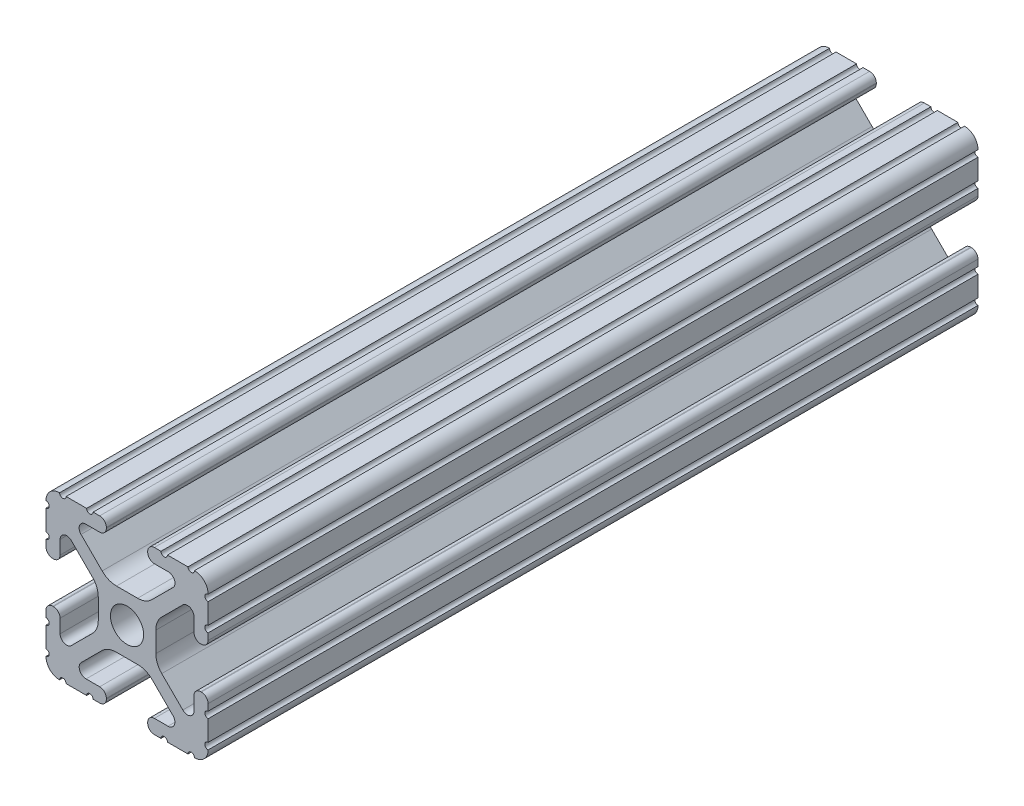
ISO-10303-21;
HEADER;
FILE_DESCRIPTION(('STEP AP214'),'2;1');
FILE_NAME('part.step','',(''),(''),'','','');
FILE_SCHEMA(('AUTOMOTIVE_DESIGN { 1 0 10303 214 1 1 1 1 }'));
ENDSEC;
DATA;
#1=APPLICATION_CONTEXT('core data for automotive mechanical design processes');
#2=APPLICATION_PROTOCOL_DEFINITION('international standard','automotive_design',2000,#1);
#3=PRODUCT_CONTEXT('',#1,'mechanical');
#4=PRODUCT('Part','Part','',(#3));
#5=PRODUCT_RELATED_PRODUCT_CATEGORY('part','',(#4));
#6=PRODUCT_DEFINITION_FORMATION('','',#4);
#7=PRODUCT_DEFINITION_CONTEXT('part definition',#1,'design');
#8=PRODUCT_DEFINITION('design','',#6,#7);
#9=PRODUCT_DEFINITION_SHAPE('','',#8);
#10=(LENGTH_UNIT() NAMED_UNIT(*) SI_UNIT(.MILLI.,.METRE.));
#11=(NAMED_UNIT(*) PLANE_ANGLE_UNIT() SI_UNIT($,.RADIAN.));
#12=(NAMED_UNIT(*) SI_UNIT($,.STERADIAN.) SOLID_ANGLE_UNIT());
#13=UNCERTAINTY_MEASURE_WITH_UNIT(LENGTH_MEASURE(1.E-05),#10,'distance_accuracy_value','');
#14=(GEOMETRIC_REPRESENTATION_CONTEXT(3) GLOBAL_UNCERTAINTY_ASSIGNED_CONTEXT((#13)) GLOBAL_UNIT_ASSIGNED_CONTEXT((#10,
#11,#12)) REPRESENTATION_CONTEXT('',''));
#15=CARTESIAN_POINT('',(0.,0.,0.));
#16=DIRECTION('',(0.,0.,1.));
#17=DIRECTION('',(1.,0.,0.));
#18=AXIS2_PLACEMENT_3D('',#15,#16,#17);
#19=CARTESIAN_POINT('',(-6.41640832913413,-9.40982735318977,60.325));
#20=DIRECTION('',(0.,0.,1.));
#21=DIRECTION('',(1.,0.,0.));
#22=AXIS2_PLACEMENT_3D('',#19,#20,#21);
#23=PLANE('',#22);
#24=CARTESIAN_POINT('',(-6.41640832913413,-9.40982735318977,60.325));
#25=DIRECTION('',(0.,0.,-1.));
#26=DIRECTION('',(1.,0.,0.));
#27=AXIS2_PLACEMENT_3D('',#24,#25,#26);
#28=CIRCLE('',#27,1.08037264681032);
#29=CARTESIAN_POINT('',(-6.41640832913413,-10.4902000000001,60.325));
#30=VERTEX_POINT('',#29);
#31=CARTESIAN_POINT('',(-7.17965049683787,-8.64519250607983,60.325));
#32=VERTEX_POINT('',#31);
#33=EDGE_CURVE('E848',#30,#32,#28,.T.);
#34=ORIENTED_EDGE('',*,*,#33,.T.);
#35=DIRECTION('',(0.707751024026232,0.706461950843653,0.));
#36=VECTOR('',#35,1.);
#37=CARTESIAN_POINT('',(-7.17965049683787,-8.64519250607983,60.325));
#38=LINE('',#37,#36);
#39=CARTESIAN_POINT('',(-3.95227025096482,-5.42369049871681,60.325));
#40=VERTEX_POINT('',#39);
#41=EDGE_CURVE('E356',#32,#40,#38,.T.);
#42=ORIENTED_EDGE('',*,*,#41,.T.);
#43=CARTESIAN_POINT('',(-1.70925355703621,-7.67080000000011,60.325));
#44=DIRECTION('',(0.,0.,-1.));
#45=DIRECTION('',(1.,0.,0.));
#46=AXIS2_PLACEMENT_3D('',#43,#44,#45);
#47=CIRCLE('',#46,3.17500000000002);
#48=CARTESIAN_POINT('',(-1.70925355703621,-4.49580000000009,60.325));
#49=VERTEX_POINT('',#48);
#50=EDGE_CURVE('E1127',#40,#49,#47,.T.);
#51=ORIENTED_EDGE('',*,*,#50,.T.);
#52=DIRECTION('',(1.,0.,0.));
#53=VECTOR('',#52,1.);
#54=CARTESIAN_POINT('',(-1.70925355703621,-4.49580000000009,60.325));
#55=LINE('',#54,#53);
#56=CARTESIAN_POINT('',(1.70925355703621,-4.49580000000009,60.325));
#57=VERTEX_POINT('',#56);
#58=EDGE_CURVE('E1146',#49,#57,#55,.T.);
#59=ORIENTED_EDGE('',*,*,#58,.T.);
#60=CARTESIAN_POINT('',(1.70925355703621,-7.67080000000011,60.325));
#61=DIRECTION('',(0.,0.,-1.));
#62=DIRECTION('',(1.,0.,0.));
#63=AXIS2_PLACEMENT_3D('',#60,#61,#62);
#64=CIRCLE('',#63,3.17500000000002);
#65=CARTESIAN_POINT('',(3.95227025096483,-5.42369049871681,60.325));
#66=VERTEX_POINT('',#65);
#67=EDGE_CURVE('E1143',#57,#66,#64,.T.);
#68=ORIENTED_EDGE('',*,*,#67,.T.);
#69=DIRECTION('',(0.707751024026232,-0.706461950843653,0.));
#70=VECTOR('',#69,1.);
#71=CARTESIAN_POINT('',(3.95227025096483,-5.42369049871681,60.325));
#72=LINE('',#71,#70);
#73=CARTESIAN_POINT('',(7.17965049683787,-8.64519250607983,60.325));
#74=VERTEX_POINT('',#73);
#75=EDGE_CURVE('E1145',#66,#74,#72,.T.);
#76=ORIENTED_EDGE('',*,*,#75,.T.);
#77=CARTESIAN_POINT('',(6.41640832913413,-9.40982735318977,60.325));
#78=DIRECTION('',(0.,0.,-1.));
#79=DIRECTION('',(1.,0.,0.));
#80=AXIS2_PLACEMENT_3D('',#77,#78,#79);
#81=CIRCLE('',#80,1.08037264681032);
#82=CARTESIAN_POINT('',(6.41640832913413,-10.4902000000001,60.325));
#83=VERTEX_POINT('',#82);
#84=EDGE_CURVE('E1148',#74,#83,#81,.T.);
#85=ORIENTED_EDGE('',*,*,#84,.T.);
#86=DIRECTION('',(-1.,0.,0.));
#87=VECTOR('',#86,1.);
#88=CARTESIAN_POINT('',(6.41640832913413,-10.4902000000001,60.325));
#89=LINE('',#88,#87);
#90=CARTESIAN_POINT('',(4.2875124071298,-10.4902000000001,60.325));
#91=VERTEX_POINT('',#90);
#92=EDGE_CURVE('E1154',#83,#91,#89,.T.);
#93=ORIENTED_EDGE('',*,*,#92,.T.);
#94=CARTESIAN_POINT('',(4.2875124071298,-11.5392124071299,60.325));
#95=DIRECTION('',(0.,0.,1.));
#96=DIRECTION('',(1.,0.,0.));
#97=AXIS2_PLACEMENT_3D('',#94,#95,#96);
#98=CIRCLE('',#97,1.04901240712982);
#99=CARTESIAN_POINT('',(3.23849999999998,-11.5392124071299,60.325));
#100=VERTEX_POINT('',#99);
#101=EDGE_CURVE('E1156',#91,#100,#98,.T.);
#102=ORIENTED_EDGE('',*,*,#101,.T.);
#103=DIRECTION('',(0.,-1.,0.));
#104=VECTOR('',#103,1.);
#105=CARTESIAN_POINT('',(3.23849999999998,-11.5392124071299,60.325));
#106=LINE('',#105,#104);
#107=CARTESIAN_POINT('',(3.23849999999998,-11.6509875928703,60.325));
#108=VERTEX_POINT('',#107);
#109=EDGE_CURVE('E1158',#100,#108,#106,.T.);
#110=ORIENTED_EDGE('',*,*,#109,.T.);
#111=CARTESIAN_POINT('',(4.2875124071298,-11.6509875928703,60.325));
#112=DIRECTION('',(0.,0.,1.));
#113=DIRECTION('',(1.,0.,0.));
#114=AXIS2_PLACEMENT_3D('',#111,#112,#113);
#115=CIRCLE('',#114,1.04901240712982);
#116=CARTESIAN_POINT('',(4.2875124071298,-12.7000000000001,60.325));
#117=VERTEX_POINT('',#116);
#118=EDGE_CURVE('E1160',#108,#117,#115,.T.);
#119=ORIENTED_EDGE('',*,*,#118,.T.);
#120=DIRECTION('',(1.,0.,0.));
#121=VECTOR('',#120,1.);
#122=CARTESIAN_POINT('',(4.2875124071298,-12.7000000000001,60.325));
#123=LINE('',#122,#121);
#124=CARTESIAN_POINT('',(5.31712671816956,-12.7000000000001,60.325));
#125=VERTEX_POINT('',#124);
#126=EDGE_CURVE('E1162',#117,#125,#123,.T.);
#127=ORIENTED_EDGE('',*,*,#126,.T.);
#128=CARTESIAN_POINT('',(5.82512671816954,-12.7000000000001,60.325));
#129=DIRECTION('',(0.,0.,-1.));
#130=DIRECTION('',(1.,0.,0.));
#131=AXIS2_PLACEMENT_3D('',#128,#129,#130);
#132=CIRCLE('',#131,0.507999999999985);
#133=CARTESIAN_POINT('',(6.33312671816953,-12.7000000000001,60.325));
#134=VERTEX_POINT('',#133);
#135=EDGE_CURVE('E1164',#125,#134,#132,.T.);
#136=ORIENTED_EDGE('',*,*,#135,.T.);
#137=DIRECTION('',(1.,0.,0.));
#138=VECTOR('',#137,1.);
#139=CARTESIAN_POINT('',(6.33312671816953,-12.7000000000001,60.325));
#140=LINE('',#139,#138);
#141=CARTESIAN_POINT('',(9.55044311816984,-12.7000000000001,60.325));
#142=VERTEX_POINT('',#141);
#143=EDGE_CURVE('E1166',#134,#142,#140,.T.);
#144=ORIENTED_EDGE('',*,*,#143,.T.);
#145=CARTESIAN_POINT('',(10.0584431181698,-12.7000000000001,60.325));
#146=DIRECTION('',(0.,0.,-1.));
#147=DIRECTION('',(1.,0.,0.));
#148=AXIS2_PLACEMENT_3D('',#145,#146,#147);
#149=CIRCLE('',#148,0.507999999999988);
#150=CARTESIAN_POINT('',(10.5664430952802,-12.6998475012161,60.325));
#151=VERTEX_POINT('',#150);
#152=EDGE_CURVE('E1168',#142,#151,#149,.T.);
#153=ORIENTED_EDGE('',*,*,#152,.T.);
#154=CARTESIAN_POINT('',(10.5918000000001,-10.5918000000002,60.325));
#155=DIRECTION('',(0.,0.,1.));
#156=DIRECTION('',(1.,0.,0.));
#157=AXIS2_PLACEMENT_3D('',#154,#155,#156);
#158=CIRCLE('',#157,2.1081999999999);
#159=CARTESIAN_POINT('',(12.699846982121,-10.5663999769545,60.325));
#160=VERTEX_POINT('',#159);
#161=EDGE_CURVE('E1170',#151,#160,#158,.T.);
#162=ORIENTED_EDGE('',*,*,#161,.T.);
#163=CARTESIAN_POINT('',(12.7,-10.0584000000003,60.325));
#164=DIRECTION('',(0.,0.,-1.));
#165=DIRECTION('',(1.,0.,0.));
#166=AXIS2_PLACEMENT_3D('',#163,#164,#165);
#167=CIRCLE('',#166,0.507999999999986);
#168=CARTESIAN_POINT('',(12.7,-9.5504000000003,60.325));
#169=VERTEX_POINT('',#168);
#170=EDGE_CURVE('E1172',#160,#169,#167,.T.);
#171=ORIENTED_EDGE('',*,*,#170,.T.);
#172=DIRECTION('',(0.,1.,0.));
#173=VECTOR('',#172,1.);
#174=CARTESIAN_POINT('',(12.7,-9.5504000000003,60.325));
#175=LINE('',#174,#173);
#176=CARTESIAN_POINT('',(12.7,-6.33308359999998,60.325));
#177=VERTEX_POINT('',#176);
#178=EDGE_CURVE('E1174',#169,#177,#175,.T.);
#179=ORIENTED_EDGE('',*,*,#178,.T.);
#180=CARTESIAN_POINT('',(12.7,-5.8250836,60.325));
#181=DIRECTION('',(0.,0.,-1.));
#182=DIRECTION('',(1.,0.,0.));
#183=AXIS2_PLACEMENT_3D('',#180,#181,#182);
#184=CIRCLE('',#183,0.507999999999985);
#185=CARTESIAN_POINT('',(12.7,-5.31708360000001,60.325));
#186=VERTEX_POINT('',#185);
#187=EDGE_CURVE('E1176',#177,#186,#184,.T.);
#188=ORIENTED_EDGE('',*,*,#187,.T.);
#189=DIRECTION('',(0.,1.,0.));
#190=VECTOR('',#189,1.);
#191=CARTESIAN_POINT('',(12.7,-5.31708360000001,60.325));
#192=LINE('',#191,#190);
#193=CARTESIAN_POINT('',(12.7,-4.28746928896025,60.325));
#194=VERTEX_POINT('',#193);
#195=EDGE_CURVE('E1178',#186,#194,#192,.T.);
#196=ORIENTED_EDGE('',*,*,#195,.T.);
#197=CARTESIAN_POINT('',(11.6509875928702,-4.28746928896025,60.325));
#198=DIRECTION('',(0.,0.,1.));
#199=DIRECTION('',(1.,0.,0.));
#200=AXIS2_PLACEMENT_3D('',#197,#198,#199);
#201=CIRCLE('',#200,1.04901240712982);
#202=CARTESIAN_POINT('',(11.6509875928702,-3.23845688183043,60.325));
#203=VERTEX_POINT('',#202);
#204=EDGE_CURVE('E1180',#194,#203,#201,.T.);
#205=ORIENTED_EDGE('',*,*,#204,.T.);
#206=DIRECTION('',(-1.,0.,0.));
#207=VECTOR('',#206,1.);
#208=CARTESIAN_POINT('',(11.6509875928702,-3.23845688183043,60.325));
#209=LINE('',#208,#207);
#210=CARTESIAN_POINT('',(11.5392124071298,-3.23845688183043,60.325));
#211=VERTEX_POINT('',#210);
#212=EDGE_CURVE('E1182',#203,#211,#209,.T.);
#213=ORIENTED_EDGE('',*,*,#212,.T.);
#214=CARTESIAN_POINT('',(11.5392124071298,-4.28746928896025,60.325));
#215=DIRECTION('',(0.,0.,1.));
#216=DIRECTION('',(1.,0.,0.));
#217=AXIS2_PLACEMENT_3D('',#214,#215,#216);
#218=CIRCLE('',#217,1.04901240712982);
#219=CARTESIAN_POINT('',(10.4902,-4.28746928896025,60.325));
#220=VERTEX_POINT('',#219);
#221=EDGE_CURVE('E1184',#211,#220,#218,.T.);
#222=ORIENTED_EDGE('',*,*,#221,.T.);
#223=DIRECTION('',(0.,-1.,0.));
#224=VECTOR('',#223,1.);
#225=CARTESIAN_POINT('',(10.4902,-4.28746928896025,60.325));
#226=LINE('',#225,#224);
#227=CARTESIAN_POINT('',(10.4902,-6.4020890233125,60.325));
#228=VERTEX_POINT('',#227);
#229=EDGE_CURVE('E1186',#220,#228,#226,.T.);
#230=ORIENTED_EDGE('',*,*,#229,.T.);
#231=CARTESIAN_POINT('',(9.4627890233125,-6.4020890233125,60.325));
#232=DIRECTION('',(0.,0.,-1.));
#233=DIRECTION('',(1.,0.,0.));
#234=AXIS2_PLACEMENT_3D('',#231,#232,#233);
#235=CIRCLE('',#234,1.0274109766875);
#236=CARTESIAN_POINT('',(8.7371313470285,-7.12940893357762,60.325));
#237=VERTEX_POINT('',#236);
#238=EDGE_CURVE('E1188',#228,#237,#235,.T.);
#239=ORIENTED_EDGE('',*,*,#238,.T.);
#240=DIRECTION('',(-0.70791526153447,0.706297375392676,0.));
#241=VECTOR('',#240,1.);
#242=CARTESIAN_POINT('',(8.7371313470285,-7.12940893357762,60.325));
#243=LINE('',#242,#241);
#244=CARTESIAN_POINT('',(5.44100583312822,-3.84081646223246,60.325));
#245=VERTEX_POINT('',#244);
#246=EDGE_CURVE('E1190',#237,#245,#243,.T.);
#247=ORIENTED_EDGE('',*,*,#246,.T.);
#248=CARTESIAN_POINT('',(7.68350000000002,-1.59318550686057,60.325));
#249=DIRECTION('',(0.,0.,-1.));
#250=DIRECTION('',(1.,0.,0.));
#251=AXIS2_PLACEMENT_3D('',#248,#249,#250);
#252=CIRCLE('',#251,3.17500000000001);
#253=CARTESIAN_POINT('',(4.50850000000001,-1.59318550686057,60.325));
#254=VERTEX_POINT('',#253);
#255=EDGE_CURVE('E1192',#245,#254,#252,.T.);
#256=ORIENTED_EDGE('',*,*,#255,.T.);
#257=DIRECTION('',(0.,1.,0.));
#258=VECTOR('',#257,1.);
#259=CARTESIAN_POINT('',(4.5085,-1.59318550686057,60.325));
#260=LINE('',#259,#258);
#261=CARTESIAN_POINT('',(4.50850000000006,1.59318550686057,60.325));
#262=VERTEX_POINT('',#261);
#263=EDGE_CURVE('E1194',#254,#262,#260,.T.);
#264=ORIENTED_EDGE('',*,*,#263,.T.);
#265=CARTESIAN_POINT('',(7.68350000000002,1.59318550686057,60.325));
#266=DIRECTION('',(0.,0.,-1.));
#267=DIRECTION('',(1.,0.,0.));
#268=AXIS2_PLACEMENT_3D('',#265,#266,#267);
#269=CIRCLE('',#268,3.17499999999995);
#270=CARTESIAN_POINT('',(5.44100583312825,3.84081646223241,60.325));
#271=VERTEX_POINT('',#270);
#272=EDGE_CURVE('E1196',#262,#271,#269,.T.);
#273=ORIENTED_EDGE('',*,*,#272,.T.);
#274=DIRECTION('',(0.70791526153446,0.706297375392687,0.));
#275=VECTOR('',#274,1.);
#276=CARTESIAN_POINT('',(5.44100583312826,3.8408164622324,60.325));
#277=LINE('',#276,#275);
#278=CARTESIAN_POINT('',(8.73713134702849,7.12940893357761,60.325));
#279=VERTEX_POINT('',#278);
#280=EDGE_CURVE('E1198',#271,#279,#277,.T.);
#281=ORIENTED_EDGE('',*,*,#280,.T.);
#282=CARTESIAN_POINT('',(9.4627890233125,6.4020890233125,60.325));
#283=DIRECTION('',(0.,0.,-1.));
#284=DIRECTION('',(1.,0.,0.));
#285=AXIS2_PLACEMENT_3D('',#282,#283,#284);
#286=CIRCLE('',#285,1.0274109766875);
#287=CARTESIAN_POINT('',(10.4902,6.4020890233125,60.325));
#288=VERTEX_POINT('',#287);
#289=EDGE_CURVE('E1200',#279,#288,#286,.T.);
#290=ORIENTED_EDGE('',*,*,#289,.T.);
#291=DIRECTION('',(0.,-1.,0.));
#292=VECTOR('',#291,1.);
#293=CARTESIAN_POINT('',(10.4902,6.4020890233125,60.325));
#294=LINE('',#293,#292);
#295=CARTESIAN_POINT('',(10.4902,4.28746928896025,60.325));
#296=VERTEX_POINT('',#295);
#297=EDGE_CURVE('E1202',#288,#296,#294,.T.);
#298=ORIENTED_EDGE('',*,*,#297,.T.);
#299=CARTESIAN_POINT('',(11.5392124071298,4.28746928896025,60.325));
#300=DIRECTION('',(0.,0.,1.));
#301=DIRECTION('',(1.,0.,0.));
#302=AXIS2_PLACEMENT_3D('',#299,#300,#301);
#303=CIRCLE('',#302,1.04901240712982);
#304=CARTESIAN_POINT('',(11.5392124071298,3.23845688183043,60.325));
#305=VERTEX_POINT('',#304);
#306=EDGE_CURVE('E1204',#296,#305,#303,.T.);
#307=ORIENTED_EDGE('',*,*,#306,.T.);
#308=DIRECTION('',(1.,0.,0.));
#309=VECTOR('',#308,1.);
#310=CARTESIAN_POINT('',(11.5392124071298,3.23845688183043,60.325));
#311=LINE('',#310,#309);
#312=CARTESIAN_POINT('',(11.6509875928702,3.23845688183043,60.325));
#313=VERTEX_POINT('',#312);
#314=EDGE_CURVE('E1206',#305,#313,#311,.T.);
#315=ORIENTED_EDGE('',*,*,#314,.T.);
#316=CARTESIAN_POINT('',(11.6509875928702,4.28746928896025,60.325));
#317=DIRECTION('',(0.,0.,1.));
#318=DIRECTION('',(1.,0.,0.));
#319=AXIS2_PLACEMENT_3D('',#316,#317,#318);
#320=CIRCLE('',#319,1.04901240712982);
#321=CARTESIAN_POINT('',(12.7,4.28746928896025,60.325));
#322=VERTEX_POINT('',#321);
#323=EDGE_CURVE('E1208',#313,#322,#320,.T.);
#324=ORIENTED_EDGE('',*,*,#323,.T.);
#325=DIRECTION('',(0.,1.,0.));
#326=VECTOR('',#325,1.);
#327=CARTESIAN_POINT('',(12.7,4.28746928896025,60.325));
#328=LINE('',#327,#326);
#329=CARTESIAN_POINT('',(12.7,5.31708360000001,60.325));
#330=VERTEX_POINT('',#329);
#331=EDGE_CURVE('E1210',#322,#330,#328,.T.);
#332=ORIENTED_EDGE('',*,*,#331,.T.);
#333=CARTESIAN_POINT('',(12.7,5.8250836,60.325));
#334=DIRECTION('',(0.,0.,-1.));
#335=DIRECTION('',(1.,0.,0.));
#336=AXIS2_PLACEMENT_3D('',#333,#334,#335);
#337=CIRCLE('',#336,0.507999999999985);
#338=CARTESIAN_POINT('',(12.7,6.33308359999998,60.325));
#339=VERTEX_POINT('',#338);
#340=EDGE_CURVE('E1212',#330,#339,#337,.T.);
#341=ORIENTED_EDGE('',*,*,#340,.T.);
#342=DIRECTION('',(0.,1.,0.));
#343=VECTOR('',#342,1.);
#344=CARTESIAN_POINT('',(12.7,6.33308359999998,60.325));
#345=LINE('',#344,#343);
#346=CARTESIAN_POINT('',(12.7,9.55040000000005,60.325));
#347=VERTEX_POINT('',#346);
#348=EDGE_CURVE('E1214',#339,#347,#345,.T.);
#349=ORIENTED_EDGE('',*,*,#348,.T.);
#350=CARTESIAN_POINT('',(12.7,10.0584000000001,60.325));
#351=DIRECTION('',(0.,0.,-1.));
#352=DIRECTION('',(1.,0.,0.));
#353=AXIS2_PLACEMENT_3D('',#350,#351,#352);
#354=CIRCLE('',#353,0.508000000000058);
#355=CARTESIAN_POINT('',(12.699846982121,10.5663999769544,60.325));
#356=VERTEX_POINT('',#355);
#357=EDGE_CURVE('E1216',#347,#356,#354,.T.);
#358=ORIENTED_EDGE('',*,*,#357,.T.);
#359=CARTESIAN_POINT('',(10.5918000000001,10.5918000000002,60.325));
#360=DIRECTION('',(0.,0.,1.));
#361=DIRECTION('',(1.,0.,0.));
#362=AXIS2_PLACEMENT_3D('',#359,#360,#361);
#363=CIRCLE('',#362,2.1081999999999);
#364=CARTESIAN_POINT('',(10.5664430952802,12.6998475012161,60.325));
#365=VERTEX_POINT('',#364);
#366=EDGE_CURVE('E1218',#356,#365,#363,.T.);
#367=ORIENTED_EDGE('',*,*,#366,.T.);
#368=CARTESIAN_POINT('',(10.0584431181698,12.7000000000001,60.325));
#369=DIRECTION('',(0.,0.,-1.));
#370=DIRECTION('',(1.,0.,0.));
#371=AXIS2_PLACEMENT_3D('',#368,#369,#370);
#372=CIRCLE('',#371,0.507999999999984);
#373=CARTESIAN_POINT('',(9.55044311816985,12.7000000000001,60.325));
#374=VERTEX_POINT('',#373);
#375=EDGE_CURVE('E1220',#365,#374,#372,.T.);
#376=ORIENTED_EDGE('',*,*,#375,.T.);
#377=DIRECTION('',(-1.,0.,0.));
#378=VECTOR('',#377,1.);
#379=CARTESIAN_POINT('',(9.55044311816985,12.7000000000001,60.325));
#380=LINE('',#379,#378);
#381=CARTESIAN_POINT('',(6.33312671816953,12.7000000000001,60.325));
#382=VERTEX_POINT('',#381);
#383=EDGE_CURVE('E1222',#374,#382,#380,.T.);
#384=ORIENTED_EDGE('',*,*,#383,.T.);
#385=CARTESIAN_POINT('',(5.82512671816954,12.7000000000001,60.325));
#386=DIRECTION('',(0.,0.,-1.));
#387=DIRECTION('',(1.,0.,0.));
#388=AXIS2_PLACEMENT_3D('',#385,#386,#387);
#389=CIRCLE('',#388,0.507999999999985);
#390=CARTESIAN_POINT('',(5.31712671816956,12.7000000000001,60.325));
#391=VERTEX_POINT('',#390);
#392=EDGE_CURVE('E1224',#382,#391,#389,.T.);
#393=ORIENTED_EDGE('',*,*,#392,.T.);
#394=DIRECTION('',(-1.,0.,0.));
#395=VECTOR('',#394,1.);
#396=CARTESIAN_POINT('',(5.31712671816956,12.7000000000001,60.325));
#397=LINE('',#396,#395);
#398=CARTESIAN_POINT('',(4.2875124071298,12.7000000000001,60.325));
#399=VERTEX_POINT('',#398);
#400=EDGE_CURVE('E1226',#391,#399,#397,.T.);
#401=ORIENTED_EDGE('',*,*,#400,.T.);
#402=CARTESIAN_POINT('',(4.2875124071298,11.6509875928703,60.325));
#403=DIRECTION('',(0.,0.,1.));
#404=DIRECTION('',(1.,0.,0.));
#405=AXIS2_PLACEMENT_3D('',#402,#403,#404);
#406=CIRCLE('',#405,1.04901240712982);
#407=CARTESIAN_POINT('',(3.23849999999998,11.6509875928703,60.325));
#408=VERTEX_POINT('',#407);
#409=EDGE_CURVE('E1228',#399,#408,#406,.T.);
#410=ORIENTED_EDGE('',*,*,#409,.T.);
#411=DIRECTION('',(0.,-1.,0.));
#412=VECTOR('',#411,1.);
#413=CARTESIAN_POINT('',(3.23849999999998,11.6509875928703,60.325));
#414=LINE('',#413,#412);
#415=CARTESIAN_POINT('',(3.23849999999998,11.5392124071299,60.325));
#416=VERTEX_POINT('',#415);
#417=EDGE_CURVE('E1230',#408,#416,#414,.T.);
#418=ORIENTED_EDGE('',*,*,#417,.T.);
#419=CARTESIAN_POINT('',(4.2875124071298,11.5392124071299,60.325));
#420=DIRECTION('',(0.,0.,1.));
#421=DIRECTION('',(1.,0.,0.));
#422=AXIS2_PLACEMENT_3D('',#419,#420,#421);
#423=CIRCLE('',#422,1.04901240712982);
#424=CARTESIAN_POINT('',(4.2875124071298,10.4902000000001,60.325));
#425=VERTEX_POINT('',#424);
#426=EDGE_CURVE('E1232',#416,#425,#423,.T.);
#427=ORIENTED_EDGE('',*,*,#426,.T.);
#428=DIRECTION('',(1.,0.,0.));
#429=VECTOR('',#428,1.);
#430=CARTESIAN_POINT('',(4.2875124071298,10.4902000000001,60.325));
#431=LINE('',#430,#429);
#432=CARTESIAN_POINT('',(6.47678859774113,10.4902000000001,60.325));
#433=VERTEX_POINT('',#432);
#434=EDGE_CURVE('E1234',#425,#433,#431,.T.);
#435=ORIENTED_EDGE('',*,*,#434,.T.);
#436=CARTESIAN_POINT('',(6.47678859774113,9.45629072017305,60.325));
#437=DIRECTION('',(0.,0.,-1.));
#438=DIRECTION('',(1.,0.,0.));
#439=AXIS2_PLACEMENT_3D('',#436,#437,#438);
#440=CIRCLE('',#439,1.03390927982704);
#441=CARTESIAN_POINT('',(7.2070360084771,8.72437056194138,60.325));
#442=VERTEX_POINT('',#441);
#443=EDGE_CURVE('E1236',#433,#442,#440,.T.);
#444=ORIENTED_EDGE('',*,*,#443,.T.);
#445=DIRECTION('',(-0.707915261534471,-0.706297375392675,0.));
#446=VECTOR('',#445,1.);
#447=CARTESIAN_POINT('',(7.2070360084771,8.72437056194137,60.325));
#448=LINE('',#447,#446);
#449=CARTESIAN_POINT('',(3.89827256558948,5.42316904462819,60.325));
#450=VERTEX_POINT('',#449);
#451=EDGE_CURVE('E1238',#442,#450,#448,.T.);
#452=ORIENTED_EDGE('',*,*,#451,.T.);
#453=CARTESIAN_POINT('',(1.65577839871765,7.67080000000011,60.325));
#454=DIRECTION('',(0.,0.,-1.));
#455=DIRECTION('',(1.,0.,0.));
#456=AXIS2_PLACEMENT_3D('',#453,#454,#455);
#457=CIRCLE('',#456,3.17500000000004);
#458=CARTESIAN_POINT('',(1.65577839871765,4.49580000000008,60.325));
#459=VERTEX_POINT('',#458);
#460=EDGE_CURVE('E1240',#450,#459,#457,.T.);
#461=ORIENTED_EDGE('',*,*,#460,.T.);
#462=DIRECTION('',(-1.,0.,0.));
#463=VECTOR('',#462,1.);
#464=CARTESIAN_POINT('',(1.65577839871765,4.49580000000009,60.325));
#465=LINE('',#464,#463);
#466=CARTESIAN_POINT('',(-1.65577839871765,4.49580000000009,60.325));
#467=VERTEX_POINT('',#466);
#468=EDGE_CURVE('E1242',#459,#467,#465,.T.);
#469=ORIENTED_EDGE('',*,*,#468,.T.);
#470=CARTESIAN_POINT('',(-1.65577839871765,7.67080000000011,60.325));
#471=DIRECTION('',(0.,0.,-1.));
#472=DIRECTION('',(1.,0.,0.));
#473=AXIS2_PLACEMENT_3D('',#470,#471,#472);
#474=CIRCLE('',#473,3.17500000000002);
#475=CARTESIAN_POINT('',(-3.89827256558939,5.42316904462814,60.325));
#476=VERTEX_POINT('',#475);
#477=EDGE_CURVE('E1244',#467,#476,#474,.T.);
#478=ORIENTED_EDGE('',*,*,#477,.T.);
#479=DIRECTION('',(-0.707915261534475,0.706297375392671,0.));
#480=VECTOR('',#479,1.);
#481=CARTESIAN_POINT('',(-3.89827256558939,5.42316904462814,60.325));
#482=LINE('',#481,#480);
#483=CARTESIAN_POINT('',(-7.20703600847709,8.72437056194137,60.325));
#484=VERTEX_POINT('',#483);
#485=EDGE_CURVE('E1246',#476,#484,#482,.T.);
#486=ORIENTED_EDGE('',*,*,#485,.T.);
#487=CARTESIAN_POINT('',(-6.47678859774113,9.45629072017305,60.325));
#488=DIRECTION('',(0.,0.,-1.));
#489=DIRECTION('',(1.,0.,0.));
#490=AXIS2_PLACEMENT_3D('',#487,#488,#489);
#491=CIRCLE('',#490,1.03390927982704);
#492=CARTESIAN_POINT('',(-6.47678859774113,10.4902000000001,60.325));
#493=VERTEX_POINT('',#492);
#494=EDGE_CURVE('E1248',#484,#493,#491,.T.);
#495=ORIENTED_EDGE('',*,*,#494,.T.);
#496=DIRECTION('',(1.,0.,0.));
#497=VECTOR('',#496,1.);
#498=CARTESIAN_POINT('',(-6.47678859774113,10.4902000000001,60.325));
#499=LINE('',#498,#497);
#500=CARTESIAN_POINT('',(-4.2875124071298,10.4902000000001,60.325));
#501=VERTEX_POINT('',#500);
#502=EDGE_CURVE('E1250',#493,#501,#499,.T.);
#503=ORIENTED_EDGE('',*,*,#502,.T.);
#504=CARTESIAN_POINT('',(-4.2875124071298,11.5392124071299,60.325));
#505=DIRECTION('',(0.,0.,1.));
#506=DIRECTION('',(1.,0.,0.));
#507=AXIS2_PLACEMENT_3D('',#504,#505,#506);
#508=CIRCLE('',#507,1.04901240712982);
#509=CARTESIAN_POINT('',(-3.23849999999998,11.5392124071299,60.325));
#510=VERTEX_POINT('',#509);
#511=EDGE_CURVE('E1252',#501,#510,#508,.T.);
#512=ORIENTED_EDGE('',*,*,#511,.T.);
#513=DIRECTION('',(0.,1.,0.));
#514=VECTOR('',#513,1.);
#515=CARTESIAN_POINT('',(-3.23849999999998,11.5392124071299,60.325));
#516=LINE('',#515,#514);
#517=CARTESIAN_POINT('',(-3.23849999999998,11.6509875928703,60.325));
#518=VERTEX_POINT('',#517);
#519=EDGE_CURVE('E1254',#510,#518,#516,.T.);
#520=ORIENTED_EDGE('',*,*,#519,.T.);
#521=CARTESIAN_POINT('',(-4.2875124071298,11.6509875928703,60.325));
#522=DIRECTION('',(0.,0.,1.));
#523=DIRECTION('',(1.,0.,0.));
#524=AXIS2_PLACEMENT_3D('',#521,#522,#523);
#525=CIRCLE('',#524,1.04901240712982);
#526=CARTESIAN_POINT('',(-4.2875124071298,12.7000000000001,60.325));
#527=VERTEX_POINT('',#526);
#528=EDGE_CURVE('E1256',#518,#527,#525,.T.);
#529=ORIENTED_EDGE('',*,*,#528,.T.);
#530=DIRECTION('',(-1.,0.,0.));
#531=VECTOR('',#530,1.);
#532=CARTESIAN_POINT('',(-4.2875124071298,12.7000000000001,60.325));
#533=LINE('',#532,#531);
#534=CARTESIAN_POINT('',(-5.31712671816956,12.7000000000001,60.325));
#535=VERTEX_POINT('',#534);
#536=EDGE_CURVE('E1258',#527,#535,#533,.T.);
#537=ORIENTED_EDGE('',*,*,#536,.T.);
#538=CARTESIAN_POINT('',(-5.82512671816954,12.7000000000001,60.325));
#539=DIRECTION('',(0.,0.,-1.));
#540=DIRECTION('',(1.,0.,0.));
#541=AXIS2_PLACEMENT_3D('',#538,#539,#540);
#542=CIRCLE('',#541,0.507999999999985);
#543=CARTESIAN_POINT('',(-6.33312671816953,12.7000000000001,60.325));
#544=VERTEX_POINT('',#543);
#545=EDGE_CURVE('E1260',#535,#544,#542,.T.);
#546=ORIENTED_EDGE('',*,*,#545,.T.);
#547=DIRECTION('',(-1.,0.,0.));
#548=VECTOR('',#547,1.);
#549=CARTESIAN_POINT('',(-6.33312671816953,12.7000000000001,60.325));
#550=LINE('',#549,#548);
#551=CARTESIAN_POINT('',(-9.55044311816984,12.7000000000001,60.325));
#552=VERTEX_POINT('',#551);
#553=EDGE_CURVE('E1262',#544,#552,#550,.T.);
#554=ORIENTED_EDGE('',*,*,#553,.T.);
#555=CARTESIAN_POINT('',(-10.0584431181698,12.7000000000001,60.325));
#556=DIRECTION('',(0.,0.,-1.));
#557=DIRECTION('',(1.,0.,0.));
#558=AXIS2_PLACEMENT_3D('',#555,#556,#557);
#559=CIRCLE('',#558,0.507999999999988);
#560=CARTESIAN_POINT('',(-10.5664430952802,12.6998475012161,60.325));
#561=VERTEX_POINT('',#560);
#562=EDGE_CURVE('E1264',#552,#561,#559,.T.);
#563=ORIENTED_EDGE('',*,*,#562,.T.);
#564=CARTESIAN_POINT('',(-10.5918000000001,10.5918000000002,60.325));
#565=DIRECTION('',(0.,0.,1.));
#566=DIRECTION('',(1.,0.,0.));
#567=AXIS2_PLACEMENT_3D('',#564,#565,#566);
#568=CIRCLE('',#567,2.1081999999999);
#569=CARTESIAN_POINT('',(-12.699846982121,10.5663999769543,60.325));
#570=VERTEX_POINT('',#569);
#571=EDGE_CURVE('E1266',#561,#570,#568,.T.);
#572=ORIENTED_EDGE('',*,*,#571,.T.);
#573=CARTESIAN_POINT('',(-12.7,10.0584000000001,60.325));
#574=DIRECTION('',(0.,0.,-1.));
#575=DIRECTION('',(1.,0.,0.));
#576=AXIS2_PLACEMENT_3D('',#573,#574,#575);
#577=CIRCLE('',#576,0.50799999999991);
#578=CARTESIAN_POINT('',(-12.7,9.55040000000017,60.325));
#579=VERTEX_POINT('',#578);
#580=EDGE_CURVE('E1268',#570,#579,#577,.T.);
#581=ORIENTED_EDGE('',*,*,#580,.T.);
#582=DIRECTION('',(0.,-1.,0.));
#583=VECTOR('',#582,1.);
#584=CARTESIAN_POINT('',(-12.7,9.5504000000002,60.325));
#585=LINE('',#584,#583);
#586=CARTESIAN_POINT('',(-12.7,6.33308359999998,60.325));
#587=VERTEX_POINT('',#586);
#588=EDGE_CURVE('E1270',#579,#587,#585,.T.);
#589=ORIENTED_EDGE('',*,*,#588,.T.);
#590=CARTESIAN_POINT('',(-12.7,5.8250836,60.325));
#591=DIRECTION('',(0.,0.,-1.));
#592=DIRECTION('',(1.,0.,0.));
#593=AXIS2_PLACEMENT_3D('',#590,#591,#592);
#594=CIRCLE('',#593,0.507999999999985);
#595=CARTESIAN_POINT('',(-12.7,5.31708360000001,60.325));
#596=VERTEX_POINT('',#595);
#597=EDGE_CURVE('E1272',#587,#596,#594,.T.);
#598=ORIENTED_EDGE('',*,*,#597,.T.);
#599=DIRECTION('',(0.,-1.,0.));
#600=VECTOR('',#599,1.);
#601=CARTESIAN_POINT('',(-12.7,5.31708360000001,60.325));
#602=LINE('',#601,#600);
#603=CARTESIAN_POINT('',(-12.7,4.28746928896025,60.325));
#604=VERTEX_POINT('',#603);
#605=EDGE_CURVE('E1274',#596,#604,#602,.T.);
#606=ORIENTED_EDGE('',*,*,#605,.T.);
#607=CARTESIAN_POINT('',(-11.6509875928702,4.28746928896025,60.325));
#608=DIRECTION('',(0.,0.,1.));
#609=DIRECTION('',(1.,0.,0.));
#610=AXIS2_PLACEMENT_3D('',#607,#608,#609);
#611=CIRCLE('',#610,1.04901240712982);
#612=CARTESIAN_POINT('',(-11.6509875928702,3.23845688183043,60.325));
#613=VERTEX_POINT('',#612);
#614=EDGE_CURVE('E1276',#604,#613,#611,.T.);
#615=ORIENTED_EDGE('',*,*,#614,.T.);
#616=DIRECTION('',(1.,0.,0.));
#617=VECTOR('',#616,1.);
#618=CARTESIAN_POINT('',(-11.6509875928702,3.23845688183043,60.325));
#619=LINE('',#618,#617);
#620=CARTESIAN_POINT('',(-11.5392124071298,3.23845688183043,60.325));
#621=VERTEX_POINT('',#620);
#622=EDGE_CURVE('E1278',#613,#621,#619,.T.);
#623=ORIENTED_EDGE('',*,*,#622,.T.);
#624=CARTESIAN_POINT('',(-11.5392124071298,4.28746928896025,60.325));
#625=DIRECTION('',(0.,0.,1.));
#626=DIRECTION('',(1.,0.,0.));
#627=AXIS2_PLACEMENT_3D('',#624,#625,#626);
#628=CIRCLE('',#627,1.04901240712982);
#629=CARTESIAN_POINT('',(-10.4902,4.28746928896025,60.325));
#630=VERTEX_POINT('',#629);
#631=EDGE_CURVE('E1280',#621,#630,#628,.T.);
#632=ORIENTED_EDGE('',*,*,#631,.T.);
#633=DIRECTION('',(0.,1.,0.));
#634=VECTOR('',#633,1.);
#635=CARTESIAN_POINT('',(-10.4902,4.28746928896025,60.325));
#636=LINE('',#635,#634);
#637=CARTESIAN_POINT('',(-10.4902,6.4020890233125,60.325));
#638=VERTEX_POINT('',#637);
#639=EDGE_CURVE('E1282',#630,#638,#636,.T.);
#640=ORIENTED_EDGE('',*,*,#639,.T.);
#641=CARTESIAN_POINT('',(-9.4627890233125,6.4020890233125,60.325));
#642=DIRECTION('',(0.,0.,-1.));
#643=DIRECTION('',(1.,0.,0.));
#644=AXIS2_PLACEMENT_3D('',#641,#642,#643);
#645=CIRCLE('',#644,1.0274109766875);
#646=CARTESIAN_POINT('',(-8.73713134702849,7.12940893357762,60.325));
#647=VERTEX_POINT('',#646);
#648=EDGE_CURVE('E1284',#638,#647,#645,.T.);
#649=ORIENTED_EDGE('',*,*,#648,.T.);
#650=DIRECTION('',(0.707915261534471,-0.706297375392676,0.));
#651=VECTOR('',#650,1.);
#652=CARTESIAN_POINT('',(-8.73713134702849,7.12940893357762,60.325));
#653=LINE('',#652,#651);
#654=CARTESIAN_POINT('',(-5.44100583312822,3.84081646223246,60.325));
#655=VERTEX_POINT('',#654);
#656=EDGE_CURVE('E1286',#647,#655,#653,.T.);
#657=ORIENTED_EDGE('',*,*,#656,.T.);
#658=CARTESIAN_POINT('',(-7.68350000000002,1.59318550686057,60.325));
#659=DIRECTION('',(0.,0.,-1.));
#660=DIRECTION('',(1.,0.,0.));
#661=AXIS2_PLACEMENT_3D('',#658,#659,#660);
#662=CIRCLE('',#661,3.17500000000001);
#663=CARTESIAN_POINT('',(-4.50850000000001,1.59318550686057,60.325));
#664=VERTEX_POINT('',#663);
#665=EDGE_CURVE('E1288',#655,#664,#662,.T.);
#666=ORIENTED_EDGE('',*,*,#665,.T.);
#667=DIRECTION('',(0.,-1.,0.));
#668=VECTOR('',#667,1.);
#669=CARTESIAN_POINT('',(-4.5085,1.59318550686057,60.325));
#670=LINE('',#669,#668);
#671=CARTESIAN_POINT('',(-4.5085,-1.59318550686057,60.325));
#672=VERTEX_POINT('',#671);
#673=EDGE_CURVE('E1290',#664,#672,#670,.T.);
#674=ORIENTED_EDGE('',*,*,#673,.T.);
#675=CARTESIAN_POINT('',(-7.68350000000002,-1.59318550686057,60.325));
#676=DIRECTION('',(0.,0.,-1.));
#677=DIRECTION('',(1.,0.,0.));
#678=AXIS2_PLACEMENT_3D('',#675,#676,#677);
#679=CIRCLE('',#678,3.17500000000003);
#680=CARTESIAN_POINT('',(-5.44100583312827,-3.84081646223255,60.325));
#681=VERTEX_POINT('',#680);
#682=EDGE_CURVE('E1292',#672,#681,#679,.T.);
#683=ORIENTED_EDGE('',*,*,#682,.T.);
#684=DIRECTION('',(-0.707915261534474,-0.706297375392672,0.));
#685=VECTOR('',#684,1.);
#686=CARTESIAN_POINT('',(-5.44100583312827,-3.84081646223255,60.325));
#687=LINE('',#686,#685);
#688=CARTESIAN_POINT('',(-8.7371313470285,-7.12940893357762,60.325));
#689=VERTEX_POINT('',#688);
#690=EDGE_CURVE('E1294',#681,#689,#687,.T.);
#691=ORIENTED_EDGE('',*,*,#690,.T.);
#692=CARTESIAN_POINT('',(-9.4627890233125,-6.4020890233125,60.325));
#693=DIRECTION('',(0.,0.,-1.));
#694=DIRECTION('',(1.,0.,0.));
#695=AXIS2_PLACEMENT_3D('',#692,#693,#694);
#696=CIRCLE('',#695,1.0274109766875);
#697=CARTESIAN_POINT('',(-10.4902,-6.4020890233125,60.325));
#698=VERTEX_POINT('',#697);
#699=EDGE_CURVE('E1296',#689,#698,#696,.T.);
#700=ORIENTED_EDGE('',*,*,#699,.T.);
#701=DIRECTION('',(0.,1.,0.));
#702=VECTOR('',#701,1.);
#703=CARTESIAN_POINT('',(-10.4902,-6.4020890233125,60.325));
#704=LINE('',#703,#702);
#705=CARTESIAN_POINT('',(-10.4902,-4.28746928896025,60.325));
#706=VERTEX_POINT('',#705);
#707=EDGE_CURVE('E1298',#698,#706,#704,.T.);
#708=ORIENTED_EDGE('',*,*,#707,.T.);
#709=CARTESIAN_POINT('',(-11.5392124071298,-4.28746928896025,60.325));
#710=DIRECTION('',(0.,0.,1.));
#711=DIRECTION('',(1.,0.,0.));
#712=AXIS2_PLACEMENT_3D('',#709,#710,#711);
#713=CIRCLE('',#712,1.04901240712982);
#714=CARTESIAN_POINT('',(-11.5392124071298,-3.23845688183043,60.325));
#715=VERTEX_POINT('',#714);
#716=EDGE_CURVE('E1300',#706,#715,#713,.T.);
#717=ORIENTED_EDGE('',*,*,#716,.T.);
#718=DIRECTION('',(-1.,0.,0.));
#719=VECTOR('',#718,1.);
#720=CARTESIAN_POINT('',(-11.5392124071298,-3.23845688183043,60.325));
#721=LINE('',#720,#719);
#722=CARTESIAN_POINT('',(-11.6509875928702,-3.23845688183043,60.325));
#723=VERTEX_POINT('',#722);
#724=EDGE_CURVE('E1302',#715,#723,#721,.T.);
#725=ORIENTED_EDGE('',*,*,#724,.T.);
#726=CARTESIAN_POINT('',(-11.6509875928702,-4.28746928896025,60.325));
#727=DIRECTION('',(0.,0.,1.));
#728=DIRECTION('',(1.,0.,0.));
#729=AXIS2_PLACEMENT_3D('',#726,#727,#728);
#730=CIRCLE('',#729,1.04901240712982);
#731=CARTESIAN_POINT('',(-12.7,-4.28746928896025,60.325));
#732=VERTEX_POINT('',#731);
#733=EDGE_CURVE('E1304',#723,#732,#730,.T.);
#734=ORIENTED_EDGE('',*,*,#733,.T.);
#735=DIRECTION('',(0.,-1.,0.));
#736=VECTOR('',#735,1.);
#737=CARTESIAN_POINT('',(-12.7,-4.28746928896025,60.325));
#738=LINE('',#737,#736);
#739=CARTESIAN_POINT('',(-12.7,-5.31708360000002,60.325));
#740=VERTEX_POINT('',#739);
#741=EDGE_CURVE('E1306',#732,#740,#738,.T.);
#742=ORIENTED_EDGE('',*,*,#741,.T.);
#743=CARTESIAN_POINT('',(-12.7,-5.8250836,60.325));
#744=DIRECTION('',(0.,0.,-1.));
#745=DIRECTION('',(1.,0.,0.));
#746=AXIS2_PLACEMENT_3D('',#743,#744,#745);
#747=CIRCLE('',#746,0.507999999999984);
#748=CARTESIAN_POINT('',(-12.7,-6.33308359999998,60.325));
#749=VERTEX_POINT('',#748);
#750=EDGE_CURVE('E1308',#740,#749,#747,.T.);
#751=ORIENTED_EDGE('',*,*,#750,.T.);
#752=DIRECTION('',(0.,-1.,0.));
#753=VECTOR('',#752,1.);
#754=CARTESIAN_POINT('',(-12.7,-6.33308359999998,60.325));
#755=LINE('',#754,#753);
#756=CARTESIAN_POINT('',(-12.7,-9.5504000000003,60.325));
#757=VERTEX_POINT('',#756);
#758=EDGE_CURVE('E1310',#749,#757,#755,.T.);
#759=ORIENTED_EDGE('',*,*,#758,.T.);
#760=CARTESIAN_POINT('',(-12.7,-10.0584000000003,60.325));
#761=DIRECTION('',(0.,0.,-1.));
#762=DIRECTION('',(1.,0.,0.));
#763=AXIS2_PLACEMENT_3D('',#760,#761,#762);
#764=CIRCLE('',#763,0.507999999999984);
#765=CARTESIAN_POINT('',(-12.699846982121,-10.5663999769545,60.325));
#766=VERTEX_POINT('',#765);
#767=EDGE_CURVE('E1312',#757,#766,#764,.T.);
#768=ORIENTED_EDGE('',*,*,#767,.T.);
#769=CARTESIAN_POINT('',(-10.5918000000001,-10.5918000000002,60.325));
#770=DIRECTION('',(0.,0.,1.));
#771=DIRECTION('',(1.,0.,0.));
#772=AXIS2_PLACEMENT_3D('',#769,#770,#771);
#773=CIRCLE('',#772,2.1081999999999);
#774=CARTESIAN_POINT('',(-10.5664430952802,-12.6998475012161,60.325));
#775=VERTEX_POINT('',#774);
#776=EDGE_CURVE('E1314',#766,#775,#773,.T.);
#777=ORIENTED_EDGE('',*,*,#776,.T.);
#778=CARTESIAN_POINT('',(-10.0584431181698,-12.7000000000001,60.325));
#779=DIRECTION('',(0.,0.,-1.));
#780=DIRECTION('',(1.,0.,0.));
#781=AXIS2_PLACEMENT_3D('',#778,#779,#780);
#782=CIRCLE('',#781,0.507999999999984);
#783=CARTESIAN_POINT('',(-9.55044311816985,-12.7000000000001,60.325));
#784=VERTEX_POINT('',#783);
#785=EDGE_CURVE('E1316',#775,#784,#782,.T.);
#786=ORIENTED_EDGE('',*,*,#785,.T.);
#787=DIRECTION('',(1.,0.,0.));
#788=VECTOR('',#787,1.);
#789=CARTESIAN_POINT('',(-9.55044311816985,-12.7000000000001,60.325));
#790=LINE('',#789,#788);
#791=CARTESIAN_POINT('',(-6.33312671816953,-12.7000000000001,60.325));
#792=VERTEX_POINT('',#791);
#793=EDGE_CURVE('E1318',#784,#792,#790,.T.);
#794=ORIENTED_EDGE('',*,*,#793,.T.);
#795=CARTESIAN_POINT('',(-5.82512671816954,-12.7000000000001,60.325));
#796=DIRECTION('',(0.,0.,-1.));
#797=DIRECTION('',(1.,0.,0.));
#798=AXIS2_PLACEMENT_3D('',#795,#796,#797);
#799=CIRCLE('',#798,0.507999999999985);
#800=CARTESIAN_POINT('',(-5.31712671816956,-12.7000000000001,60.325));
#801=VERTEX_POINT('',#800);
#802=EDGE_CURVE('E1320',#792,#801,#799,.T.);
#803=ORIENTED_EDGE('',*,*,#802,.T.);
#804=DIRECTION('',(1.,0.,0.));
#805=VECTOR('',#804,1.);
#806=CARTESIAN_POINT('',(-5.31712671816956,-12.7000000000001,60.325));
#807=LINE('',#806,#805);
#808=CARTESIAN_POINT('',(-4.2875124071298,-12.7000000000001,60.325));
#809=VERTEX_POINT('',#808);
#810=EDGE_CURVE('E1322',#801,#809,#807,.T.);
#811=ORIENTED_EDGE('',*,*,#810,.T.);
#812=CARTESIAN_POINT('',(-4.2875124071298,-11.6509875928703,60.325));
#813=DIRECTION('',(0.,0.,1.));
#814=DIRECTION('',(1.,0.,0.));
#815=AXIS2_PLACEMENT_3D('',#812,#813,#814);
#816=CIRCLE('',#815,1.04901240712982);
#817=CARTESIAN_POINT('',(-3.23849999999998,-11.6509875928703,60.325));
#818=VERTEX_POINT('',#817);
#819=EDGE_CURVE('E639',#809,#818,#816,.T.);
#820=ORIENTED_EDGE('',*,*,#819,.T.);
#821=DIRECTION('',(0.,1.,0.));
#822=VECTOR('',#821,1.);
#823=CARTESIAN_POINT('',(-3.23849999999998,-11.6509875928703,60.325));
#824=LINE('',#823,#822);
#825=CARTESIAN_POINT('',(-3.23849999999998,-11.5392124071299,60.325));
#826=VERTEX_POINT('',#825);
#827=EDGE_CURVE('E633',#818,#826,#824,.T.);
#828=ORIENTED_EDGE('',*,*,#827,.T.);
#829=CARTESIAN_POINT('',(-4.2875124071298,-11.5392124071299,60.325));
#830=DIRECTION('',(0.,0.,1.));
#831=DIRECTION('',(1.,0.,0.));
#832=AXIS2_PLACEMENT_3D('',#829,#830,#831);
#833=CIRCLE('',#832,1.04901240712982);
#834=CARTESIAN_POINT('',(-4.2875124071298,-10.4902000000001,60.325));
#835=VERTEX_POINT('',#834);
#836=EDGE_CURVE('E637',#826,#835,#833,.T.);
#837=ORIENTED_EDGE('',*,*,#836,.T.);
#838=DIRECTION('',(-1.,0.,0.));
#839=VECTOR('',#838,1.);
#840=CARTESIAN_POINT('',(-4.2875124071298,-10.4902000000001,60.325));
#841=LINE('',#840,#839);
#842=EDGE_CURVE('E49',#835,#30,#841,.T.);
#843=ORIENTED_EDGE('',*,*,#842,.T.);
#844=EDGE_LOOP('',(#34,#42,#51,#59,#68,#76,#85,#93,#102,#110,#119,#127,#136,#144,#153,#162,#171,
#179,#188,#196,#205,#213,#222,#230,#239,#247,#256,#264,#273,#281,#290,#298,#307,#315,#324,#332,
#341,#349,#358,#367,#376,#384,#393,#401,#410,#418,#427,#435,#444,#452,#461,#469,#478,#486,#495,
#503,#512,#520,#529,#537,#546,#554,#563,#572,#581,#589,#598,#606,#615,#623,#632,#640,#649,#657,
#666,#674,#683,#691,#700,#708,#717,#725,#734,#742,#751,#759,#768,#777,#786,#794,#803,#811,#820,
#828,#837,#843));
#845=FACE_BOUND('',#844,.T.);
#846=CARTESIAN_POINT('',(0.,0.,60.325));
#847=DIRECTION('',(0.,0.,1.));
#848=DIRECTION('',(1.,0.,0.));
#849=AXIS2_PLACEMENT_3D('',#846,#847,#848);
#850=CIRCLE('',#849,2.6035);
#851=CARTESIAN_POINT('',(-2.6035,0.,60.325));
#852=VERTEX_POINT('',#851);
#853=EDGE_CURVE('E661',#852,#852,#850,.T.);
#854=ORIENTED_EDGE('',*,*,#853,.F.);
#855=EDGE_LOOP('',(#854));
#856=FACE_BOUND('',#855,.T.);
#857=ADVANCED_FACE('F32',(#845,#856),#23,.T.);
#858=CARTESIAN_POINT('',(-6.41640832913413,-9.40982735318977,-60.325));
#859=DIRECTION('',(0.,0.,1.));
#860=DIRECTION('',(1.,0.,0.));
#861=AXIS2_PLACEMENT_3D('',#858,#859,#860);
#862=PLANE('',#861);
#863=CARTESIAN_POINT('',(-6.41640832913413,-9.40982735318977,-60.325));
#864=DIRECTION('',(0.,0.,-1.));
#865=DIRECTION('',(1.,0.,0.));
#866=AXIS2_PLACEMENT_3D('',#863,#864,#865);
#867=CIRCLE('',#866,1.08037264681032);
#868=CARTESIAN_POINT('',(-6.41640832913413,-10.4902000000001,-60.325));
#869=VERTEX_POINT('',#868);
#870=CARTESIAN_POINT('',(-7.17965049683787,-8.64519250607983,-60.325));
#871=VERTEX_POINT('',#870);
#872=EDGE_CURVE('E657',#869,#871,#867,.T.);
#873=ORIENTED_EDGE('',*,*,#872,.F.);
#874=DIRECTION('',(-1.,0.,0.));
#875=VECTOR('',#874,1.);
#876=CARTESIAN_POINT('',(-4.2875124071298,-10.4902000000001,-60.325));
#877=LINE('',#876,#875);
#878=CARTESIAN_POINT('',(-4.2875124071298,-10.4902000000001,-60.325));
#879=VERTEX_POINT('',#878);
#880=EDGE_CURVE('E348',#879,#869,#877,.T.);
#881=ORIENTED_EDGE('',*,*,#880,.F.);
#882=CARTESIAN_POINT('',(-4.2875124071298,-11.5392124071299,-60.325));
#883=DIRECTION('',(0.,0.,1.));
#884=DIRECTION('',(1.,0.,0.));
#885=AXIS2_PLACEMENT_3D('',#882,#883,#884);
#886=CIRCLE('',#885,1.04901240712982);
#887=CARTESIAN_POINT('',(-3.23849999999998,-11.5392124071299,-60.325));
#888=VERTEX_POINT('',#887);
#889=EDGE_CURVE('E342',#888,#879,#886,.T.);
#890=ORIENTED_EDGE('',*,*,#889,.F.);
#891=DIRECTION('',(0.,1.,0.));
#892=VECTOR('',#891,1.);
#893=CARTESIAN_POINT('',(-3.23849999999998,-11.6509875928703,-60.325));
#894=LINE('',#893,#892);
#895=CARTESIAN_POINT('',(-3.23849999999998,-11.6509875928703,-60.325));
#896=VERTEX_POINT('',#895);
#897=EDGE_CURVE('E647',#896,#888,#894,.T.);
#898=ORIENTED_EDGE('',*,*,#897,.F.);
#899=CARTESIAN_POINT('',(-4.2875124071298,-11.6509875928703,-60.325));
#900=DIRECTION('',(0.,0.,1.));
#901=DIRECTION('',(1.,0.,0.));
#902=AXIS2_PLACEMENT_3D('',#899,#900,#901);
#903=CIRCLE('',#902,1.04901240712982);
#904=CARTESIAN_POINT('',(-4.2875124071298,-12.7000000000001,-60.325));
#905=VERTEX_POINT('',#904);
#906=EDGE_CURVE('E843',#905,#896,#903,.T.);
#907=ORIENTED_EDGE('',*,*,#906,.F.);
#908=DIRECTION('',(1.,0.,0.));
#909=VECTOR('',#908,1.);
#910=CARTESIAN_POINT('',(-5.31712671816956,-12.7000000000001,-60.325));
#911=LINE('',#910,#909);
#912=CARTESIAN_POINT('',(-5.31712671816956,-12.7000000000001,-60.325));
#913=VERTEX_POINT('',#912);
#914=EDGE_CURVE('E841',#913,#905,#911,.T.);
#915=ORIENTED_EDGE('',*,*,#914,.F.);
#916=CARTESIAN_POINT('',(-5.82512671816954,-12.7000000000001,-60.325));
#917=DIRECTION('',(0.,0.,-1.));
#918=DIRECTION('',(1.,0.,0.));
#919=AXIS2_PLACEMENT_3D('',#916,#917,#918);
#920=CIRCLE('',#919,0.507999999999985);
#921=CARTESIAN_POINT('',(-6.33312671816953,-12.7000000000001,-60.325));
#922=VERTEX_POINT('',#921);
#923=EDGE_CURVE('E839',#922,#913,#920,.T.);
#924=ORIENTED_EDGE('',*,*,#923,.F.);
#925=DIRECTION('',(1.,0.,0.));
#926=VECTOR('',#925,1.);
#927=CARTESIAN_POINT('',(-9.55044311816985,-12.7000000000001,-60.325));
#928=LINE('',#927,#926);
#929=CARTESIAN_POINT('',(-9.55044311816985,-12.7000000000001,-60.325));
#930=VERTEX_POINT('',#929);
#931=EDGE_CURVE('E837',#930,#922,#928,.T.);
#932=ORIENTED_EDGE('',*,*,#931,.F.);
#933=CARTESIAN_POINT('',(-10.0584431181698,-12.7000000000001,-60.325));
#934=DIRECTION('',(0.,0.,-1.));
#935=DIRECTION('',(1.,0.,0.));
#936=AXIS2_PLACEMENT_3D('',#933,#934,#935);
#937=CIRCLE('',#936,0.507999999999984);
#938=CARTESIAN_POINT('',(-10.5664430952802,-12.6998475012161,-60.325));
#939=VERTEX_POINT('',#938);
#940=EDGE_CURVE('E835',#939,#930,#937,.T.);
#941=ORIENTED_EDGE('',*,*,#940,.F.);
#942=CARTESIAN_POINT('',(-10.5918000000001,-10.5918000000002,-60.325));
#943=DIRECTION('',(0.,0.,1.));
#944=DIRECTION('',(1.,0.,0.));
#945=AXIS2_PLACEMENT_3D('',#942,#943,#944);
#946=CIRCLE('',#945,2.1081999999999);
#947=CARTESIAN_POINT('',(-12.699846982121,-10.5663999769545,-60.325));
#948=VERTEX_POINT('',#947);
#949=EDGE_CURVE('E833',#948,#939,#946,.T.);
#950=ORIENTED_EDGE('',*,*,#949,.F.);
#951=CARTESIAN_POINT('',(-12.7,-10.0584000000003,-60.325));
#952=DIRECTION('',(0.,0.,-1.));
#953=DIRECTION('',(1.,0.,0.));
#954=AXIS2_PLACEMENT_3D('',#951,#952,#953);
#955=CIRCLE('',#954,0.507999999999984);
#956=CARTESIAN_POINT('',(-12.7,-9.5504000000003,-60.325));
#957=VERTEX_POINT('',#956);
#958=EDGE_CURVE('E831',#957,#948,#955,.T.);
#959=ORIENTED_EDGE('',*,*,#958,.F.);
#960=DIRECTION('',(0.,-1.,0.));
#961=VECTOR('',#960,1.);
#962=CARTESIAN_POINT('',(-12.7,-6.33308359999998,-60.325));
#963=LINE('',#962,#961);
#964=CARTESIAN_POINT('',(-12.7,-6.33308359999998,-60.325));
#965=VERTEX_POINT('',#964);
#966=EDGE_CURVE('E829',#965,#957,#963,.T.);
#967=ORIENTED_EDGE('',*,*,#966,.F.);
#968=CARTESIAN_POINT('',(-12.7,-5.8250836,-60.325));
#969=DIRECTION('',(0.,0.,-1.));
#970=DIRECTION('',(1.,0.,0.));
#971=AXIS2_PLACEMENT_3D('',#968,#969,#970);
#972=CIRCLE('',#971,0.507999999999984);
#973=CARTESIAN_POINT('',(-12.7,-5.31708360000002,-60.325));
#974=VERTEX_POINT('',#973);
#975=EDGE_CURVE('E827',#974,#965,#972,.T.);
#976=ORIENTED_EDGE('',*,*,#975,.F.);
#977=DIRECTION('',(0.,-1.,0.));
#978=VECTOR('',#977,1.);
#979=CARTESIAN_POINT('',(-12.7,-4.28746928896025,-60.325));
#980=LINE('',#979,#978);
#981=CARTESIAN_POINT('',(-12.7,-4.28746928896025,-60.325));
#982=VERTEX_POINT('',#981);
#983=EDGE_CURVE('E825',#982,#974,#980,.T.);
#984=ORIENTED_EDGE('',*,*,#983,.F.);
#985=CARTESIAN_POINT('',(-11.6509875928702,-4.28746928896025,-60.325));
#986=DIRECTION('',(0.,0.,1.));
#987=DIRECTION('',(1.,0.,0.));
#988=AXIS2_PLACEMENT_3D('',#985,#986,#987);
#989=CIRCLE('',#988,1.04901240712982);
#990=CARTESIAN_POINT('',(-11.6509875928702,-3.23845688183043,-60.325));
#991=VERTEX_POINT('',#990);
#992=EDGE_CURVE('E823',#991,#982,#989,.T.);
#993=ORIENTED_EDGE('',*,*,#992,.F.);
#994=DIRECTION('',(-1.,0.,0.));
#995=VECTOR('',#994,1.);
#996=CARTESIAN_POINT('',(-11.5392124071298,-3.23845688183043,-60.325));
#997=LINE('',#996,#995);
#998=CARTESIAN_POINT('',(-11.5392124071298,-3.23845688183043,-60.325));
#999=VERTEX_POINT('',#998);
#1000=EDGE_CURVE('E821',#999,#991,#997,.T.);
#1001=ORIENTED_EDGE('',*,*,#1000,.F.);
#1002=CARTESIAN_POINT('',(-11.5392124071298,-4.28746928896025,-60.325));
#1003=DIRECTION('',(0.,0.,1.));
#1004=DIRECTION('',(1.,0.,0.));
#1005=AXIS2_PLACEMENT_3D('',#1002,#1003,#1004);
#1006=CIRCLE('',#1005,1.04901240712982);
#1007=CARTESIAN_POINT('',(-10.4902,-4.28746928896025,-60.325));
#1008=VERTEX_POINT('',#1007);
#1009=EDGE_CURVE('E819',#1008,#999,#1006,.T.);
#1010=ORIENTED_EDGE('',*,*,#1009,.F.);
#1011=DIRECTION('',(0.,1.,0.));
#1012=VECTOR('',#1011,1.);
#1013=CARTESIAN_POINT('',(-10.4902,-6.4020890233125,-60.325));
#1014=LINE('',#1013,#1012);
#1015=CARTESIAN_POINT('',(-10.4902,-6.4020890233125,-60.325));
#1016=VERTEX_POINT('',#1015);
#1017=EDGE_CURVE('E817',#1016,#1008,#1014,.T.);
#1018=ORIENTED_EDGE('',*,*,#1017,.F.);
#1019=CARTESIAN_POINT('',(-9.4627890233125,-6.4020890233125,-60.325));
#1020=DIRECTION('',(0.,0.,-1.));
#1021=DIRECTION('',(1.,0.,0.));
#1022=AXIS2_PLACEMENT_3D('',#1019,#1020,#1021);
#1023=CIRCLE('',#1022,1.0274109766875);
#1024=CARTESIAN_POINT('',(-8.7371313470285,-7.12940893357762,-60.325));
#1025=VERTEX_POINT('',#1024);
#1026=EDGE_CURVE('E815',#1025,#1016,#1023,.T.);
#1027=ORIENTED_EDGE('',*,*,#1026,.F.);
#1028=DIRECTION('',(-0.707915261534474,-0.706297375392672,0.));
#1029=VECTOR('',#1028,1.);
#1030=CARTESIAN_POINT('',(-5.44100583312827,-3.84081646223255,-60.325));
#1031=LINE('',#1030,#1029);
#1032=CARTESIAN_POINT('',(-5.44100583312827,-3.84081646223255,-60.325));
#1033=VERTEX_POINT('',#1032);
#1034=EDGE_CURVE('E813',#1033,#1025,#1031,.T.);
#1035=ORIENTED_EDGE('',*,*,#1034,.F.);
#1036=CARTESIAN_POINT('',(-7.68350000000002,-1.59318550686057,-60.325));
#1037=DIRECTION('',(0.,0.,-1.));
#1038=DIRECTION('',(1.,0.,0.));
#1039=AXIS2_PLACEMENT_3D('',#1036,#1037,#1038);
#1040=CIRCLE('',#1039,3.17500000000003);
#1041=CARTESIAN_POINT('',(-4.5085,-1.59318550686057,-60.325));
#1042=VERTEX_POINT('',#1041);
#1043=EDGE_CURVE('E811',#1042,#1033,#1040,.T.);
#1044=ORIENTED_EDGE('',*,*,#1043,.F.);
#1045=DIRECTION('',(0.,-1.,0.));
#1046=VECTOR('',#1045,1.);
#1047=CARTESIAN_POINT('',(-4.5085,1.59318550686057,-60.325));
#1048=LINE('',#1047,#1046);
#1049=CARTESIAN_POINT('',(-4.50850000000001,1.59318550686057,-60.325));
#1050=VERTEX_POINT('',#1049);
#1051=EDGE_CURVE('E809',#1050,#1042,#1048,.T.);
#1052=ORIENTED_EDGE('',*,*,#1051,.F.);
#1053=CARTESIAN_POINT('',(-7.68350000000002,1.59318550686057,-60.325));
#1054=DIRECTION('',(0.,0.,-1.));
#1055=DIRECTION('',(1.,0.,0.));
#1056=AXIS2_PLACEMENT_3D('',#1053,#1054,#1055);
#1057=CIRCLE('',#1056,3.17500000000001);
#1058=CARTESIAN_POINT('',(-5.44100583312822,3.84081646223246,-60.325));
#1059=VERTEX_POINT('',#1058);
#1060=EDGE_CURVE('E807',#1059,#1050,#1057,.T.);
#1061=ORIENTED_EDGE('',*,*,#1060,.F.);
#1062=DIRECTION('',(0.707915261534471,-0.706297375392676,0.));
#1063=VECTOR('',#1062,1.);
#1064=CARTESIAN_POINT('',(-8.73713134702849,7.12940893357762,-60.325));
#1065=LINE('',#1064,#1063);
#1066=CARTESIAN_POINT('',(-8.73713134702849,7.12940893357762,-60.325));
#1067=VERTEX_POINT('',#1066);
#1068=EDGE_CURVE('E805',#1067,#1059,#1065,.T.);
#1069=ORIENTED_EDGE('',*,*,#1068,.F.);
#1070=CARTESIAN_POINT('',(-9.4627890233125,6.4020890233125,-60.325));
#1071=DIRECTION('',(0.,0.,-1.));
#1072=DIRECTION('',(1.,0.,0.));
#1073=AXIS2_PLACEMENT_3D('',#1070,#1071,#1072);
#1074=CIRCLE('',#1073,1.0274109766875);
#1075=CARTESIAN_POINT('',(-10.4902,6.4020890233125,-60.325));
#1076=VERTEX_POINT('',#1075);
#1077=EDGE_CURVE('E803',#1076,#1067,#1074,.T.);
#1078=ORIENTED_EDGE('',*,*,#1077,.F.);
#1079=DIRECTION('',(0.,1.,0.));
#1080=VECTOR('',#1079,1.);
#1081=CARTESIAN_POINT('',(-10.4902,4.28746928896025,-60.325));
#1082=LINE('',#1081,#1080);
#1083=CARTESIAN_POINT('',(-10.4902,4.28746928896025,-60.325));
#1084=VERTEX_POINT('',#1083);
#1085=EDGE_CURVE('E801',#1084,#1076,#1082,.T.);
#1086=ORIENTED_EDGE('',*,*,#1085,.F.);
#1087=CARTESIAN_POINT('',(-11.5392124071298,4.28746928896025,-60.325));
#1088=DIRECTION('',(0.,0.,1.));
#1089=DIRECTION('',(1.,0.,0.));
#1090=AXIS2_PLACEMENT_3D('',#1087,#1088,#1089);
#1091=CIRCLE('',#1090,1.04901240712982);
#1092=CARTESIAN_POINT('',(-11.5392124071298,3.23845688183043,-60.325));
#1093=VERTEX_POINT('',#1092);
#1094=EDGE_CURVE('E799',#1093,#1084,#1091,.T.);
#1095=ORIENTED_EDGE('',*,*,#1094,.F.);
#1096=DIRECTION('',(1.,0.,0.));
#1097=VECTOR('',#1096,1.);
#1098=CARTESIAN_POINT('',(-11.6509875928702,3.23845688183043,-60.325));
#1099=LINE('',#1098,#1097);
#1100=CARTESIAN_POINT('',(-11.6509875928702,3.23845688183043,-60.325));
#1101=VERTEX_POINT('',#1100);
#1102=EDGE_CURVE('E797',#1101,#1093,#1099,.T.);
#1103=ORIENTED_EDGE('',*,*,#1102,.F.);
#1104=CARTESIAN_POINT('',(-11.6509875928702,4.28746928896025,-60.325));
#1105=DIRECTION('',(0.,0.,1.));
#1106=DIRECTION('',(1.,0.,0.));
#1107=AXIS2_PLACEMENT_3D('',#1104,#1105,#1106);
#1108=CIRCLE('',#1107,1.04901240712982);
#1109=CARTESIAN_POINT('',(-12.7,4.28746928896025,-60.325));
#1110=VERTEX_POINT('',#1109);
#1111=EDGE_CURVE('E795',#1110,#1101,#1108,.T.);
#1112=ORIENTED_EDGE('',*,*,#1111,.F.);
#1113=DIRECTION('',(0.,-1.,0.));
#1114=VECTOR('',#1113,1.);
#1115=CARTESIAN_POINT('',(-12.7,5.31708360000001,-60.325));
#1116=LINE('',#1115,#1114);
#1117=CARTESIAN_POINT('',(-12.7,5.31708360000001,-60.325));
#1118=VERTEX_POINT('',#1117);
#1119=EDGE_CURVE('E793',#1118,#1110,#1116,.T.);
#1120=ORIENTED_EDGE('',*,*,#1119,.F.);
#1121=CARTESIAN_POINT('',(-12.7,5.8250836,-60.325));
#1122=DIRECTION('',(0.,0.,-1.));
#1123=DIRECTION('',(1.,0.,0.));
#1124=AXIS2_PLACEMENT_3D('',#1121,#1122,#1123);
#1125=CIRCLE('',#1124,0.507999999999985);
#1126=CARTESIAN_POINT('',(-12.7,6.33308359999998,-60.325));
#1127=VERTEX_POINT('',#1126);
#1128=EDGE_CURVE('E791',#1127,#1118,#1125,.T.);
#1129=ORIENTED_EDGE('',*,*,#1128,.F.);
#1130=DIRECTION('',(0.,-1.,0.));
#1131=VECTOR('',#1130,1.);
#1132=CARTESIAN_POINT('',(-12.7,9.5504000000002,-60.325));
#1133=LINE('',#1132,#1131);
#1134=CARTESIAN_POINT('',(-12.7,9.55040000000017,-60.325));
#1135=VERTEX_POINT('',#1134);
#1136=EDGE_CURVE('E789',#1135,#1127,#1133,.T.);
#1137=ORIENTED_EDGE('',*,*,#1136,.F.);
#1138=CARTESIAN_POINT('',(-12.7,10.0584000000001,-60.325));
#1139=DIRECTION('',(0.,0.,-1.));
#1140=DIRECTION('',(1.,0.,0.));
#1141=AXIS2_PLACEMENT_3D('',#1138,#1139,#1140);
#1142=CIRCLE('',#1141,0.50799999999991);
#1143=CARTESIAN_POINT('',(-12.699846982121,10.5663999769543,-60.325));
#1144=VERTEX_POINT('',#1143);
#1145=EDGE_CURVE('E787',#1144,#1135,#1142,.T.);
#1146=ORIENTED_EDGE('',*,*,#1145,.F.);
#1147=CARTESIAN_POINT('',(-10.5918000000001,10.5918000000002,-60.325));
#1148=DIRECTION('',(0.,0.,1.));
#1149=DIRECTION('',(1.,0.,0.));
#1150=AXIS2_PLACEMENT_3D('',#1147,#1148,#1149);
#1151=CIRCLE('',#1150,2.1081999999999);
#1152=CARTESIAN_POINT('',(-10.5664430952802,12.6998475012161,-60.325));
#1153=VERTEX_POINT('',#1152);
#1154=EDGE_CURVE('E785',#1153,#1144,#1151,.T.);
#1155=ORIENTED_EDGE('',*,*,#1154,.F.);
#1156=CARTESIAN_POINT('',(-10.0584431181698,12.7000000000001,-60.325));
#1157=DIRECTION('',(0.,0.,-1.));
#1158=DIRECTION('',(1.,0.,0.));
#1159=AXIS2_PLACEMENT_3D('',#1156,#1157,#1158);
#1160=CIRCLE('',#1159,0.507999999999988);
#1161=CARTESIAN_POINT('',(-9.55044311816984,12.7000000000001,-60.325));
#1162=VERTEX_POINT('',#1161);
#1163=EDGE_CURVE('E783',#1162,#1153,#1160,.T.);
#1164=ORIENTED_EDGE('',*,*,#1163,.F.);
#1165=DIRECTION('',(-1.,0.,0.));
#1166=VECTOR('',#1165,1.);
#1167=CARTESIAN_POINT('',(-6.33312671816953,12.7000000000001,-60.325));
#1168=LINE('',#1167,#1166);
#1169=CARTESIAN_POINT('',(-6.33312671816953,12.7000000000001,-60.325));
#1170=VERTEX_POINT('',#1169);
#1171=EDGE_CURVE('E781',#1170,#1162,#1168,.T.);
#1172=ORIENTED_EDGE('',*,*,#1171,.F.);
#1173=CARTESIAN_POINT('',(-5.82512671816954,12.7000000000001,-60.325));
#1174=DIRECTION('',(0.,0.,-1.));
#1175=DIRECTION('',(1.,0.,0.));
#1176=AXIS2_PLACEMENT_3D('',#1173,#1174,#1175);
#1177=CIRCLE('',#1176,0.507999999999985);
#1178=CARTESIAN_POINT('',(-5.31712671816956,12.7000000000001,-60.325));
#1179=VERTEX_POINT('',#1178);
#1180=EDGE_CURVE('E779',#1179,#1170,#1177,.T.);
#1181=ORIENTED_EDGE('',*,*,#1180,.F.);
#1182=DIRECTION('',(-1.,0.,0.));
#1183=VECTOR('',#1182,1.);
#1184=CARTESIAN_POINT('',(-4.2875124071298,12.7000000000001,-60.325));
#1185=LINE('',#1184,#1183);
#1186=CARTESIAN_POINT('',(-4.2875124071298,12.7000000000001,-60.325));
#1187=VERTEX_POINT('',#1186);
#1188=EDGE_CURVE('E777',#1187,#1179,#1185,.T.);
#1189=ORIENTED_EDGE('',*,*,#1188,.F.);
#1190=CARTESIAN_POINT('',(-4.2875124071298,11.6509875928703,-60.325));
#1191=DIRECTION('',(0.,0.,1.));
#1192=DIRECTION('',(1.,0.,0.));
#1193=AXIS2_PLACEMENT_3D('',#1190,#1191,#1192);
#1194=CIRCLE('',#1193,1.04901240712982);
#1195=CARTESIAN_POINT('',(-3.23849999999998,11.6509875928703,-60.325));
#1196=VERTEX_POINT('',#1195);
#1197=EDGE_CURVE('E775',#1196,#1187,#1194,.T.);
#1198=ORIENTED_EDGE('',*,*,#1197,.F.);
#1199=DIRECTION('',(0.,1.,0.));
#1200=VECTOR('',#1199,1.);
#1201=CARTESIAN_POINT('',(-3.23849999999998,11.5392124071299,-60.325));
#1202=LINE('',#1201,#1200);
#1203=CARTESIAN_POINT('',(-3.23849999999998,11.5392124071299,-60.325));
#1204=VERTEX_POINT('',#1203);
#1205=EDGE_CURVE('E773',#1204,#1196,#1202,.T.);
#1206=ORIENTED_EDGE('',*,*,#1205,.F.);
#1207=CARTESIAN_POINT('',(-4.2875124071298,11.5392124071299,-60.325));
#1208=DIRECTION('',(0.,0.,1.));
#1209=DIRECTION('',(1.,0.,0.));
#1210=AXIS2_PLACEMENT_3D('',#1207,#1208,#1209);
#1211=CIRCLE('',#1210,1.04901240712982);
#1212=CARTESIAN_POINT('',(-4.2875124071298,10.4902000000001,-60.325));
#1213=VERTEX_POINT('',#1212);
#1214=EDGE_CURVE('E771',#1213,#1204,#1211,.T.);
#1215=ORIENTED_EDGE('',*,*,#1214,.F.);
#1216=DIRECTION('',(1.,0.,0.));
#1217=VECTOR('',#1216,1.);
#1218=CARTESIAN_POINT('',(-6.47678859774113,10.4902000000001,-60.325));
#1219=LINE('',#1218,#1217);
#1220=CARTESIAN_POINT('',(-6.47678859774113,10.4902000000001,-60.325));
#1221=VERTEX_POINT('',#1220);
#1222=EDGE_CURVE('E769',#1221,#1213,#1219,.T.);
#1223=ORIENTED_EDGE('',*,*,#1222,.F.);
#1224=CARTESIAN_POINT('',(-6.47678859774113,9.45629072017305,-60.325));
#1225=DIRECTION('',(0.,0.,-1.));
#1226=DIRECTION('',(1.,0.,0.));
#1227=AXIS2_PLACEMENT_3D('',#1224,#1225,#1226);
#1228=CIRCLE('',#1227,1.03390927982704);
#1229=CARTESIAN_POINT('',(-7.20703600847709,8.72437056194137,-60.325));
#1230=VERTEX_POINT('',#1229);
#1231=EDGE_CURVE('E767',#1230,#1221,#1228,.T.);
#1232=ORIENTED_EDGE('',*,*,#1231,.F.);
#1233=DIRECTION('',(-0.707915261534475,0.706297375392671,0.));
#1234=VECTOR('',#1233,1.);
#1235=CARTESIAN_POINT('',(-3.89827256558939,5.42316904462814,-60.325));
#1236=LINE('',#1235,#1234);
#1237=CARTESIAN_POINT('',(-3.89827256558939,5.42316904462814,-60.325));
#1238=VERTEX_POINT('',#1237);
#1239=EDGE_CURVE('E765',#1238,#1230,#1236,.T.);
#1240=ORIENTED_EDGE('',*,*,#1239,.F.);
#1241=CARTESIAN_POINT('',(-1.65577839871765,7.67080000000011,-60.325));
#1242=DIRECTION('',(0.,0.,-1.));
#1243=DIRECTION('',(1.,0.,0.));
#1244=AXIS2_PLACEMENT_3D('',#1241,#1242,#1243);
#1245=CIRCLE('',#1244,3.17500000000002);
#1246=CARTESIAN_POINT('',(-1.65577839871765,4.49580000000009,-60.325));
#1247=VERTEX_POINT('',#1246);
#1248=EDGE_CURVE('E763',#1247,#1238,#1245,.T.);
#1249=ORIENTED_EDGE('',*,*,#1248,.F.);
#1250=DIRECTION('',(-1.,0.,0.));
#1251=VECTOR('',#1250,1.);
#1252=CARTESIAN_POINT('',(1.65577839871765,4.49580000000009,-60.325));
#1253=LINE('',#1252,#1251);
#1254=CARTESIAN_POINT('',(1.65577839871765,4.49580000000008,-60.325));
#1255=VERTEX_POINT('',#1254);
#1256=EDGE_CURVE('E761',#1255,#1247,#1253,.T.);
#1257=ORIENTED_EDGE('',*,*,#1256,.F.);
#1258=CARTESIAN_POINT('',(1.65577839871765,7.67080000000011,-60.325));
#1259=DIRECTION('',(0.,0.,-1.));
#1260=DIRECTION('',(1.,0.,0.));
#1261=AXIS2_PLACEMENT_3D('',#1258,#1259,#1260);
#1262=CIRCLE('',#1261,3.17500000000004);
#1263=CARTESIAN_POINT('',(3.89827256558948,5.42316904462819,-60.325));
#1264=VERTEX_POINT('',#1263);
#1265=EDGE_CURVE('E759',#1264,#1255,#1262,.T.);
#1266=ORIENTED_EDGE('',*,*,#1265,.F.);
#1267=DIRECTION('',(-0.707915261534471,-0.706297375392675,0.));
#1268=VECTOR('',#1267,1.);
#1269=CARTESIAN_POINT('',(7.2070360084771,8.72437056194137,-60.325));
#1270=LINE('',#1269,#1268);
#1271=CARTESIAN_POINT('',(7.2070360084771,8.72437056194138,-60.325));
#1272=VERTEX_POINT('',#1271);
#1273=EDGE_CURVE('E757',#1272,#1264,#1270,.T.);
#1274=ORIENTED_EDGE('',*,*,#1273,.F.);
#1275=CARTESIAN_POINT('',(6.47678859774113,9.45629072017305,-60.325));
#1276=DIRECTION('',(0.,0.,-1.));
#1277=DIRECTION('',(1.,0.,0.));
#1278=AXIS2_PLACEMENT_3D('',#1275,#1276,#1277);
#1279=CIRCLE('',#1278,1.03390927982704);
#1280=CARTESIAN_POINT('',(6.47678859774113,10.4902000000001,-60.325));
#1281=VERTEX_POINT('',#1280);
#1282=EDGE_CURVE('E755',#1281,#1272,#1279,.T.);
#1283=ORIENTED_EDGE('',*,*,#1282,.F.);
#1284=DIRECTION('',(1.,0.,0.));
#1285=VECTOR('',#1284,1.);
#1286=CARTESIAN_POINT('',(4.2875124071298,10.4902000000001,-60.325));
#1287=LINE('',#1286,#1285);
#1288=CARTESIAN_POINT('',(4.2875124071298,10.4902000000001,-60.325));
#1289=VERTEX_POINT('',#1288);
#1290=EDGE_CURVE('E753',#1289,#1281,#1287,.T.);
#1291=ORIENTED_EDGE('',*,*,#1290,.F.);
#1292=CARTESIAN_POINT('',(4.2875124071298,11.5392124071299,-60.325));
#1293=DIRECTION('',(0.,0.,1.));
#1294=DIRECTION('',(1.,0.,0.));
#1295=AXIS2_PLACEMENT_3D('',#1292,#1293,#1294);
#1296=CIRCLE('',#1295,1.04901240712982);
#1297=CARTESIAN_POINT('',(3.23849999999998,11.5392124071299,-60.325));
#1298=VERTEX_POINT('',#1297);
#1299=EDGE_CURVE('E751',#1298,#1289,#1296,.T.);
#1300=ORIENTED_EDGE('',*,*,#1299,.F.);
#1301=DIRECTION('',(0.,-1.,0.));
#1302=VECTOR('',#1301,1.);
#1303=CARTESIAN_POINT('',(3.23849999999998,11.6509875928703,-60.325));
#1304=LINE('',#1303,#1302);
#1305=CARTESIAN_POINT('',(3.23849999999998,11.6509875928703,-60.325));
#1306=VERTEX_POINT('',#1305);
#1307=EDGE_CURVE('E749',#1306,#1298,#1304,.T.);
#1308=ORIENTED_EDGE('',*,*,#1307,.F.);
#1309=CARTESIAN_POINT('',(4.2875124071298,11.6509875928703,-60.325));
#1310=DIRECTION('',(0.,0.,1.));
#1311=DIRECTION('',(1.,0.,0.));
#1312=AXIS2_PLACEMENT_3D('',#1309,#1310,#1311);
#1313=CIRCLE('',#1312,1.04901240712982);
#1314=CARTESIAN_POINT('',(4.2875124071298,12.7000000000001,-60.325));
#1315=VERTEX_POINT('',#1314);
#1316=EDGE_CURVE('E747',#1315,#1306,#1313,.T.);
#1317=ORIENTED_EDGE('',*,*,#1316,.F.);
#1318=DIRECTION('',(-1.,0.,0.));
#1319=VECTOR('',#1318,1.);
#1320=CARTESIAN_POINT('',(5.31712671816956,12.7000000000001,-60.325));
#1321=LINE('',#1320,#1319);
#1322=CARTESIAN_POINT('',(5.31712671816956,12.7000000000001,-60.325));
#1323=VERTEX_POINT('',#1322);
#1324=EDGE_CURVE('E745',#1323,#1315,#1321,.T.);
#1325=ORIENTED_EDGE('',*,*,#1324,.F.);
#1326=CARTESIAN_POINT('',(5.82512671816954,12.7000000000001,-60.325));
#1327=DIRECTION('',(0.,0.,-1.));
#1328=DIRECTION('',(1.,0.,0.));
#1329=AXIS2_PLACEMENT_3D('',#1326,#1327,#1328);
#1330=CIRCLE('',#1329,0.507999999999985);
#1331=CARTESIAN_POINT('',(6.33312671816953,12.7000000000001,-60.325));
#1332=VERTEX_POINT('',#1331);
#1333=EDGE_CURVE('E743',#1332,#1323,#1330,.T.);
#1334=ORIENTED_EDGE('',*,*,#1333,.F.);
#1335=DIRECTION('',(-1.,0.,0.));
#1336=VECTOR('',#1335,1.);
#1337=CARTESIAN_POINT('',(9.55044311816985,12.7000000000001,-60.325));
#1338=LINE('',#1337,#1336);
#1339=CARTESIAN_POINT('',(9.55044311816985,12.7000000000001,-60.325));
#1340=VERTEX_POINT('',#1339);
#1341=EDGE_CURVE('E741',#1340,#1332,#1338,.T.);
#1342=ORIENTED_EDGE('',*,*,#1341,.F.);
#1343=CARTESIAN_POINT('',(10.0584431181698,12.7000000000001,-60.325));
#1344=DIRECTION('',(0.,0.,-1.));
#1345=DIRECTION('',(1.,0.,0.));
#1346=AXIS2_PLACEMENT_3D('',#1343,#1344,#1345);
#1347=CIRCLE('',#1346,0.507999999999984);
#1348=CARTESIAN_POINT('',(10.5664430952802,12.6998475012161,-60.325));
#1349=VERTEX_POINT('',#1348);
#1350=EDGE_CURVE('E739',#1349,#1340,#1347,.T.);
#1351=ORIENTED_EDGE('',*,*,#1350,.F.);
#1352=CARTESIAN_POINT('',(10.5918000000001,10.5918000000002,-60.325));
#1353=DIRECTION('',(0.,0.,1.));
#1354=DIRECTION('',(1.,0.,0.));
#1355=AXIS2_PLACEMENT_3D('',#1352,#1353,#1354);
#1356=CIRCLE('',#1355,2.1081999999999);
#1357=CARTESIAN_POINT('',(12.699846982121,10.5663999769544,-60.325));
#1358=VERTEX_POINT('',#1357);
#1359=EDGE_CURVE('E737',#1358,#1349,#1356,.T.);
#1360=ORIENTED_EDGE('',*,*,#1359,.F.);
#1361=CARTESIAN_POINT('',(12.7,10.0584000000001,-60.325));
#1362=DIRECTION('',(0.,0.,-1.));
#1363=DIRECTION('',(1.,0.,0.));
#1364=AXIS2_PLACEMENT_3D('',#1361,#1362,#1363);
#1365=CIRCLE('',#1364,0.508000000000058);
#1366=CARTESIAN_POINT('',(12.7,9.55040000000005,-60.325));
#1367=VERTEX_POINT('',#1366);
#1368=EDGE_CURVE('E735',#1367,#1358,#1365,.T.);
#1369=ORIENTED_EDGE('',*,*,#1368,.F.);
#1370=DIRECTION('',(0.,1.,0.));
#1371=VECTOR('',#1370,1.);
#1372=CARTESIAN_POINT('',(12.7,6.33308359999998,-60.325));
#1373=LINE('',#1372,#1371);
#1374=CARTESIAN_POINT('',(12.7,6.33308359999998,-60.325));
#1375=VERTEX_POINT('',#1374);
#1376=EDGE_CURVE('E733',#1375,#1367,#1373,.T.);
#1377=ORIENTED_EDGE('',*,*,#1376,.F.);
#1378=CARTESIAN_POINT('',(12.7,5.8250836,-60.325));
#1379=DIRECTION('',(0.,0.,-1.));
#1380=DIRECTION('',(1.,0.,0.));
#1381=AXIS2_PLACEMENT_3D('',#1378,#1379,#1380);
#1382=CIRCLE('',#1381,0.507999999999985);
#1383=CARTESIAN_POINT('',(12.7,5.31708360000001,-60.325));
#1384=VERTEX_POINT('',#1383);
#1385=EDGE_CURVE('E731',#1384,#1375,#1382,.T.);
#1386=ORIENTED_EDGE('',*,*,#1385,.F.);
#1387=DIRECTION('',(0.,1.,0.));
#1388=VECTOR('',#1387,1.);
#1389=CARTESIAN_POINT('',(12.7,4.28746928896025,-60.325));
#1390=LINE('',#1389,#1388);
#1391=CARTESIAN_POINT('',(12.7,4.28746928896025,-60.325));
#1392=VERTEX_POINT('',#1391);
#1393=EDGE_CURVE('E729',#1392,#1384,#1390,.T.);
#1394=ORIENTED_EDGE('',*,*,#1393,.F.);
#1395=CARTESIAN_POINT('',(11.6509875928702,4.28746928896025,-60.325));
#1396=DIRECTION('',(0.,0.,1.));
#1397=DIRECTION('',(1.,0.,0.));
#1398=AXIS2_PLACEMENT_3D('',#1395,#1396,#1397);
#1399=CIRCLE('',#1398,1.04901240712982);
#1400=CARTESIAN_POINT('',(11.6509875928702,3.23845688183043,-60.325));
#1401=VERTEX_POINT('',#1400);
#1402=EDGE_CURVE('E727',#1401,#1392,#1399,.T.);
#1403=ORIENTED_EDGE('',*,*,#1402,.F.);
#1404=DIRECTION('',(1.,0.,0.));
#1405=VECTOR('',#1404,1.);
#1406=CARTESIAN_POINT('',(11.5392124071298,3.23845688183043,-60.325));
#1407=LINE('',#1406,#1405);
#1408=CARTESIAN_POINT('',(11.5392124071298,3.23845688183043,-60.325));
#1409=VERTEX_POINT('',#1408);
#1410=EDGE_CURVE('E725',#1409,#1401,#1407,.T.);
#1411=ORIENTED_EDGE('',*,*,#1410,.F.);
#1412=CARTESIAN_POINT('',(11.5392124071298,4.28746928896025,-60.325));
#1413=DIRECTION('',(0.,0.,1.));
#1414=DIRECTION('',(1.,0.,0.));
#1415=AXIS2_PLACEMENT_3D('',#1412,#1413,#1414);
#1416=CIRCLE('',#1415,1.04901240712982);
#1417=CARTESIAN_POINT('',(10.4902,4.28746928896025,-60.325));
#1418=VERTEX_POINT('',#1417);
#1419=EDGE_CURVE('E723',#1418,#1409,#1416,.T.);
#1420=ORIENTED_EDGE('',*,*,#1419,.F.);
#1421=DIRECTION('',(0.,-1.,0.));
#1422=VECTOR('',#1421,1.);
#1423=CARTESIAN_POINT('',(10.4902,6.4020890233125,-60.325));
#1424=LINE('',#1423,#1422);
#1425=CARTESIAN_POINT('',(10.4902,6.4020890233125,-60.325));
#1426=VERTEX_POINT('',#1425);
#1427=EDGE_CURVE('E721',#1426,#1418,#1424,.T.);
#1428=ORIENTED_EDGE('',*,*,#1427,.F.);
#1429=CARTESIAN_POINT('',(9.4627890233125,6.4020890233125,-60.325));
#1430=DIRECTION('',(0.,0.,-1.));
#1431=DIRECTION('',(1.,0.,0.));
#1432=AXIS2_PLACEMENT_3D('',#1429,#1430,#1431);
#1433=CIRCLE('',#1432,1.0274109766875);
#1434=CARTESIAN_POINT('',(8.73713134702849,7.12940893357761,-60.325));
#1435=VERTEX_POINT('',#1434);
#1436=EDGE_CURVE('E719',#1435,#1426,#1433,.T.);
#1437=ORIENTED_EDGE('',*,*,#1436,.F.);
#1438=DIRECTION('',(0.70791526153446,0.706297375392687,0.));
#1439=VECTOR('',#1438,1.);
#1440=CARTESIAN_POINT('',(5.44100583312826,3.8408164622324,-60.325));
#1441=LINE('',#1440,#1439);
#1442=CARTESIAN_POINT('',(5.44100583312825,3.84081646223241,-60.325));
#1443=VERTEX_POINT('',#1442);
#1444=EDGE_CURVE('E717',#1443,#1435,#1441,.T.);
#1445=ORIENTED_EDGE('',*,*,#1444,.F.);
#1446=CARTESIAN_POINT('',(7.68350000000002,1.59318550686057,-60.325));
#1447=DIRECTION('',(0.,0.,-1.));
#1448=DIRECTION('',(1.,0.,0.));
#1449=AXIS2_PLACEMENT_3D('',#1446,#1447,#1448);
#1450=CIRCLE('',#1449,3.17499999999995);
#1451=CARTESIAN_POINT('',(4.50850000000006,1.59318550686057,-60.325));
#1452=VERTEX_POINT('',#1451);
#1453=EDGE_CURVE('E715',#1452,#1443,#1450,.T.);
#1454=ORIENTED_EDGE('',*,*,#1453,.F.);
#1455=DIRECTION('',(0.,1.,0.));
#1456=VECTOR('',#1455,1.);
#1457=CARTESIAN_POINT('',(4.5085,-1.59318550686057,-60.325));
#1458=LINE('',#1457,#1456);
#1459=CARTESIAN_POINT('',(4.50850000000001,-1.59318550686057,-60.325));
#1460=VERTEX_POINT('',#1459);
#1461=EDGE_CURVE('E713',#1460,#1452,#1458,.T.);
#1462=ORIENTED_EDGE('',*,*,#1461,.F.);
#1463=CARTESIAN_POINT('',(7.68350000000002,-1.59318550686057,-60.325));
#1464=DIRECTION('',(0.,0.,-1.));
#1465=DIRECTION('',(1.,0.,0.));
#1466=AXIS2_PLACEMENT_3D('',#1463,#1464,#1465);
#1467=CIRCLE('',#1466,3.17500000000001);
#1468=CARTESIAN_POINT('',(5.44100583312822,-3.84081646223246,-60.325));
#1469=VERTEX_POINT('',#1468);
#1470=EDGE_CURVE('E711',#1469,#1460,#1467,.T.);
#1471=ORIENTED_EDGE('',*,*,#1470,.F.);
#1472=DIRECTION('',(-0.70791526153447,0.706297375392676,0.));
#1473=VECTOR('',#1472,1.);
#1474=CARTESIAN_POINT('',(8.7371313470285,-7.12940893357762,-60.325));
#1475=LINE('',#1474,#1473);
#1476=CARTESIAN_POINT('',(8.7371313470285,-7.12940893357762,-60.325));
#1477=VERTEX_POINT('',#1476);
#1478=EDGE_CURVE('E709',#1477,#1469,#1475,.T.);
#1479=ORIENTED_EDGE('',*,*,#1478,.F.);
#1480=CARTESIAN_POINT('',(9.4627890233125,-6.4020890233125,-60.325));
#1481=DIRECTION('',(0.,0.,-1.));
#1482=DIRECTION('',(1.,0.,0.));
#1483=AXIS2_PLACEMENT_3D('',#1480,#1481,#1482);
#1484=CIRCLE('',#1483,1.0274109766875);
#1485=CARTESIAN_POINT('',(10.4902,-6.4020890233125,-60.325));
#1486=VERTEX_POINT('',#1485);
#1487=EDGE_CURVE('E707',#1486,#1477,#1484,.T.);
#1488=ORIENTED_EDGE('',*,*,#1487,.F.);
#1489=DIRECTION('',(0.,-1.,0.));
#1490=VECTOR('',#1489,1.);
#1491=CARTESIAN_POINT('',(10.4902,-4.28746928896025,-60.325));
#1492=LINE('',#1491,#1490);
#1493=CARTESIAN_POINT('',(10.4902,-4.28746928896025,-60.325));
#1494=VERTEX_POINT('',#1493);
#1495=EDGE_CURVE('E705',#1494,#1486,#1492,.T.);
#1496=ORIENTED_EDGE('',*,*,#1495,.F.);
#1497=CARTESIAN_POINT('',(11.5392124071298,-4.28746928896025,-60.325));
#1498=DIRECTION('',(0.,0.,1.));
#1499=DIRECTION('',(1.,0.,0.));
#1500=AXIS2_PLACEMENT_3D('',#1497,#1498,#1499);
#1501=CIRCLE('',#1500,1.04901240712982);
#1502=CARTESIAN_POINT('',(11.5392124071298,-3.23845688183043,-60.325));
#1503=VERTEX_POINT('',#1502);
#1504=EDGE_CURVE('E703',#1503,#1494,#1501,.T.);
#1505=ORIENTED_EDGE('',*,*,#1504,.F.);
#1506=DIRECTION('',(-1.,0.,0.));
#1507=VECTOR('',#1506,1.);
#1508=CARTESIAN_POINT('',(11.6509875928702,-3.23845688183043,-60.325));
#1509=LINE('',#1508,#1507);
#1510=CARTESIAN_POINT('',(11.6509875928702,-3.23845688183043,-60.325));
#1511=VERTEX_POINT('',#1510);
#1512=EDGE_CURVE('E701',#1511,#1503,#1509,.T.);
#1513=ORIENTED_EDGE('',*,*,#1512,.F.);
#1514=CARTESIAN_POINT('',(11.6509875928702,-4.28746928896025,-60.325));
#1515=DIRECTION('',(0.,0.,1.));
#1516=DIRECTION('',(1.,0.,0.));
#1517=AXIS2_PLACEMENT_3D('',#1514,#1515,#1516);
#1518=CIRCLE('',#1517,1.04901240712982);
#1519=CARTESIAN_POINT('',(12.7,-4.28746928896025,-60.325));
#1520=VERTEX_POINT('',#1519);
#1521=EDGE_CURVE('E699',#1520,#1511,#1518,.T.);
#1522=ORIENTED_EDGE('',*,*,#1521,.F.);
#1523=DIRECTION('',(0.,1.,0.));
#1524=VECTOR('',#1523,1.);
#1525=CARTESIAN_POINT('',(12.7,-5.31708360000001,-60.325));
#1526=LINE('',#1525,#1524);
#1527=CARTESIAN_POINT('',(12.7,-5.31708360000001,-60.325));
#1528=VERTEX_POINT('',#1527);
#1529=EDGE_CURVE('E697',#1528,#1520,#1526,.T.);
#1530=ORIENTED_EDGE('',*,*,#1529,.F.);
#1531=CARTESIAN_POINT('',(12.7,-5.8250836,-60.325));
#1532=DIRECTION('',(0.,0.,-1.));
#1533=DIRECTION('',(1.,0.,0.));
#1534=AXIS2_PLACEMENT_3D('',#1531,#1532,#1533);
#1535=CIRCLE('',#1534,0.507999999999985);
#1536=CARTESIAN_POINT('',(12.7,-6.33308359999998,-60.325));
#1537=VERTEX_POINT('',#1536);
#1538=EDGE_CURVE('E695',#1537,#1528,#1535,.T.);
#1539=ORIENTED_EDGE('',*,*,#1538,.F.);
#1540=DIRECTION('',(0.,1.,0.));
#1541=VECTOR('',#1540,1.);
#1542=CARTESIAN_POINT('',(12.7,-9.5504000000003,-60.325));
#1543=LINE('',#1542,#1541);
#1544=CARTESIAN_POINT('',(12.7,-9.5504000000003,-60.325));
#1545=VERTEX_POINT('',#1544);
#1546=EDGE_CURVE('E693',#1545,#1537,#1543,.T.);
#1547=ORIENTED_EDGE('',*,*,#1546,.F.);
#1548=CARTESIAN_POINT('',(12.7,-10.0584000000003,-60.325));
#1549=DIRECTION('',(0.,0.,-1.));
#1550=DIRECTION('',(1.,0.,0.));
#1551=AXIS2_PLACEMENT_3D('',#1548,#1549,#1550);
#1552=CIRCLE('',#1551,0.507999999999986);
#1553=CARTESIAN_POINT('',(12.699846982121,-10.5663999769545,-60.325));
#1554=VERTEX_POINT('',#1553);
#1555=EDGE_CURVE('E691',#1554,#1545,#1552,.T.);
#1556=ORIENTED_EDGE('',*,*,#1555,.F.);
#1557=CARTESIAN_POINT('',(10.5918000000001,-10.5918000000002,-60.325));
#1558=DIRECTION('',(0.,0.,1.));
#1559=DIRECTION('',(1.,0.,0.));
#1560=AXIS2_PLACEMENT_3D('',#1557,#1558,#1559);
#1561=CIRCLE('',#1560,2.1081999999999);
#1562=CARTESIAN_POINT('',(10.5664430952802,-12.6998475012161,-60.325));
#1563=VERTEX_POINT('',#1562);
#1564=EDGE_CURVE('E689',#1563,#1554,#1561,.T.);
#1565=ORIENTED_EDGE('',*,*,#1564,.F.);
#1566=CARTESIAN_POINT('',(10.0584431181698,-12.7000000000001,-60.325));
#1567=DIRECTION('',(0.,0.,-1.));
#1568=DIRECTION('',(1.,0.,0.));
#1569=AXIS2_PLACEMENT_3D('',#1566,#1567,#1568);
#1570=CIRCLE('',#1569,0.507999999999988);
#1571=CARTESIAN_POINT('',(9.55044311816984,-12.7000000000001,-60.325));
#1572=VERTEX_POINT('',#1571);
#1573=EDGE_CURVE('E687',#1572,#1563,#1570,.T.);
#1574=ORIENTED_EDGE('',*,*,#1573,.F.);
#1575=DIRECTION('',(1.,0.,0.));
#1576=VECTOR('',#1575,1.);
#1577=CARTESIAN_POINT('',(6.33312671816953,-12.7000000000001,-60.325));
#1578=LINE('',#1577,#1576);
#1579=CARTESIAN_POINT('',(6.33312671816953,-12.7000000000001,-60.325));
#1580=VERTEX_POINT('',#1579);
#1581=EDGE_CURVE('E685',#1580,#1572,#1578,.T.);
#1582=ORIENTED_EDGE('',*,*,#1581,.F.);
#1583=CARTESIAN_POINT('',(5.82512671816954,-12.7000000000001,-60.325));
#1584=DIRECTION('',(0.,0.,-1.));
#1585=DIRECTION('',(1.,0.,0.));
#1586=AXIS2_PLACEMENT_3D('',#1583,#1584,#1585);
#1587=CIRCLE('',#1586,0.507999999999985);
#1588=CARTESIAN_POINT('',(5.31712671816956,-12.7000000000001,-60.325));
#1589=VERTEX_POINT('',#1588);
#1590=EDGE_CURVE('E683',#1589,#1580,#1587,.T.);
#1591=ORIENTED_EDGE('',*,*,#1590,.F.);
#1592=DIRECTION('',(1.,0.,0.));
#1593=VECTOR('',#1592,1.);
#1594=CARTESIAN_POINT('',(4.2875124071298,-12.7000000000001,-60.325));
#1595=LINE('',#1594,#1593);
#1596=CARTESIAN_POINT('',(4.2875124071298,-12.7000000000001,-60.325));
#1597=VERTEX_POINT('',#1596);
#1598=EDGE_CURVE('E681',#1597,#1589,#1595,.T.);
#1599=ORIENTED_EDGE('',*,*,#1598,.F.);
#1600=CARTESIAN_POINT('',(4.2875124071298,-11.6509875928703,-60.325));
#1601=DIRECTION('',(0.,0.,1.));
#1602=DIRECTION('',(1.,0.,0.));
#1603=AXIS2_PLACEMENT_3D('',#1600,#1601,#1602);
#1604=CIRCLE('',#1603,1.04901240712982);
#1605=CARTESIAN_POINT('',(3.23849999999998,-11.6509875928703,-60.325));
#1606=VERTEX_POINT('',#1605);
#1607=EDGE_CURVE('E679',#1606,#1597,#1604,.T.);
#1608=ORIENTED_EDGE('',*,*,#1607,.F.);
#1609=DIRECTION('',(0.,-1.,0.));
#1610=VECTOR('',#1609,1.);
#1611=CARTESIAN_POINT('',(3.23849999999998,-11.5392124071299,-60.325));
#1612=LINE('',#1611,#1610);
#1613=CARTESIAN_POINT('',(3.23849999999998,-11.5392124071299,-60.325));
#1614=VERTEX_POINT('',#1613);
#1615=EDGE_CURVE('E677',#1614,#1606,#1612,.T.);
#1616=ORIENTED_EDGE('',*,*,#1615,.F.);
#1617=CARTESIAN_POINT('',(4.2875124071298,-11.5392124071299,-60.325));
#1618=DIRECTION('',(0.,0.,1.));
#1619=DIRECTION('',(1.,0.,0.));
#1620=AXIS2_PLACEMENT_3D('',#1617,#1618,#1619);
#1621=CIRCLE('',#1620,1.04901240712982);
#1622=CARTESIAN_POINT('',(4.2875124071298,-10.4902000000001,-60.325));
#1623=VERTEX_POINT('',#1622);
#1624=EDGE_CURVE('E675',#1623,#1614,#1621,.T.);
#1625=ORIENTED_EDGE('',*,*,#1624,.F.);
#1626=DIRECTION('',(-1.,0.,0.));
#1627=VECTOR('',#1626,1.);
#1628=CARTESIAN_POINT('',(6.41640832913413,-10.4902000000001,-60.325));
#1629=LINE('',#1628,#1627);
#1630=CARTESIAN_POINT('',(6.41640832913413,-10.4902000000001,-60.325));
#1631=VERTEX_POINT('',#1630);
#1632=EDGE_CURVE('E673',#1631,#1623,#1629,.T.);
#1633=ORIENTED_EDGE('',*,*,#1632,.F.);
#1634=CARTESIAN_POINT('',(6.41640832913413,-9.40982735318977,-60.325));
#1635=DIRECTION('',(0.,0.,-1.));
#1636=DIRECTION('',(1.,0.,0.));
#1637=AXIS2_PLACEMENT_3D('',#1634,#1635,#1636);
#1638=CIRCLE('',#1637,1.08037264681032);
#1639=CARTESIAN_POINT('',(7.17965049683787,-8.64519250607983,-60.325));
#1640=VERTEX_POINT('',#1639);
#1641=EDGE_CURVE('E671',#1640,#1631,#1638,.T.);
#1642=ORIENTED_EDGE('',*,*,#1641,.F.);
#1643=DIRECTION('',(0.707751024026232,-0.706461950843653,0.));
#1644=VECTOR('',#1643,1.);
#1645=CARTESIAN_POINT('',(3.95227025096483,-5.42369049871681,-60.325));
#1646=LINE('',#1645,#1644);
#1647=CARTESIAN_POINT('',(3.95227025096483,-5.42369049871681,-60.325));
#1648=VERTEX_POINT('',#1647);
#1649=EDGE_CURVE('E669',#1648,#1640,#1646,.T.);
#1650=ORIENTED_EDGE('',*,*,#1649,.F.);
#1651=CARTESIAN_POINT('',(1.70925355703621,-7.67080000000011,-60.325));
#1652=DIRECTION('',(0.,0.,-1.));
#1653=DIRECTION('',(1.,0.,0.));
#1654=AXIS2_PLACEMENT_3D('',#1651,#1652,#1653);
#1655=CIRCLE('',#1654,3.17500000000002);
#1656=CARTESIAN_POINT('',(1.70925355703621,-4.49580000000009,-60.325));
#1657=VERTEX_POINT('',#1656);
#1658=EDGE_CURVE('E667',#1657,#1648,#1655,.T.);
#1659=ORIENTED_EDGE('',*,*,#1658,.F.);
#1660=DIRECTION('',(1.,0.,0.));
#1661=VECTOR('',#1660,1.);
#1662=CARTESIAN_POINT('',(-1.70925355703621,-4.49580000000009,-60.325));
#1663=LINE('',#1662,#1661);
#1664=CARTESIAN_POINT('',(-1.70925355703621,-4.49580000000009,-60.325));
#1665=VERTEX_POINT('',#1664);
#1666=EDGE_CURVE('E665',#1665,#1657,#1663,.T.);
#1667=ORIENTED_EDGE('',*,*,#1666,.F.);
#1668=CARTESIAN_POINT('',(-1.70925355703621,-7.67080000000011,-60.325));
#1669=DIRECTION('',(0.,0.,-1.));
#1670=DIRECTION('',(1.,0.,0.));
#1671=AXIS2_PLACEMENT_3D('',#1668,#1669,#1670);
#1672=CIRCLE('',#1671,3.17500000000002);
#1673=CARTESIAN_POINT('',(-3.95227025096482,-5.42369049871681,-60.325));
#1674=VERTEX_POINT('',#1673);
#1675=EDGE_CURVE('E663',#1674,#1665,#1672,.T.);
#1676=ORIENTED_EDGE('',*,*,#1675,.F.);
#1677=DIRECTION('',(0.707751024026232,0.706461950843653,0.));
#1678=VECTOR('',#1677,1.);
#1679=CARTESIAN_POINT('',(-7.17965049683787,-8.64519250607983,-60.325));
#1680=LINE('',#1679,#1678);
#1681=EDGE_CURVE('E660',#871,#1674,#1680,.T.);
#1682=ORIENTED_EDGE('',*,*,#1681,.F.);
#1683=EDGE_LOOP('',(#873,#881,#890,#898,#907,#915,#924,#932,#941,#950,#959,#967,#976,#984,#993,
#1001,#1010,#1018,#1027,#1035,#1044,#1052,#1061,#1069,#1078,#1086,#1095,#1103,#1112,#1120,#1129,
#1137,#1146,#1155,#1164,#1172,#1181,#1189,#1198,#1206,#1215,#1223,#1232,#1240,#1249,#1257,#1266,
#1274,#1283,#1291,#1300,#1308,#1317,#1325,#1334,#1342,#1351,#1360,#1369,#1377,#1386,#1394,#1403,
#1411,#1420,#1428,#1437,#1445,#1454,#1462,#1471,#1479,#1488,#1496,#1505,#1513,#1522,#1530,#1539,
#1547,#1556,#1565,#1574,#1582,#1591,#1599,#1608,#1616,#1625,#1633,#1642,#1650,#1659,#1667,#1676,#1682));
#1684=FACE_BOUND('',#1683,.T.);
#1685=CARTESIAN_POINT('',(0.,0.,-60.325));
#1686=DIRECTION('',(0.,0.,1.));
#1687=DIRECTION('',(1.,0.,0.));
#1688=AXIS2_PLACEMENT_3D('',#1685,#1686,#1687);
#1689=CIRCLE('',#1688,2.6035);
#1690=CARTESIAN_POINT('',(-2.6035,0.,-60.325));
#1691=VERTEX_POINT('',#1690);
#1692=EDGE_CURVE('E2561',#1691,#1691,#1689,.T.);
#1693=ORIENTED_EDGE('',*,*,#1692,.T.);
#1694=EDGE_LOOP('',(#1693));
#1695=FACE_BOUND('',#1694,.T.);
#1696=ADVANCED_FACE('F1131',(#1684,#1695),#862,.F.);
#1697=CARTESIAN_POINT('',(-6.41640832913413,-9.40982735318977,60.325));
#1698=DIRECTION('',(0.,0.,-1.));
#1699=DIRECTION('',(-1.,0.,0.));
#1700=AXIS2_PLACEMENT_3D('',#1697,#1698,#1699);
#1701=CYLINDRICAL_SURFACE('',#1700,1.08037264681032);
#1702=ORIENTED_EDGE('',*,*,#872,.T.);
#1703=DIRECTION('',(0.,0.,-1.));
#1704=VECTOR('',#1703,1.);
#1705=CARTESIAN_POINT('',(-7.17965049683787,-8.64519250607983,60.325));
#1706=LINE('',#1705,#1704);
#1707=EDGE_CURVE('E11',#32,#871,#1706,.T.);
#1708=ORIENTED_EDGE('',*,*,#1707,.F.);
#1709=ORIENTED_EDGE('',*,*,#33,.F.);
#1710=DIRECTION('',(0.,0.,-1.));
#1711=VECTOR('',#1710,1.);
#1712=CARTESIAN_POINT('',(-6.41640832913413,-10.4902000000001,60.325));
#1713=LINE('',#1712,#1711);
#1714=EDGE_CURVE('E653',#30,#869,#1713,.T.);
#1715=ORIENTED_EDGE('',*,*,#1714,.T.);
#1716=EDGE_LOOP('',(#1702,#1708,#1709,#1715));
#1717=FACE_BOUND('',#1716,.T.);
#1718=ADVANCED_FACE('F34',(#1717),#1701,.F.);
#1719=CARTESIAN_POINT('',(-7.17965049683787,-8.64519250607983,60.325));
#1720=DIRECTION('',(-0.706461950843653,0.707751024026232,0.));
#1721=DIRECTION('',(-0.707751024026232,-0.706461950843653,0.));
#1722=AXIS2_PLACEMENT_3D('',#1719,#1720,#1721);
#1723=PLANE('',#1722);
#1724=ORIENTED_EDGE('',*,*,#1681,.T.);
#1725=DIRECTION('',(0.,0.,-1.));
#1726=VECTOR('',#1725,1.);
#1727=CARTESIAN_POINT('',(-3.95227025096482,-5.42369049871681,60.325));
#1728=LINE('',#1727,#1726);
#1729=EDGE_CURVE('E41',#40,#1674,#1728,.T.);
#1730=ORIENTED_EDGE('',*,*,#1729,.F.);
#1731=ORIENTED_EDGE('',*,*,#41,.F.);
#1732=ORIENTED_EDGE('',*,*,#1707,.T.);
#1733=EDGE_LOOP('',(#1724,#1730,#1731,#1732));
#1734=FACE_BOUND('',#1733,.T.);
#1735=ADVANCED_FACE('F1356',(#1734),#1723,.F.);
#1736=CARTESIAN_POINT('',(-1.70925355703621,-7.67080000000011,60.325));
#1737=DIRECTION('',(0.,0.,-1.));
#1738=DIRECTION('',(-1.,0.,0.));
#1739=AXIS2_PLACEMENT_3D('',#1736,#1737,#1738);
#1740=CYLINDRICAL_SURFACE('',#1739,3.17500000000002);
#1741=ORIENTED_EDGE('',*,*,#1675,.T.);
#1742=DIRECTION('',(0.,0.,-1.));
#1743=VECTOR('',#1742,1.);
#1744=CARTESIAN_POINT('',(-1.70925355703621,-4.49580000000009,60.325));
#1745=LINE('',#1744,#1743);
#1746=EDGE_CURVE('E1119',#49,#1665,#1745,.T.);
#1747=ORIENTED_EDGE('',*,*,#1746,.F.);
#1748=ORIENTED_EDGE('',*,*,#50,.F.);
#1749=ORIENTED_EDGE('',*,*,#1729,.T.);
#1750=EDGE_LOOP('',(#1741,#1747,#1748,#1749));
#1751=FACE_BOUND('',#1750,.T.);
#1752=ADVANCED_FACE('F1125',(#1751),#1740,.F.);
#1753=CARTESIAN_POINT('',(-1.70925355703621,-4.49580000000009,60.325));
#1754=DIRECTION('',(0.,1.,0.));
#1755=DIRECTION('',(-1.,0.,0.));
#1756=AXIS2_PLACEMENT_3D('',#1753,#1754,#1755);
#1757=PLANE('',#1756);
#1758=ORIENTED_EDGE('',*,*,#1666,.T.);
#1759=DIRECTION('',(0.,0.,-1.));
#1760=VECTOR('',#1759,1.);
#1761=CARTESIAN_POINT('',(1.70925355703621,-4.49580000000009,60.325));
#1762=LINE('',#1761,#1760);
#1763=EDGE_CURVE('E1116',#57,#1657,#1762,.T.);
#1764=ORIENTED_EDGE('',*,*,#1763,.F.);
#1765=ORIENTED_EDGE('',*,*,#58,.F.);
#1766=ORIENTED_EDGE('',*,*,#1746,.T.);
#1767=EDGE_LOOP('',(#1758,#1764,#1765,#1766));
#1768=FACE_BOUND('',#1767,.T.);
#1769=ADVANCED_FACE('F1137',(#1768),#1757,.F.);
#1770=CARTESIAN_POINT('',(1.70925355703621,-7.67080000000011,60.325));
#1771=DIRECTION('',(0.,0.,-1.));
#1772=DIRECTION('',(-1.,0.,0.));
#1773=AXIS2_PLACEMENT_3D('',#1770,#1771,#1772);
#1774=CYLINDRICAL_SURFACE('',#1773,3.17500000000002);
#1775=ORIENTED_EDGE('',*,*,#1658,.T.);
#1776=DIRECTION('',(0.,0.,-1.));
#1777=VECTOR('',#1776,1.);
#1778=CARTESIAN_POINT('',(3.95227025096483,-5.42369049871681,60.325));
#1779=LINE('',#1778,#1777);
#1780=EDGE_CURVE('E1113',#66,#1648,#1779,.T.);
#1781=ORIENTED_EDGE('',*,*,#1780,.F.);
#1782=ORIENTED_EDGE('',*,*,#67,.F.);
#1783=ORIENTED_EDGE('',*,*,#1763,.T.);
#1784=EDGE_LOOP('',(#1775,#1781,#1782,#1783));
#1785=FACE_BOUND('',#1784,.T.);
#1786=ADVANCED_FACE('F1141',(#1785),#1774,.F.);
#1787=CARTESIAN_POINT('',(3.95227025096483,-5.42369049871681,60.325));
#1788=DIRECTION('',(0.706461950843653,0.707751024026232,0.));
#1789=DIRECTION('',(-0.707751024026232,0.706461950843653,0.));
#1790=AXIS2_PLACEMENT_3D('',#1787,#1788,#1789);
#1791=PLANE('',#1790);
#1792=ORIENTED_EDGE('',*,*,#1649,.T.);
#1793=DIRECTION('',(0.,0.,-1.));
#1794=VECTOR('',#1793,1.);
#1795=CARTESIAN_POINT('',(7.17965049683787,-8.64519250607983,60.325));
#1796=LINE('',#1795,#1794);
#1797=EDGE_CURVE('E1110',#74,#1640,#1796,.T.);
#1798=ORIENTED_EDGE('',*,*,#1797,.F.);
#1799=ORIENTED_EDGE('',*,*,#75,.F.);
#1800=ORIENTED_EDGE('',*,*,#1780,.T.);
#1801=EDGE_LOOP('',(#1792,#1798,#1799,#1800));
#1802=FACE_BOUND('',#1801,.T.);
#1803=ADVANCED_FACE('F1369',(#1802),#1791,.F.);
#1804=CARTESIAN_POINT('',(6.41640832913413,-9.40982735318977,60.325));
#1805=DIRECTION('',(0.,0.,-1.));
#1806=DIRECTION('',(-1.,0.,0.));
#1807=AXIS2_PLACEMENT_3D('',#1804,#1805,#1806);
#1808=CYLINDRICAL_SURFACE('',#1807,1.08037264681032);
#1809=ORIENTED_EDGE('',*,*,#1641,.T.);
#1810=DIRECTION('',(0.,0.,-1.));
#1811=VECTOR('',#1810,1.);
#1812=CARTESIAN_POINT('',(6.41640832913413,-10.4902000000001,60.325));
#1813=LINE('',#1812,#1811);
#1814=EDGE_CURVE('E1107',#83,#1631,#1813,.T.);
#1815=ORIENTED_EDGE('',*,*,#1814,.F.);
#1816=ORIENTED_EDGE('',*,*,#84,.F.);
#1817=ORIENTED_EDGE('',*,*,#1797,.T.);
#1818=EDGE_LOOP('',(#1809,#1815,#1816,#1817));
#1819=FACE_BOUND('',#1818,.T.);
#1820=ADVANCED_FACE('F1372',(#1819),#1808,.F.);
#1821=CARTESIAN_POINT('',(6.41640832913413,-10.4902000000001,60.325));
#1822=DIRECTION('',(0.,-1.,0.));
#1823=DIRECTION('',(0.,0.,-1.));
#1824=AXIS2_PLACEMENT_3D('',#1821,#1822,#1823);
#1825=PLANE('',#1824);
#1826=ORIENTED_EDGE('',*,*,#1632,.T.);
#1827=DIRECTION('',(0.,0.,-1.));
#1828=VECTOR('',#1827,1.);
#1829=CARTESIAN_POINT('',(4.2875124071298,-10.4902000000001,60.325));
#1830=LINE('',#1829,#1828);
#1831=EDGE_CURVE('E1104',#91,#1623,#1830,.T.);
#1832=ORIENTED_EDGE('',*,*,#1831,.F.);
#1833=ORIENTED_EDGE('',*,*,#92,.F.);
#1834=ORIENTED_EDGE('',*,*,#1814,.T.);
#1835=EDGE_LOOP('',(#1826,#1832,#1833,#1834));
#1836=FACE_BOUND('',#1835,.T.);
#1837=ADVANCED_FACE('F1376',(#1836),#1825,.F.);
#1838=CARTESIAN_POINT('',(4.2875124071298,-11.5392124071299,60.325));
#1839=DIRECTION('',(0.,0.,-1.));
#1840=DIRECTION('',(-1.,0.,0.));
#1841=AXIS2_PLACEMENT_3D('',#1838,#1839,#1840);
#1842=CYLINDRICAL_SURFACE('',#1841,1.04901240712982);
#1843=ORIENTED_EDGE('',*,*,#1624,.T.);
#1844=DIRECTION('',(0.,0.,-1.));
#1845=VECTOR('',#1844,1.);
#1846=CARTESIAN_POINT('',(3.23849999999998,-11.5392124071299,60.325));
#1847=LINE('',#1846,#1845);
#1848=EDGE_CURVE('E1101',#100,#1614,#1847,.T.);
#1849=ORIENTED_EDGE('',*,*,#1848,.F.);
#1850=ORIENTED_EDGE('',*,*,#101,.F.);
#1851=ORIENTED_EDGE('',*,*,#1831,.T.);
#1852=EDGE_LOOP('',(#1843,#1849,#1850,#1851));
#1853=FACE_BOUND('',#1852,.T.);
#1854=ADVANCED_FACE('F1380',(#1853),#1842,.T.);
#1855=CARTESIAN_POINT('',(3.23849999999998,-11.5392124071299,60.325));
#1856=DIRECTION('',(1.,0.,0.));
#1857=DIRECTION('',(0.,0.,-1.));
#1858=AXIS2_PLACEMENT_3D('',#1855,#1856,#1857);
#1859=PLANE('',#1858);
#1860=ORIENTED_EDGE('',*,*,#1615,.T.);
#1861=DIRECTION('',(0.,0.,-1.));
#1862=VECTOR('',#1861,1.);
#1863=CARTESIAN_POINT('',(3.23849999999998,-11.6509875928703,60.325));
#1864=LINE('',#1863,#1862);
#1865=EDGE_CURVE('E1098',#108,#1606,#1864,.T.);
#1866=ORIENTED_EDGE('',*,*,#1865,.F.);
#1867=ORIENTED_EDGE('',*,*,#109,.F.);
#1868=ORIENTED_EDGE('',*,*,#1848,.T.);
#1869=EDGE_LOOP('',(#1860,#1866,#1867,#1868));
#1870=FACE_BOUND('',#1869,.T.);
#1871=ADVANCED_FACE('F1384',(#1870),#1859,.F.);
#1872=CARTESIAN_POINT('',(4.2875124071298,-11.6509875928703,60.325));
#1873=DIRECTION('',(0.,0.,-1.));
#1874=DIRECTION('',(-1.,0.,0.));
#1875=AXIS2_PLACEMENT_3D('',#1872,#1873,#1874);
#1876=CYLINDRICAL_SURFACE('',#1875,1.04901240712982);
#1877=ORIENTED_EDGE('',*,*,#1607,.T.);
#1878=DIRECTION('',(0.,0.,-1.));
#1879=VECTOR('',#1878,1.);
#1880=CARTESIAN_POINT('',(4.2875124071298,-12.7000000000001,60.325));
#1881=LINE('',#1880,#1879);
#1882=EDGE_CURVE('E1095',#117,#1597,#1881,.T.);
#1883=ORIENTED_EDGE('',*,*,#1882,.F.);
#1884=ORIENTED_EDGE('',*,*,#118,.F.);
#1885=ORIENTED_EDGE('',*,*,#1865,.T.);
#1886=EDGE_LOOP('',(#1877,#1883,#1884,#1885));
#1887=FACE_BOUND('',#1886,.T.);
#1888=ADVANCED_FACE('F1388',(#1887),#1876,.T.);
#1889=CARTESIAN_POINT('',(4.2875124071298,-12.7000000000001,60.325));
#1890=DIRECTION('',(0.,1.,0.));
#1891=DIRECTION('',(-1.,0.,0.));
#1892=AXIS2_PLACEMENT_3D('',#1889,#1890,#1891);
#1893=PLANE('',#1892);
#1894=ORIENTED_EDGE('',*,*,#1598,.T.);
#1895=DIRECTION('',(0.,0.,-1.));
#1896=VECTOR('',#1895,1.);
#1897=CARTESIAN_POINT('',(5.31712671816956,-12.7000000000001,60.325));
#1898=LINE('',#1897,#1896);
#1899=EDGE_CURVE('E1092',#125,#1589,#1898,.T.);
#1900=ORIENTED_EDGE('',*,*,#1899,.F.);
#1901=ORIENTED_EDGE('',*,*,#126,.F.);
#1902=ORIENTED_EDGE('',*,*,#1882,.T.);
#1903=EDGE_LOOP('',(#1894,#1900,#1901,#1902));
#1904=FACE_BOUND('',#1903,.T.);
#1905=ADVANCED_FACE('F1392',(#1904),#1893,.F.);
#1906=CARTESIAN_POINT('',(5.82512671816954,-12.7000000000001,60.325));
#1907=DIRECTION('',(0.,0.,-1.));
#1908=DIRECTION('',(-1.,0.,0.));
#1909=AXIS2_PLACEMENT_3D('',#1906,#1907,#1908);
#1910=CYLINDRICAL_SURFACE('',#1909,0.507999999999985);
#1911=ORIENTED_EDGE('',*,*,#1590,.T.);
#1912=DIRECTION('',(0.,0.,-1.));
#1913=VECTOR('',#1912,1.);
#1914=CARTESIAN_POINT('',(6.33312671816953,-12.7000000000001,60.325));
#1915=LINE('',#1914,#1913);
#1916=EDGE_CURVE('E1089',#134,#1580,#1915,.T.);
#1917=ORIENTED_EDGE('',*,*,#1916,.F.);
#1918=ORIENTED_EDGE('',*,*,#135,.F.);
#1919=ORIENTED_EDGE('',*,*,#1899,.T.);
#1920=EDGE_LOOP('',(#1911,#1917,#1918,#1919));
#1921=FACE_BOUND('',#1920,.T.);
#1922=ADVANCED_FACE('F1396',(#1921),#1910,.F.);
#1923=CARTESIAN_POINT('',(6.33312671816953,-12.7000000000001,60.325));
#1924=DIRECTION('',(0.,1.,0.));
#1925=DIRECTION('',(0.,0.,1.));
#1926=AXIS2_PLACEMENT_3D('',#1923,#1924,#1925);
#1927=PLANE('',#1926);
#1928=ORIENTED_EDGE('',*,*,#1581,.T.);
#1929=DIRECTION('',(0.,0.,-1.));
#1930=VECTOR('',#1929,1.);
#1931=CARTESIAN_POINT('',(9.55044311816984,-12.7000000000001,60.325));
#1932=LINE('',#1931,#1930);
#1933=EDGE_CURVE('E1086',#142,#1572,#1932,.T.);
#1934=ORIENTED_EDGE('',*,*,#1933,.F.);
#1935=ORIENTED_EDGE('',*,*,#143,.F.);
#1936=ORIENTED_EDGE('',*,*,#1916,.T.);
#1937=EDGE_LOOP('',(#1928,#1934,#1935,#1936));
#1938=FACE_BOUND('',#1937,.T.);
#1939=ADVANCED_FACE('F1400',(#1938),#1927,.F.);
#1940=CARTESIAN_POINT('',(10.0584431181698,-12.7000000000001,60.325));
#1941=DIRECTION('',(0.,0.,-1.));
#1942=DIRECTION('',(-1.,0.,0.));
#1943=AXIS2_PLACEMENT_3D('',#1940,#1941,#1942);
#1944=CYLINDRICAL_SURFACE('',#1943,0.507999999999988);
#1945=ORIENTED_EDGE('',*,*,#1573,.T.);
#1946=DIRECTION('',(0.,0.,-1.));
#1947=VECTOR('',#1946,1.);
#1948=CARTESIAN_POINT('',(10.5664430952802,-12.6998475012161,60.325));
#1949=LINE('',#1948,#1947);
#1950=EDGE_CURVE('E1083',#151,#1563,#1949,.T.);
#1951=ORIENTED_EDGE('',*,*,#1950,.F.);
#1952=ORIENTED_EDGE('',*,*,#152,.F.);
#1953=ORIENTED_EDGE('',*,*,#1933,.T.);
#1954=EDGE_LOOP('',(#1945,#1951,#1952,#1953));
#1955=FACE_BOUND('',#1954,.T.);
#1956=ADVANCED_FACE('F1404',(#1955),#1944,.F.);
#1957=CARTESIAN_POINT('',(10.5918000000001,-10.5918000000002,60.325));
#1958=DIRECTION('',(0.,0.,-1.));
#1959=DIRECTION('',(-1.,0.,0.));
#1960=AXIS2_PLACEMENT_3D('',#1957,#1958,#1959);
#1961=CYLINDRICAL_SURFACE('',#1960,2.1081999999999);
#1962=ORIENTED_EDGE('',*,*,#1564,.T.);
#1963=DIRECTION('',(0.,0.,-1.));
#1964=VECTOR('',#1963,1.);
#1965=CARTESIAN_POINT('',(12.699846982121,-10.5663999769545,60.325));
#1966=LINE('',#1965,#1964);
#1967=EDGE_CURVE('E1080',#160,#1554,#1966,.T.);
#1968=ORIENTED_EDGE('',*,*,#1967,.F.);
#1969=ORIENTED_EDGE('',*,*,#161,.F.);
#1970=ORIENTED_EDGE('',*,*,#1950,.T.);
#1971=EDGE_LOOP('',(#1962,#1968,#1969,#1970));
#1972=FACE_BOUND('',#1971,.T.);
#1973=ADVANCED_FACE('F1408',(#1972),#1961,.T.);
#1974=CARTESIAN_POINT('',(12.7,-10.0584000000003,60.325));
#1975=DIRECTION('',(0.,0.,-1.));
#1976=DIRECTION('',(-1.,0.,0.));
#1977=AXIS2_PLACEMENT_3D('',#1974,#1975,#1976);
#1978=CYLINDRICAL_SURFACE('',#1977,0.507999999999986);
#1979=ORIENTED_EDGE('',*,*,#1555,.T.);
#1980=DIRECTION('',(0.,0.,-1.));
#1981=VECTOR('',#1980,1.);
#1982=CARTESIAN_POINT('',(12.7,-9.5504000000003,60.325));
#1983=LINE('',#1982,#1981);
#1984=EDGE_CURVE('E1077',#169,#1545,#1983,.T.);
#1985=ORIENTED_EDGE('',*,*,#1984,.F.);
#1986=ORIENTED_EDGE('',*,*,#170,.F.);
#1987=ORIENTED_EDGE('',*,*,#1967,.T.);
#1988=EDGE_LOOP('',(#1979,#1985,#1986,#1987));
#1989=FACE_BOUND('',#1988,.T.);
#1990=ADVANCED_FACE('F1412',(#1989),#1978,.F.);
#1991=CARTESIAN_POINT('',(12.7,-9.5504000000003,60.325));
#1992=DIRECTION('',(-1.,0.,0.));
#1993=DIRECTION('',(0.,-1.,0.));
#1994=AXIS2_PLACEMENT_3D('',#1991,#1992,#1993);
#1995=PLANE('',#1994);
#1996=ORIENTED_EDGE('',*,*,#1546,.T.);
#1997=DIRECTION('',(0.,0.,-1.));
#1998=VECTOR('',#1997,1.);
#1999=CARTESIAN_POINT('',(12.7,-6.33308359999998,60.325));
#2000=LINE('',#1999,#1998);
#2001=EDGE_CURVE('E1074',#177,#1537,#2000,.T.);
#2002=ORIENTED_EDGE('',*,*,#2001,.F.);
#2003=ORIENTED_EDGE('',*,*,#178,.F.);
#2004=ORIENTED_EDGE('',*,*,#1984,.T.);
#2005=EDGE_LOOP('',(#1996,#2002,#2003,#2004));
#2006=FACE_BOUND('',#2005,.T.);
#2007=ADVANCED_FACE('F1416',(#2006),#1995,.F.);
#2008=CARTESIAN_POINT('',(12.7,-5.8250836,60.325));
#2009=DIRECTION('',(0.,0.,-1.));
#2010=DIRECTION('',(-1.,0.,0.));
#2011=AXIS2_PLACEMENT_3D('',#2008,#2009,#2010);
#2012=CYLINDRICAL_SURFACE('',#2011,0.507999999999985);
#2013=ORIENTED_EDGE('',*,*,#1538,.T.);
#2014=DIRECTION('',(0.,0.,-1.));
#2015=VECTOR('',#2014,1.);
#2016=CARTESIAN_POINT('',(12.7,-5.31708360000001,60.325));
#2017=LINE('',#2016,#2015);
#2018=EDGE_CURVE('E1071',#186,#1528,#2017,.T.);
#2019=ORIENTED_EDGE('',*,*,#2018,.F.);
#2020=ORIENTED_EDGE('',*,*,#187,.F.);
#2021=ORIENTED_EDGE('',*,*,#2001,.T.);
#2022=EDGE_LOOP('',(#2013,#2019,#2020,#2021));
#2023=FACE_BOUND('',#2022,.T.);
#2024=ADVANCED_FACE('F1420',(#2023),#2012,.F.);
#2025=CARTESIAN_POINT('',(12.7,-5.31708360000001,60.325));
#2026=DIRECTION('',(-1.,0.,0.));
#2027=DIRECTION('',(0.,-1.,0.));
#2028=AXIS2_PLACEMENT_3D('',#2025,#2026,#2027);
#2029=PLANE('',#2028);
#2030=ORIENTED_EDGE('',*,*,#1529,.T.);
#2031=DIRECTION('',(0.,0.,-1.));
#2032=VECTOR('',#2031,1.);
#2033=CARTESIAN_POINT('',(12.7,-4.28746928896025,60.325));
#2034=LINE('',#2033,#2032);
#2035=EDGE_CURVE('E1068',#194,#1520,#2034,.T.);
#2036=ORIENTED_EDGE('',*,*,#2035,.F.);
#2037=ORIENTED_EDGE('',*,*,#195,.F.);
#2038=ORIENTED_EDGE('',*,*,#2018,.T.);
#2039=EDGE_LOOP('',(#2030,#2036,#2037,#2038));
#2040=FACE_BOUND('',#2039,.T.);
#2041=ADVANCED_FACE('F1424',(#2040),#2029,.F.);
#2042=CARTESIAN_POINT('',(11.6509875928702,-4.28746928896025,60.325));
#2043=DIRECTION('',(0.,0.,-1.));
#2044=DIRECTION('',(-1.,0.,0.));
#2045=AXIS2_PLACEMENT_3D('',#2042,#2043,#2044);
#2046=CYLINDRICAL_SURFACE('',#2045,1.04901240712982);
#2047=ORIENTED_EDGE('',*,*,#1521,.T.);
#2048=DIRECTION('',(0.,0.,-1.));
#2049=VECTOR('',#2048,1.);
#2050=CARTESIAN_POINT('',(11.6509875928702,-3.23845688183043,60.325));
#2051=LINE('',#2050,#2049);
#2052=EDGE_CURVE('E1065',#203,#1511,#2051,.T.);
#2053=ORIENTED_EDGE('',*,*,#2052,.F.);
#2054=ORIENTED_EDGE('',*,*,#204,.F.);
#2055=ORIENTED_EDGE('',*,*,#2035,.T.);
#2056=EDGE_LOOP('',(#2047,#2053,#2054,#2055));
#2057=FACE_BOUND('',#2056,.T.);
#2058=ADVANCED_FACE('F1428',(#2057),#2046,.T.);
#2059=CARTESIAN_POINT('',(11.6509875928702,-3.23845688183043,60.325));
#2060=DIRECTION('',(0.,-1.,0.));
#2061=DIRECTION('',(1.,0.,0.));
#2062=AXIS2_PLACEMENT_3D('',#2059,#2060,#2061);
#2063=PLANE('',#2062);
#2064=ORIENTED_EDGE('',*,*,#1512,.T.);
#2065=DIRECTION('',(0.,0.,-1.));
#2066=VECTOR('',#2065,1.);
#2067=CARTESIAN_POINT('',(11.5392124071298,-3.23845688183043,60.325));
#2068=LINE('',#2067,#2066);
#2069=EDGE_CURVE('E1062',#211,#1503,#2068,.T.);
#2070=ORIENTED_EDGE('',*,*,#2069,.F.);
#2071=ORIENTED_EDGE('',*,*,#212,.F.);
#2072=ORIENTED_EDGE('',*,*,#2052,.T.);
#2073=EDGE_LOOP('',(#2064,#2070,#2071,#2072));
#2074=FACE_BOUND('',#2073,.T.);
#2075=ADVANCED_FACE('F1432',(#2074),#2063,.F.);
#2076=CARTESIAN_POINT('',(11.5392124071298,-4.28746928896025,60.325));
#2077=DIRECTION('',(0.,0.,-1.));
#2078=DIRECTION('',(-1.,0.,0.));
#2079=AXIS2_PLACEMENT_3D('',#2076,#2077,#2078);
#2080=CYLINDRICAL_SURFACE('',#2079,1.04901240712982);
#2081=ORIENTED_EDGE('',*,*,#1504,.T.);
#2082=DIRECTION('',(0.,0.,-1.));
#2083=VECTOR('',#2082,1.);
#2084=CARTESIAN_POINT('',(10.4902,-4.28746928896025,60.325));
#2085=LINE('',#2084,#2083);
#2086=EDGE_CURVE('E1059',#220,#1494,#2085,.T.);
#2087=ORIENTED_EDGE('',*,*,#2086,.F.);
#2088=ORIENTED_EDGE('',*,*,#221,.F.);
#2089=ORIENTED_EDGE('',*,*,#2069,.T.);
#2090=EDGE_LOOP('',(#2081,#2087,#2088,#2089));
#2091=FACE_BOUND('',#2090,.T.);
#2092=ADVANCED_FACE('F1436',(#2091),#2080,.T.);
#2093=CARTESIAN_POINT('',(10.4902,-4.28746928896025,60.325));
#2094=DIRECTION('',(1.,0.,0.));
#2095=DIRECTION('',(0.,1.,0.));
#2096=AXIS2_PLACEMENT_3D('',#2093,#2094,#2095);
#2097=PLANE('',#2096);
#2098=ORIENTED_EDGE('',*,*,#1495,.T.);
#2099=DIRECTION('',(0.,0.,-1.));
#2100=VECTOR('',#2099,1.);
#2101=CARTESIAN_POINT('',(10.4902,-6.4020890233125,60.325));
#2102=LINE('',#2101,#2100);
#2103=EDGE_CURVE('E1056',#228,#1486,#2102,.T.);
#2104=ORIENTED_EDGE('',*,*,#2103,.F.);
#2105=ORIENTED_EDGE('',*,*,#229,.F.);
#2106=ORIENTED_EDGE('',*,*,#2086,.T.);
#2107=EDGE_LOOP('',(#2098,#2104,#2105,#2106));
#2108=FACE_BOUND('',#2107,.T.);
#2109=ADVANCED_FACE('F1440',(#2108),#2097,.F.);
#2110=CARTESIAN_POINT('',(9.4627890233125,-6.4020890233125,60.325));
#2111=DIRECTION('',(0.,0.,-1.));
#2112=DIRECTION('',(-1.,0.,0.));
#2113=AXIS2_PLACEMENT_3D('',#2110,#2111,#2112);
#2114=CYLINDRICAL_SURFACE('',#2113,1.0274109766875);
#2115=ORIENTED_EDGE('',*,*,#1487,.T.);
#2116=DIRECTION('',(0.,0.,-1.));
#2117=VECTOR('',#2116,1.);
#2118=CARTESIAN_POINT('',(8.7371313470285,-7.12940893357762,60.325));
#2119=LINE('',#2118,#2117);
#2120=EDGE_CURVE('E1053',#237,#1477,#2119,.T.);
#2121=ORIENTED_EDGE('',*,*,#2120,.F.);
#2122=ORIENTED_EDGE('',*,*,#238,.F.);
#2123=ORIENTED_EDGE('',*,*,#2103,.T.);
#2124=EDGE_LOOP('',(#2115,#2121,#2122,#2123));
#2125=FACE_BOUND('',#2124,.T.);
#2126=ADVANCED_FACE('F1444',(#2125),#2114,.F.);
#2127=CARTESIAN_POINT('',(8.7371313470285,-7.12940893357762,60.325));
#2128=DIRECTION('',(-0.706297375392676,-0.707915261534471,0.));
#2129=DIRECTION('',(0.707915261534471,-0.706297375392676,0.));
#2130=AXIS2_PLACEMENT_3D('',#2127,#2128,#2129);
#2131=PLANE('',#2130);
#2132=ORIENTED_EDGE('',*,*,#1478,.T.);
#2133=DIRECTION('',(0.,0.,-1.));
#2134=VECTOR('',#2133,1.);
#2135=CARTESIAN_POINT('',(5.44100583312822,-3.84081646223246,60.325));
#2136=LINE('',#2135,#2134);
#2137=EDGE_CURVE('E1050',#245,#1469,#2136,.T.);
#2138=ORIENTED_EDGE('',*,*,#2137,.F.);
#2139=ORIENTED_EDGE('',*,*,#246,.F.);
#2140=ORIENTED_EDGE('',*,*,#2120,.T.);
#2141=EDGE_LOOP('',(#2132,#2138,#2139,#2140));
#2142=FACE_BOUND('',#2141,.T.);
#2143=ADVANCED_FACE('F1448',(#2142),#2131,.F.);
#2144=CARTESIAN_POINT('',(7.68350000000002,-1.59318550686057,60.325));
#2145=DIRECTION('',(0.,0.,-1.));
#2146=DIRECTION('',(-1.,0.,0.));
#2147=AXIS2_PLACEMENT_3D('',#2144,#2145,#2146);
#2148=CYLINDRICAL_SURFACE('',#2147,3.17500000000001);
#2149=ORIENTED_EDGE('',*,*,#1470,.T.);
#2150=DIRECTION('',(0.,0.,-1.));
#2151=VECTOR('',#2150,1.);
#2152=CARTESIAN_POINT('',(4.50850000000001,-1.59318550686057,60.325));
#2153=LINE('',#2152,#2151);
#2154=EDGE_CURVE('E1047',#254,#1460,#2153,.T.);
#2155=ORIENTED_EDGE('',*,*,#2154,.F.);
#2156=ORIENTED_EDGE('',*,*,#255,.F.);
#2157=ORIENTED_EDGE('',*,*,#2137,.T.);
#2158=EDGE_LOOP('',(#2149,#2155,#2156,#2157));
#2159=FACE_BOUND('',#2158,.T.);
#2160=ADVANCED_FACE('F1452',(#2159),#2148,.F.);
#2161=CARTESIAN_POINT('',(4.5085,-1.59318550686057,60.325));
#2162=DIRECTION('',(-1.,0.,0.));
#2163=DIRECTION('',(0.,-1.,0.));
#2164=AXIS2_PLACEMENT_3D('',#2161,#2162,#2163);
#2165=PLANE('',#2164);
#2166=ORIENTED_EDGE('',*,*,#1461,.T.);
#2167=DIRECTION('',(0.,0.,-1.));
#2168=VECTOR('',#2167,1.);
#2169=CARTESIAN_POINT('',(4.50850000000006,1.59318550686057,60.325));
#2170=LINE('',#2169,#2168);
#2171=EDGE_CURVE('E1044',#262,#1452,#2170,.T.);
#2172=ORIENTED_EDGE('',*,*,#2171,.F.);
#2173=ORIENTED_EDGE('',*,*,#263,.F.);
#2174=ORIENTED_EDGE('',*,*,#2154,.T.);
#2175=EDGE_LOOP('',(#2166,#2172,#2173,#2174));
#2176=FACE_BOUND('',#2175,.T.);
#2177=ADVANCED_FACE('F1456',(#2176),#2165,.F.);
#2178=CARTESIAN_POINT('',(7.68350000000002,1.59318550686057,60.325));
#2179=DIRECTION('',(0.,0.,-1.));
#2180=DIRECTION('',(-1.,0.,0.));
#2181=AXIS2_PLACEMENT_3D('',#2178,#2179,#2180);
#2182=CYLINDRICAL_SURFACE('',#2181,3.17499999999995);
#2183=ORIENTED_EDGE('',*,*,#1453,.T.);
#2184=DIRECTION('',(0.,0.,-1.));
#2185=VECTOR('',#2184,1.);
#2186=CARTESIAN_POINT('',(5.44100583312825,3.84081646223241,60.325));
#2187=LINE('',#2186,#2185);
#2188=EDGE_CURVE('E1041',#271,#1443,#2187,.T.);
#2189=ORIENTED_EDGE('',*,*,#2188,.F.);
#2190=ORIENTED_EDGE('',*,*,#272,.F.);
#2191=ORIENTED_EDGE('',*,*,#2171,.T.);
#2192=EDGE_LOOP('',(#2183,#2189,#2190,#2191));
#2193=FACE_BOUND('',#2192,.T.);
#2194=ADVANCED_FACE('F1460',(#2193),#2182,.F.);
#2195=CARTESIAN_POINT('',(5.44100583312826,3.8408164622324,60.325));
#2196=DIRECTION('',(-0.706297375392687,0.70791526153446,0.));
#2197=DIRECTION('',(-0.70791526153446,-0.706297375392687,0.));
#2198=AXIS2_PLACEMENT_3D('',#2195,#2196,#2197);
#2199=PLANE('',#2198);
#2200=ORIENTED_EDGE('',*,*,#1444,.T.);
#2201=DIRECTION('',(0.,0.,-1.));
#2202=VECTOR('',#2201,1.);
#2203=CARTESIAN_POINT('',(8.73713134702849,7.12940893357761,60.325));
#2204=LINE('',#2203,#2202);
#2205=EDGE_CURVE('E1038',#279,#1435,#2204,.T.);
#2206=ORIENTED_EDGE('',*,*,#2205,.F.);
#2207=ORIENTED_EDGE('',*,*,#280,.F.);
#2208=ORIENTED_EDGE('',*,*,#2188,.T.);
#2209=EDGE_LOOP('',(#2200,#2206,#2207,#2208));
#2210=FACE_BOUND('',#2209,.T.);
#2211=ADVANCED_FACE('F1464',(#2210),#2199,.F.);
#2212=CARTESIAN_POINT('',(9.4627890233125,6.4020890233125,60.325));
#2213=DIRECTION('',(0.,0.,-1.));
#2214=DIRECTION('',(-1.,0.,0.));
#2215=AXIS2_PLACEMENT_3D('',#2212,#2213,#2214);
#2216=CYLINDRICAL_SURFACE('',#2215,1.0274109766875);
#2217=ORIENTED_EDGE('',*,*,#1436,.T.);
#2218=DIRECTION('',(0.,0.,-1.));
#2219=VECTOR('',#2218,1.);
#2220=CARTESIAN_POINT('',(10.4902,6.4020890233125,60.325));
#2221=LINE('',#2220,#2219);
#2222=EDGE_CURVE('E1035',#288,#1426,#2221,.T.);
#2223=ORIENTED_EDGE('',*,*,#2222,.F.);
#2224=ORIENTED_EDGE('',*,*,#289,.F.);
#2225=ORIENTED_EDGE('',*,*,#2205,.T.);
#2226=EDGE_LOOP('',(#2217,#2223,#2224,#2225));
#2227=FACE_BOUND('',#2226,.T.);
#2228=ADVANCED_FACE('F1468',(#2227),#2216,.F.);
#2229=CARTESIAN_POINT('',(10.4902,6.4020890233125,60.325));
#2230=DIRECTION('',(1.,0.,0.));
#2231=DIRECTION('',(0.,0.,-1.));
#2232=AXIS2_PLACEMENT_3D('',#2229,#2230,#2231);
#2233=PLANE('',#2232);
#2234=ORIENTED_EDGE('',*,*,#1427,.T.);
#2235=DIRECTION('',(0.,0.,-1.));
#2236=VECTOR('',#2235,1.);
#2237=CARTESIAN_POINT('',(10.4902,4.28746928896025,60.325));
#2238=LINE('',#2237,#2236);
#2239=EDGE_CURVE('E1032',#296,#1418,#2238,.T.);
#2240=ORIENTED_EDGE('',*,*,#2239,.F.);
#2241=ORIENTED_EDGE('',*,*,#297,.F.);
#2242=ORIENTED_EDGE('',*,*,#2222,.T.);
#2243=EDGE_LOOP('',(#2234,#2240,#2241,#2242));
#2244=FACE_BOUND('',#2243,.T.);
#2245=ADVANCED_FACE('F1472',(#2244),#2233,.F.);
#2246=CARTESIAN_POINT('',(11.5392124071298,4.28746928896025,60.325));
#2247=DIRECTION('',(0.,0.,-1.));
#2248=DIRECTION('',(-1.,0.,0.));
#2249=AXIS2_PLACEMENT_3D('',#2246,#2247,#2248);
#2250=CYLINDRICAL_SURFACE('',#2249,1.04901240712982);
#2251=ORIENTED_EDGE('',*,*,#1419,.T.);
#2252=DIRECTION('',(0.,0.,-1.));
#2253=VECTOR('',#2252,1.);
#2254=CARTESIAN_POINT('',(11.5392124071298,3.23845688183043,60.325));
#2255=LINE('',#2254,#2253);
#2256=EDGE_CURVE('E1029',#305,#1409,#2255,.T.);
#2257=ORIENTED_EDGE('',*,*,#2256,.F.);
#2258=ORIENTED_EDGE('',*,*,#306,.F.);
#2259=ORIENTED_EDGE('',*,*,#2239,.T.);
#2260=EDGE_LOOP('',(#2251,#2257,#2258,#2259));
#2261=FACE_BOUND('',#2260,.T.);
#2262=ADVANCED_FACE('F1476',(#2261),#2250,.T.);
#2263=CARTESIAN_POINT('',(11.5392124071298,3.23845688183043,60.325));
#2264=DIRECTION('',(0.,1.,0.));
#2265=DIRECTION('',(-1.,0.,0.));
#2266=AXIS2_PLACEMENT_3D('',#2263,#2264,#2265);
#2267=PLANE('',#2266);
#2268=ORIENTED_EDGE('',*,*,#1410,.T.);
#2269=DIRECTION('',(0.,0.,-1.));
#2270=VECTOR('',#2269,1.);
#2271=CARTESIAN_POINT('',(11.6509875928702,3.23845688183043,60.325));
#2272=LINE('',#2271,#2270);
#2273=EDGE_CURVE('E1026',#313,#1401,#2272,.T.);
#2274=ORIENTED_EDGE('',*,*,#2273,.F.);
#2275=ORIENTED_EDGE('',*,*,#314,.F.);
#2276=ORIENTED_EDGE('',*,*,#2256,.T.);
#2277=EDGE_LOOP('',(#2268,#2274,#2275,#2276));
#2278=FACE_BOUND('',#2277,.T.);
#2279=ADVANCED_FACE('F1480',(#2278),#2267,.F.);
#2280=CARTESIAN_POINT('',(11.6509875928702,4.28746928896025,60.325));
#2281=DIRECTION('',(0.,0.,-1.));
#2282=DIRECTION('',(-1.,0.,0.));
#2283=AXIS2_PLACEMENT_3D('',#2280,#2281,#2282);
#2284=CYLINDRICAL_SURFACE('',#2283,1.04901240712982);
#2285=ORIENTED_EDGE('',*,*,#1402,.T.);
#2286=DIRECTION('',(0.,0.,-1.));
#2287=VECTOR('',#2286,1.);
#2288=CARTESIAN_POINT('',(12.7,4.28746928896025,60.325));
#2289=LINE('',#2288,#2287);
#2290=EDGE_CURVE('E1023',#322,#1392,#2289,.T.);
#2291=ORIENTED_EDGE('',*,*,#2290,.F.);
#2292=ORIENTED_EDGE('',*,*,#323,.F.);
#2293=ORIENTED_EDGE('',*,*,#2273,.T.);
#2294=EDGE_LOOP('',(#2285,#2291,#2292,#2293));
#2295=FACE_BOUND('',#2294,.T.);
#2296=ADVANCED_FACE('F1484',(#2295),#2284,.T.);
#2297=CARTESIAN_POINT('',(12.7,4.28746928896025,60.325));
#2298=DIRECTION('',(-1.,0.,0.));
#2299=DIRECTION('',(0.,-1.,0.));
#2300=AXIS2_PLACEMENT_3D('',#2297,#2298,#2299);
#2301=PLANE('',#2300);
#2302=ORIENTED_EDGE('',*,*,#1393,.T.);
#2303=DIRECTION('',(0.,0.,-1.));
#2304=VECTOR('',#2303,1.);
#2305=CARTESIAN_POINT('',(12.7,5.31708360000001,60.325));
#2306=LINE('',#2305,#2304);
#2307=EDGE_CURVE('E1020',#330,#1384,#2306,.T.);
#2308=ORIENTED_EDGE('',*,*,#2307,.F.);
#2309=ORIENTED_EDGE('',*,*,#331,.F.);
#2310=ORIENTED_EDGE('',*,*,#2290,.T.);
#2311=EDGE_LOOP('',(#2302,#2308,#2309,#2310));
#2312=FACE_BOUND('',#2311,.T.);
#2313=ADVANCED_FACE('F1488',(#2312),#2301,.F.);
#2314=CARTESIAN_POINT('',(12.7,5.8250836,60.325));
#2315=DIRECTION('',(0.,0.,-1.));
#2316=DIRECTION('',(-1.,0.,0.));
#2317=AXIS2_PLACEMENT_3D('',#2314,#2315,#2316);
#2318=CYLINDRICAL_SURFACE('',#2317,0.507999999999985);
#2319=ORIENTED_EDGE('',*,*,#1385,.T.);
#2320=DIRECTION('',(0.,0.,-1.));
#2321=VECTOR('',#2320,1.);
#2322=CARTESIAN_POINT('',(12.7,6.33308359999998,60.325));
#2323=LINE('',#2322,#2321);
#2324=EDGE_CURVE('E1017',#339,#1375,#2323,.T.);
#2325=ORIENTED_EDGE('',*,*,#2324,.F.);
#2326=ORIENTED_EDGE('',*,*,#340,.F.);
#2327=ORIENTED_EDGE('',*,*,#2307,.T.);
#2328=EDGE_LOOP('',(#2319,#2325,#2326,#2327));
#2329=FACE_BOUND('',#2328,.T.);
#2330=ADVANCED_FACE('F1492',(#2329),#2318,.F.);
#2331=CARTESIAN_POINT('',(12.7,6.33308359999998,60.325));
#2332=DIRECTION('',(-1.,0.,0.));
#2333=DIRECTION('',(0.,0.,1.));
#2334=AXIS2_PLACEMENT_3D('',#2331,#2332,#2333);
#2335=PLANE('',#2334);
#2336=ORIENTED_EDGE('',*,*,#1376,.T.);
#2337=DIRECTION('',(0.,0.,-1.));
#2338=VECTOR('',#2337,1.);
#2339=CARTESIAN_POINT('',(12.7,9.55040000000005,60.325));
#2340=LINE('',#2339,#2338);
#2341=EDGE_CURVE('E1014',#347,#1367,#2340,.T.);
#2342=ORIENTED_EDGE('',*,*,#2341,.F.);
#2343=ORIENTED_EDGE('',*,*,#348,.F.);
#2344=ORIENTED_EDGE('',*,*,#2324,.T.);
#2345=EDGE_LOOP('',(#2336,#2342,#2343,#2344));
#2346=FACE_BOUND('',#2345,.T.);
#2347=ADVANCED_FACE('F1496',(#2346),#2335,.F.);
#2348=CARTESIAN_POINT('',(12.7,10.0584000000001,60.325));
#2349=DIRECTION('',(0.,0.,-1.));
#2350=DIRECTION('',(-1.,0.,0.));
#2351=AXIS2_PLACEMENT_3D('',#2348,#2349,#2350);
#2352=CYLINDRICAL_SURFACE('',#2351,0.508000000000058);
#2353=ORIENTED_EDGE('',*,*,#1368,.T.);
#2354=DIRECTION('',(0.,0.,-1.));
#2355=VECTOR('',#2354,1.);
#2356=CARTESIAN_POINT('',(12.699846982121,10.5663999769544,60.325));
#2357=LINE('',#2356,#2355);
#2358=EDGE_CURVE('E1011',#356,#1358,#2357,.T.);
#2359=ORIENTED_EDGE('',*,*,#2358,.F.);
#2360=ORIENTED_EDGE('',*,*,#357,.F.);
#2361=ORIENTED_EDGE('',*,*,#2341,.T.);
#2362=EDGE_LOOP('',(#2353,#2359,#2360,#2361));
#2363=FACE_BOUND('',#2362,.T.);
#2364=ADVANCED_FACE('F1500',(#2363),#2352,.F.);
#2365=CARTESIAN_POINT('',(10.5918000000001,10.5918000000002,60.325));
#2366=DIRECTION('',(0.,0.,-1.));
#2367=DIRECTION('',(-1.,0.,0.));
#2368=AXIS2_PLACEMENT_3D('',#2365,#2366,#2367);
#2369=CYLINDRICAL_SURFACE('',#2368,2.1081999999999);
#2370=ORIENTED_EDGE('',*,*,#1359,.T.);
#2371=DIRECTION('',(0.,0.,-1.));
#2372=VECTOR('',#2371,1.);
#2373=CARTESIAN_POINT('',(10.5664430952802,12.6998475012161,60.325));
#2374=LINE('',#2373,#2372);
#2375=EDGE_CURVE('E1008',#365,#1349,#2374,.T.);
#2376=ORIENTED_EDGE('',*,*,#2375,.F.);
#2377=ORIENTED_EDGE('',*,*,#366,.F.);
#2378=ORIENTED_EDGE('',*,*,#2358,.T.);
#2379=EDGE_LOOP('',(#2370,#2376,#2377,#2378));
#2380=FACE_BOUND('',#2379,.T.);
#2381=ADVANCED_FACE('F1504',(#2380),#2369,.T.);
#2382=CARTESIAN_POINT('',(10.0584431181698,12.7000000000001,60.325));
#2383=DIRECTION('',(0.,0.,-1.));
#2384=DIRECTION('',(-1.,0.,0.));
#2385=AXIS2_PLACEMENT_3D('',#2382,#2383,#2384);
#2386=CYLINDRICAL_SURFACE('',#2385,0.507999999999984);
#2387=ORIENTED_EDGE('',*,*,#1350,.T.);
#2388=DIRECTION('',(0.,0.,-1.));
#2389=VECTOR('',#2388,1.);
#2390=CARTESIAN_POINT('',(9.55044311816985,12.7000000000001,60.325));
#2391=LINE('',#2390,#2389);
#2392=EDGE_CURVE('E1005',#374,#1340,#2391,.T.);
#2393=ORIENTED_EDGE('',*,*,#2392,.F.);
#2394=ORIENTED_EDGE('',*,*,#375,.F.);
#2395=ORIENTED_EDGE('',*,*,#2375,.T.);
#2396=EDGE_LOOP('',(#2387,#2393,#2394,#2395));
#2397=FACE_BOUND('',#2396,.T.);
#2398=ADVANCED_FACE('F1508',(#2397),#2386,.F.);
#2399=CARTESIAN_POINT('',(9.55044311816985,12.7000000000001,60.325));
#2400=DIRECTION('',(0.,-1.,0.));
#2401=DIRECTION('',(0.,0.,-1.));
#2402=AXIS2_PLACEMENT_3D('',#2399,#2400,#2401);
#2403=PLANE('',#2402);
#2404=ORIENTED_EDGE('',*,*,#1341,.T.);
#2405=DIRECTION('',(0.,0.,-1.));
#2406=VECTOR('',#2405,1.);
#2407=CARTESIAN_POINT('',(6.33312671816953,12.7000000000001,60.325));
#2408=LINE('',#2407,#2406);
#2409=EDGE_CURVE('E1002',#382,#1332,#2408,.T.);
#2410=ORIENTED_EDGE('',*,*,#2409,.F.);
#2411=ORIENTED_EDGE('',*,*,#383,.F.);
#2412=ORIENTED_EDGE('',*,*,#2392,.T.);
#2413=EDGE_LOOP('',(#2404,#2410,#2411,#2412));
#2414=FACE_BOUND('',#2413,.T.);
#2415=ADVANCED_FACE('F1512',(#2414),#2403,.F.);
#2416=CARTESIAN_POINT('',(5.82512671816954,12.7000000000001,60.325));
#2417=DIRECTION('',(0.,0.,-1.));
#2418=DIRECTION('',(-1.,0.,0.));
#2419=AXIS2_PLACEMENT_3D('',#2416,#2417,#2418);
#2420=CYLINDRICAL_SURFACE('',#2419,0.507999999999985);
#2421=ORIENTED_EDGE('',*,*,#1333,.T.);
#2422=DIRECTION('',(0.,0.,-1.));
#2423=VECTOR('',#2422,1.);
#2424=CARTESIAN_POINT('',(5.31712671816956,12.7000000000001,60.325));
#2425=LINE('',#2424,#2423);
#2426=EDGE_CURVE('E999',#391,#1323,#2425,.T.);
#2427=ORIENTED_EDGE('',*,*,#2426,.F.);
#2428=ORIENTED_EDGE('',*,*,#392,.F.);
#2429=ORIENTED_EDGE('',*,*,#2409,.T.);
#2430=EDGE_LOOP('',(#2421,#2427,#2428,#2429));
#2431=FACE_BOUND('',#2430,.T.);
#2432=ADVANCED_FACE('F1516',(#2431),#2420,.F.);
#2433=CARTESIAN_POINT('',(5.31712671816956,12.7000000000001,60.325));
#2434=DIRECTION('',(0.,-1.,0.));
#2435=DIRECTION('',(1.,0.,0.));
#2436=AXIS2_PLACEMENT_3D('',#2433,#2434,#2435);
#2437=PLANE('',#2436);
#2438=ORIENTED_EDGE('',*,*,#1324,.T.);
#2439=DIRECTION('',(0.,0.,-1.));
#2440=VECTOR('',#2439,1.);
#2441=CARTESIAN_POINT('',(4.2875124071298,12.7000000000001,60.325));
#2442=LINE('',#2441,#2440);
#2443=EDGE_CURVE('E996',#399,#1315,#2442,.T.);
#2444=ORIENTED_EDGE('',*,*,#2443,.F.);
#2445=ORIENTED_EDGE('',*,*,#400,.F.);
#2446=ORIENTED_EDGE('',*,*,#2426,.T.);
#2447=EDGE_LOOP('',(#2438,#2444,#2445,#2446));
#2448=FACE_BOUND('',#2447,.T.);
#2449=ADVANCED_FACE('F1520',(#2448),#2437,.F.);
#2450=CARTESIAN_POINT('',(4.2875124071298,11.6509875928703,60.325));
#2451=DIRECTION('',(0.,0.,-1.));
#2452=DIRECTION('',(-1.,0.,0.));
#2453=AXIS2_PLACEMENT_3D('',#2450,#2451,#2452);
#2454=CYLINDRICAL_SURFACE('',#2453,1.04901240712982);
#2455=ORIENTED_EDGE('',*,*,#1316,.T.);
#2456=DIRECTION('',(0.,0.,-1.));
#2457=VECTOR('',#2456,1.);
#2458=CARTESIAN_POINT('',(3.23849999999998,11.6509875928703,60.325));
#2459=LINE('',#2458,#2457);
#2460=EDGE_CURVE('E993',#408,#1306,#2459,.T.);
#2461=ORIENTED_EDGE('',*,*,#2460,.F.);
#2462=ORIENTED_EDGE('',*,*,#409,.F.);
#2463=ORIENTED_EDGE('',*,*,#2443,.T.);
#2464=EDGE_LOOP('',(#2455,#2461,#2462,#2463));
#2465=FACE_BOUND('',#2464,.T.);
#2466=ADVANCED_FACE('F1524',(#2465),#2454,.T.);
#2467=CARTESIAN_POINT('',(3.23849999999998,11.6509875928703,60.325));
#2468=DIRECTION('',(1.,0.,0.));
#2469=DIRECTION('',(0.,1.,0.));
#2470=AXIS2_PLACEMENT_3D('',#2467,#2468,#2469);
#2471=PLANE('',#2470);
#2472=ORIENTED_EDGE('',*,*,#1307,.T.);
#2473=DIRECTION('',(0.,0.,-1.));
#2474=VECTOR('',#2473,1.);
#2475=CARTESIAN_POINT('',(3.23849999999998,11.5392124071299,60.325));
#2476=LINE('',#2475,#2474);
#2477=EDGE_CURVE('E990',#416,#1298,#2476,.T.);
#2478=ORIENTED_EDGE('',*,*,#2477,.F.);
#2479=ORIENTED_EDGE('',*,*,#417,.F.);
#2480=ORIENTED_EDGE('',*,*,#2460,.T.);
#2481=EDGE_LOOP('',(#2472,#2478,#2479,#2480));
#2482=FACE_BOUND('',#2481,.T.);
#2483=ADVANCED_FACE('F1528',(#2482),#2471,.F.);
#2484=CARTESIAN_POINT('',(4.2875124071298,11.5392124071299,60.325));
#2485=DIRECTION('',(0.,0.,-1.));
#2486=DIRECTION('',(-1.,0.,0.));
#2487=AXIS2_PLACEMENT_3D('',#2484,#2485,#2486);
#2488=CYLINDRICAL_SURFACE('',#2487,1.04901240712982);
#2489=ORIENTED_EDGE('',*,*,#1299,.T.);
#2490=DIRECTION('',(0.,0.,-1.));
#2491=VECTOR('',#2490,1.);
#2492=CARTESIAN_POINT('',(4.2875124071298,10.4902000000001,60.325));
#2493=LINE('',#2492,#2491);
#2494=EDGE_CURVE('E987',#425,#1289,#2493,.T.);
#2495=ORIENTED_EDGE('',*,*,#2494,.F.);
#2496=ORIENTED_EDGE('',*,*,#426,.F.);
#2497=ORIENTED_EDGE('',*,*,#2477,.T.);
#2498=EDGE_LOOP('',(#2489,#2495,#2496,#2497));
#2499=FACE_BOUND('',#2498,.T.);
#2500=ADVANCED_FACE('F1532',(#2499),#2488,.T.);
#2501=CARTESIAN_POINT('',(4.2875124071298,10.4902000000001,60.325));
#2502=DIRECTION('',(0.,1.,0.));
#2503=DIRECTION('',(-1.,0.,0.));
#2504=AXIS2_PLACEMENT_3D('',#2501,#2502,#2503);
#2505=PLANE('',#2504);
#2506=ORIENTED_EDGE('',*,*,#1290,.T.);
#2507=DIRECTION('',(0.,0.,-1.));
#2508=VECTOR('',#2507,1.);
#2509=CARTESIAN_POINT('',(6.47678859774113,10.4902000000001,60.325));
#2510=LINE('',#2509,#2508);
#2511=EDGE_CURVE('E984',#433,#1281,#2510,.T.);
#2512=ORIENTED_EDGE('',*,*,#2511,.F.);
#2513=ORIENTED_EDGE('',*,*,#434,.F.);
#2514=ORIENTED_EDGE('',*,*,#2494,.T.);
#2515=EDGE_LOOP('',(#2506,#2512,#2513,#2514));
#2516=FACE_BOUND('',#2515,.T.);
#2517=ADVANCED_FACE('F1536',(#2516),#2505,.F.);
#2518=CARTESIAN_POINT('',(6.47678859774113,9.45629072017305,60.325));
#2519=DIRECTION('',(0.,0.,-1.));
#2520=DIRECTION('',(-1.,0.,0.));
#2521=AXIS2_PLACEMENT_3D('',#2518,#2519,#2520);
#2522=CYLINDRICAL_SURFACE('',#2521,1.03390927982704);
#2523=ORIENTED_EDGE('',*,*,#1282,.T.);
#2524=DIRECTION('',(0.,0.,-1.));
#2525=VECTOR('',#2524,1.);
#2526=CARTESIAN_POINT('',(7.2070360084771,8.72437056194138,60.325));
#2527=LINE('',#2526,#2525);
#2528=EDGE_CURVE('E981',#442,#1272,#2527,.T.);
#2529=ORIENTED_EDGE('',*,*,#2528,.F.);
#2530=ORIENTED_EDGE('',*,*,#443,.F.);
#2531=ORIENTED_EDGE('',*,*,#2511,.T.);
#2532=EDGE_LOOP('',(#2523,#2529,#2530,#2531));
#2533=FACE_BOUND('',#2532,.T.);
#2534=ADVANCED_FACE('F1540',(#2533),#2522,.F.);
#2535=CARTESIAN_POINT('',(7.2070360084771,8.72437056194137,60.325));
#2536=DIRECTION('',(0.706297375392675,-0.707915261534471,0.));
#2537=DIRECTION('',(0.707915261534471,0.706297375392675,0.));
#2538=AXIS2_PLACEMENT_3D('',#2535,#2536,#2537);
#2539=PLANE('',#2538);
#2540=ORIENTED_EDGE('',*,*,#1273,.T.);
#2541=DIRECTION('',(0.,0.,-1.));
#2542=VECTOR('',#2541,1.);
#2543=CARTESIAN_POINT('',(3.89827256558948,5.42316904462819,60.325));
#2544=LINE('',#2543,#2542);
#2545=EDGE_CURVE('E978',#450,#1264,#2544,.T.);
#2546=ORIENTED_EDGE('',*,*,#2545,.F.);
#2547=ORIENTED_EDGE('',*,*,#451,.F.);
#2548=ORIENTED_EDGE('',*,*,#2528,.T.);
#2549=EDGE_LOOP('',(#2540,#2546,#2547,#2548));
#2550=FACE_BOUND('',#2549,.T.);
#2551=ADVANCED_FACE('F1544',(#2550),#2539,.F.);
#2552=CARTESIAN_POINT('',(1.65577839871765,7.67080000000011,60.325));
#2553=DIRECTION('',(0.,0.,-1.));
#2554=DIRECTION('',(-1.,0.,0.));
#2555=AXIS2_PLACEMENT_3D('',#2552,#2553,#2554);
#2556=CYLINDRICAL_SURFACE('',#2555,3.17500000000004);
#2557=ORIENTED_EDGE('',*,*,#1265,.T.);
#2558=DIRECTION('',(0.,0.,-1.));
#2559=VECTOR('',#2558,1.);
#2560=CARTESIAN_POINT('',(1.65577839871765,4.49580000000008,60.325));
#2561=LINE('',#2560,#2559);
#2562=EDGE_CURVE('E975',#459,#1255,#2561,.T.);
#2563=ORIENTED_EDGE('',*,*,#2562,.F.);
#2564=ORIENTED_EDGE('',*,*,#460,.F.);
#2565=ORIENTED_EDGE('',*,*,#2545,.T.);
#2566=EDGE_LOOP('',(#2557,#2563,#2564,#2565));
#2567=FACE_BOUND('',#2566,.T.);
#2568=ADVANCED_FACE('F1548',(#2567),#2556,.F.);
#2569=CARTESIAN_POINT('',(1.65577839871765,4.49580000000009,60.325));
#2570=DIRECTION('',(0.,-1.,0.));
#2571=DIRECTION('',(1.,0.,0.));
#2572=AXIS2_PLACEMENT_3D('',#2569,#2570,#2571);
#2573=PLANE('',#2572);
#2574=ORIENTED_EDGE('',*,*,#1256,.T.);
#2575=DIRECTION('',(0.,0.,-1.));
#2576=VECTOR('',#2575,1.);
#2577=CARTESIAN_POINT('',(-1.65577839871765,4.49580000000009,60.325));
#2578=LINE('',#2577,#2576);
#2579=EDGE_CURVE('E972',#467,#1247,#2578,.T.);
#2580=ORIENTED_EDGE('',*,*,#2579,.F.);
#2581=ORIENTED_EDGE('',*,*,#468,.F.);
#2582=ORIENTED_EDGE('',*,*,#2562,.T.);
#2583=EDGE_LOOP('',(#2574,#2580,#2581,#2582));
#2584=FACE_BOUND('',#2583,.T.);
#2585=ADVANCED_FACE('F1552',(#2584),#2573,.F.);
#2586=CARTESIAN_POINT('',(-1.65577839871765,7.67080000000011,60.325));
#2587=DIRECTION('',(0.,0.,-1.));
#2588=DIRECTION('',(-1.,0.,0.));
#2589=AXIS2_PLACEMENT_3D('',#2586,#2587,#2588);
#2590=CYLINDRICAL_SURFACE('',#2589,3.17500000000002);
#2591=ORIENTED_EDGE('',*,*,#1248,.T.);
#2592=DIRECTION('',(0.,0.,-1.));
#2593=VECTOR('',#2592,1.);
#2594=CARTESIAN_POINT('',(-3.89827256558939,5.42316904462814,60.325));
#2595=LINE('',#2594,#2593);
#2596=EDGE_CURVE('E969',#476,#1238,#2595,.T.);
#2597=ORIENTED_EDGE('',*,*,#2596,.F.);
#2598=ORIENTED_EDGE('',*,*,#477,.F.);
#2599=ORIENTED_EDGE('',*,*,#2579,.T.);
#2600=EDGE_LOOP('',(#2591,#2597,#2598,#2599));
#2601=FACE_BOUND('',#2600,.T.);
#2602=ADVANCED_FACE('F1556',(#2601),#2590,.F.);
#2603=CARTESIAN_POINT('',(-3.89827256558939,5.42316904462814,60.325));
#2604=DIRECTION('',(-0.706297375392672,-0.707915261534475,0.));
#2605=DIRECTION('',(0.707915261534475,-0.706297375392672,0.));
#2606=AXIS2_PLACEMENT_3D('',#2603,#2604,#2605);
#2607=PLANE('',#2606);
#2608=ORIENTED_EDGE('',*,*,#1239,.T.);
#2609=DIRECTION('',(0.,0.,-1.));
#2610=VECTOR('',#2609,1.);
#2611=CARTESIAN_POINT('',(-7.20703600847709,8.72437056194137,60.325));
#2612=LINE('',#2611,#2610);
#2613=EDGE_CURVE('E966',#484,#1230,#2612,.T.);
#2614=ORIENTED_EDGE('',*,*,#2613,.F.);
#2615=ORIENTED_EDGE('',*,*,#485,.F.);
#2616=ORIENTED_EDGE('',*,*,#2596,.T.);
#2617=EDGE_LOOP('',(#2608,#2614,#2615,#2616));
#2618=FACE_BOUND('',#2617,.T.);
#2619=ADVANCED_FACE('F1560',(#2618),#2607,.F.);
#2620=CARTESIAN_POINT('',(-6.47678859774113,9.45629072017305,60.325));
#2621=DIRECTION('',(0.,0.,-1.));
#2622=DIRECTION('',(-1.,0.,0.));
#2623=AXIS2_PLACEMENT_3D('',#2620,#2621,#2622);
#2624=CYLINDRICAL_SURFACE('',#2623,1.03390927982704);
#2625=ORIENTED_EDGE('',*,*,#1231,.T.);
#2626=DIRECTION('',(0.,0.,-1.));
#2627=VECTOR('',#2626,1.);
#2628=CARTESIAN_POINT('',(-6.47678859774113,10.4902000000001,60.325));
#2629=LINE('',#2628,#2627);
#2630=EDGE_CURVE('E963',#493,#1221,#2629,.T.);
#2631=ORIENTED_EDGE('',*,*,#2630,.F.);
#2632=ORIENTED_EDGE('',*,*,#494,.F.);
#2633=ORIENTED_EDGE('',*,*,#2613,.T.);
#2634=EDGE_LOOP('',(#2625,#2631,#2632,#2633));
#2635=FACE_BOUND('',#2634,.T.);
#2636=ADVANCED_FACE('F1564',(#2635),#2624,.F.);
#2637=CARTESIAN_POINT('',(-6.47678859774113,10.4902000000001,60.325));
#2638=DIRECTION('',(0.,1.,0.));
#2639=DIRECTION('',(0.,0.,1.));
#2640=AXIS2_PLACEMENT_3D('',#2637,#2638,#2639);
#2641=PLANE('',#2640);
#2642=ORIENTED_EDGE('',*,*,#1222,.T.);
#2643=DIRECTION('',(0.,0.,-1.));
#2644=VECTOR('',#2643,1.);
#2645=CARTESIAN_POINT('',(-4.2875124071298,10.4902000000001,60.325));
#2646=LINE('',#2645,#2644);
#2647=EDGE_CURVE('E960',#501,#1213,#2646,.T.);
#2648=ORIENTED_EDGE('',*,*,#2647,.F.);
#2649=ORIENTED_EDGE('',*,*,#502,.F.);
#2650=ORIENTED_EDGE('',*,*,#2630,.T.);
#2651=EDGE_LOOP('',(#2642,#2648,#2649,#2650));
#2652=FACE_BOUND('',#2651,.T.);
#2653=ADVANCED_FACE('F1568',(#2652),#2641,.F.);
#2654=CARTESIAN_POINT('',(-4.2875124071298,11.5392124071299,60.325));
#2655=DIRECTION('',(0.,0.,-1.));
#2656=DIRECTION('',(-1.,0.,0.));
#2657=AXIS2_PLACEMENT_3D('',#2654,#2655,#2656);
#2658=CYLINDRICAL_SURFACE('',#2657,1.04901240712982);
#2659=ORIENTED_EDGE('',*,*,#1214,.T.);
#2660=DIRECTION('',(0.,0.,-1.));
#2661=VECTOR('',#2660,1.);
#2662=CARTESIAN_POINT('',(-3.23849999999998,11.5392124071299,60.325));
#2663=LINE('',#2662,#2661);
#2664=EDGE_CURVE('E957',#510,#1204,#2663,.T.);
#2665=ORIENTED_EDGE('',*,*,#2664,.F.);
#2666=ORIENTED_EDGE('',*,*,#511,.F.);
#2667=ORIENTED_EDGE('',*,*,#2647,.T.);
#2668=EDGE_LOOP('',(#2659,#2665,#2666,#2667));
#2669=FACE_BOUND('',#2668,.T.);
#2670=ADVANCED_FACE('F1572',(#2669),#2658,.T.);
#2671=CARTESIAN_POINT('',(-3.23849999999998,11.5392124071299,60.325));
#2672=DIRECTION('',(-1.,0.,0.));
#2673=DIRECTION('',(0.,-1.,0.));
#2674=AXIS2_PLACEMENT_3D('',#2671,#2672,#2673);
#2675=PLANE('',#2674);
#2676=ORIENTED_EDGE('',*,*,#1205,.T.);
#2677=DIRECTION('',(0.,0.,-1.));
#2678=VECTOR('',#2677,1.);
#2679=CARTESIAN_POINT('',(-3.23849999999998,11.6509875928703,60.325));
#2680=LINE('',#2679,#2678);
#2681=EDGE_CURVE('E954',#518,#1196,#2680,.T.);
#2682=ORIENTED_EDGE('',*,*,#2681,.F.);
#2683=ORIENTED_EDGE('',*,*,#519,.F.);
#2684=ORIENTED_EDGE('',*,*,#2664,.T.);
#2685=EDGE_LOOP('',(#2676,#2682,#2683,#2684));
#2686=FACE_BOUND('',#2685,.T.);
#2687=ADVANCED_FACE('F1576',(#2686),#2675,.F.);
#2688=CARTESIAN_POINT('',(-4.2875124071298,11.6509875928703,60.325));
#2689=DIRECTION('',(0.,0.,-1.));
#2690=DIRECTION('',(-1.,0.,0.));
#2691=AXIS2_PLACEMENT_3D('',#2688,#2689,#2690);
#2692=CYLINDRICAL_SURFACE('',#2691,1.04901240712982);
#2693=ORIENTED_EDGE('',*,*,#1197,.T.);
#2694=DIRECTION('',(0.,0.,-1.));
#2695=VECTOR('',#2694,1.);
#2696=CARTESIAN_POINT('',(-4.2875124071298,12.7000000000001,60.325));
#2697=LINE('',#2696,#2695);
#2698=EDGE_CURVE('E951',#527,#1187,#2697,.T.);
#2699=ORIENTED_EDGE('',*,*,#2698,.F.);
#2700=ORIENTED_EDGE('',*,*,#528,.F.);
#2701=ORIENTED_EDGE('',*,*,#2681,.T.);
#2702=EDGE_LOOP('',(#2693,#2699,#2700,#2701));
#2703=FACE_BOUND('',#2702,.T.);
#2704=ADVANCED_FACE('F1580',(#2703),#2692,.T.);
#2705=CARTESIAN_POINT('',(-4.2875124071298,12.7000000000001,60.325));
#2706=DIRECTION('',(0.,-1.,0.));
#2707=DIRECTION('',(1.,0.,0.));
#2708=AXIS2_PLACEMENT_3D('',#2705,#2706,#2707);
#2709=PLANE('',#2708);
#2710=ORIENTED_EDGE('',*,*,#1188,.T.);
#2711=DIRECTION('',(0.,0.,-1.));
#2712=VECTOR('',#2711,1.);
#2713=CARTESIAN_POINT('',(-5.31712671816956,12.7000000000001,60.325));
#2714=LINE('',#2713,#2712);
#2715=EDGE_CURVE('E948',#535,#1179,#2714,.T.);
#2716=ORIENTED_EDGE('',*,*,#2715,.F.);
#2717=ORIENTED_EDGE('',*,*,#536,.F.);
#2718=ORIENTED_EDGE('',*,*,#2698,.T.);
#2719=EDGE_LOOP('',(#2710,#2716,#2717,#2718));
#2720=FACE_BOUND('',#2719,.T.);
#2721=ADVANCED_FACE('F1584',(#2720),#2709,.F.);
#2722=CARTESIAN_POINT('',(-5.82512671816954,12.7000000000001,60.325));
#2723=DIRECTION('',(0.,0.,-1.));
#2724=DIRECTION('',(-1.,0.,0.));
#2725=AXIS2_PLACEMENT_3D('',#2722,#2723,#2724);
#2726=CYLINDRICAL_SURFACE('',#2725,0.507999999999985);
#2727=ORIENTED_EDGE('',*,*,#1180,.T.);
#2728=DIRECTION('',(0.,0.,-1.));
#2729=VECTOR('',#2728,1.);
#2730=CARTESIAN_POINT('',(-6.33312671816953,12.7000000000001,60.325));
#2731=LINE('',#2730,#2729);
#2732=EDGE_CURVE('E945',#544,#1170,#2731,.T.);
#2733=ORIENTED_EDGE('',*,*,#2732,.F.);
#2734=ORIENTED_EDGE('',*,*,#545,.F.);
#2735=ORIENTED_EDGE('',*,*,#2715,.T.);
#2736=EDGE_LOOP('',(#2727,#2733,#2734,#2735));
#2737=FACE_BOUND('',#2736,.T.);
#2738=ADVANCED_FACE('F1588',(#2737),#2726,.F.);
#2739=CARTESIAN_POINT('',(-6.33312671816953,12.7000000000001,60.325));
#2740=DIRECTION('',(0.,-1.,0.));
#2741=DIRECTION('',(0.,0.,-1.));
#2742=AXIS2_PLACEMENT_3D('',#2739,#2740,#2741);
#2743=PLANE('',#2742);
#2744=ORIENTED_EDGE('',*,*,#1171,.T.);
#2745=DIRECTION('',(0.,0.,-1.));
#2746=VECTOR('',#2745,1.);
#2747=CARTESIAN_POINT('',(-9.55044311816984,12.7000000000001,60.325));
#2748=LINE('',#2747,#2746);
#2749=EDGE_CURVE('E942',#552,#1162,#2748,.T.);
#2750=ORIENTED_EDGE('',*,*,#2749,.F.);
#2751=ORIENTED_EDGE('',*,*,#553,.F.);
#2752=ORIENTED_EDGE('',*,*,#2732,.T.);
#2753=EDGE_LOOP('',(#2744,#2750,#2751,#2752));
#2754=FACE_BOUND('',#2753,.T.);
#2755=ADVANCED_FACE('F1592',(#2754),#2743,.F.);
#2756=CARTESIAN_POINT('',(-10.0584431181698,12.7000000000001,60.325));
#2757=DIRECTION('',(0.,0.,-1.));
#2758=DIRECTION('',(-1.,0.,0.));
#2759=AXIS2_PLACEMENT_3D('',#2756,#2757,#2758);
#2760=CYLINDRICAL_SURFACE('',#2759,0.507999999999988);
#2761=ORIENTED_EDGE('',*,*,#1163,.T.);
#2762=DIRECTION('',(0.,0.,-1.));
#2763=VECTOR('',#2762,1.);
#2764=CARTESIAN_POINT('',(-10.5664430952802,12.6998475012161,60.325));
#2765=LINE('',#2764,#2763);
#2766=EDGE_CURVE('E939',#561,#1153,#2765,.T.);
#2767=ORIENTED_EDGE('',*,*,#2766,.F.);
#2768=ORIENTED_EDGE('',*,*,#562,.F.);
#2769=ORIENTED_EDGE('',*,*,#2749,.T.);
#2770=EDGE_LOOP('',(#2761,#2767,#2768,#2769));
#2771=FACE_BOUND('',#2770,.T.);
#2772=ADVANCED_FACE('F1596',(#2771),#2760,.F.);
#2773=CARTESIAN_POINT('',(-10.5918000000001,10.5918000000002,60.325));
#2774=DIRECTION('',(0.,0.,-1.));
#2775=DIRECTION('',(-1.,0.,0.));
#2776=AXIS2_PLACEMENT_3D('',#2773,#2774,#2775);
#2777=CYLINDRICAL_SURFACE('',#2776,2.1081999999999);
#2778=ORIENTED_EDGE('',*,*,#1154,.T.);
#2779=DIRECTION('',(0.,0.,-1.));
#2780=VECTOR('',#2779,1.);
#2781=CARTESIAN_POINT('',(-12.699846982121,10.5663999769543,60.325));
#2782=LINE('',#2781,#2780);
#2783=EDGE_CURVE('E936',#570,#1144,#2782,.T.);
#2784=ORIENTED_EDGE('',*,*,#2783,.F.);
#2785=ORIENTED_EDGE('',*,*,#571,.F.);
#2786=ORIENTED_EDGE('',*,*,#2766,.T.);
#2787=EDGE_LOOP('',(#2778,#2784,#2785,#2786));
#2788=FACE_BOUND('',#2787,.T.);
#2789=ADVANCED_FACE('F1600',(#2788),#2777,.T.);
#2790=CARTESIAN_POINT('',(-12.7,10.0584000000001,60.325));
#2791=DIRECTION('',(0.,0.,-1.));
#2792=DIRECTION('',(-1.,0.,0.));
#2793=AXIS2_PLACEMENT_3D('',#2790,#2791,#2792);
#2794=CYLINDRICAL_SURFACE('',#2793,0.50799999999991);
#2795=ORIENTED_EDGE('',*,*,#1145,.T.);
#2796=DIRECTION('',(0.,0.,-1.));
#2797=VECTOR('',#2796,1.);
#2798=CARTESIAN_POINT('',(-12.7,9.55040000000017,60.325));
#2799=LINE('',#2798,#2797);
#2800=EDGE_CURVE('E933',#579,#1135,#2799,.T.);
#2801=ORIENTED_EDGE('',*,*,#2800,.F.);
#2802=ORIENTED_EDGE('',*,*,#580,.F.);
#2803=ORIENTED_EDGE('',*,*,#2783,.T.);
#2804=EDGE_LOOP('',(#2795,#2801,#2802,#2803));
#2805=FACE_BOUND('',#2804,.T.);
#2806=ADVANCED_FACE('F1604',(#2805),#2794,.F.);
#2807=CARTESIAN_POINT('',(-12.7,9.5504000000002,60.325));
#2808=DIRECTION('',(1.,0.,0.));
#2809=DIRECTION('',(0.,0.,-1.));
#2810=AXIS2_PLACEMENT_3D('',#2807,#2808,#2809);
#2811=PLANE('',#2810);
#2812=ORIENTED_EDGE('',*,*,#1136,.T.);
#2813=DIRECTION('',(0.,0.,-1.));
#2814=VECTOR('',#2813,1.);
#2815=CARTESIAN_POINT('',(-12.7,6.33308359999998,60.325));
#2816=LINE('',#2815,#2814);
#2817=EDGE_CURVE('E930',#587,#1127,#2816,.T.);
#2818=ORIENTED_EDGE('',*,*,#2817,.F.);
#2819=ORIENTED_EDGE('',*,*,#588,.F.);
#2820=ORIENTED_EDGE('',*,*,#2800,.T.);
#2821=EDGE_LOOP('',(#2812,#2818,#2819,#2820));
#2822=FACE_BOUND('',#2821,.T.);
#2823=ADVANCED_FACE('F1608',(#2822),#2811,.F.);
#2824=CARTESIAN_POINT('',(-12.7,5.8250836,60.325));
#2825=DIRECTION('',(0.,0.,-1.));
#2826=DIRECTION('',(-1.,0.,0.));
#2827=AXIS2_PLACEMENT_3D('',#2824,#2825,#2826);
#2828=CYLINDRICAL_SURFACE('',#2827,0.507999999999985);
#2829=ORIENTED_EDGE('',*,*,#1128,.T.);
#2830=DIRECTION('',(0.,0.,-1.));
#2831=VECTOR('',#2830,1.);
#2832=CARTESIAN_POINT('',(-12.7,5.31708360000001,60.325));
#2833=LINE('',#2832,#2831);
#2834=EDGE_CURVE('E927',#596,#1118,#2833,.T.);
#2835=ORIENTED_EDGE('',*,*,#2834,.F.);
#2836=ORIENTED_EDGE('',*,*,#597,.F.);
#2837=ORIENTED_EDGE('',*,*,#2817,.T.);
#2838=EDGE_LOOP('',(#2829,#2835,#2836,#2837));
#2839=FACE_BOUND('',#2838,.T.);
#2840=ADVANCED_FACE('F1612',(#2839),#2828,.F.);
#2841=CARTESIAN_POINT('',(-12.7,5.31708360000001,60.325));
#2842=DIRECTION('',(1.,0.,0.));
#2843=DIRECTION('',(0.,1.,0.));
#2844=AXIS2_PLACEMENT_3D('',#2841,#2842,#2843);
#2845=PLANE('',#2844);
#2846=ORIENTED_EDGE('',*,*,#1119,.T.);
#2847=DIRECTION('',(0.,0.,-1.));
#2848=VECTOR('',#2847,1.);
#2849=CARTESIAN_POINT('',(-12.7,4.28746928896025,60.325));
#2850=LINE('',#2849,#2848);
#2851=EDGE_CURVE('E924',#604,#1110,#2850,.T.);
#2852=ORIENTED_EDGE('',*,*,#2851,.F.);
#2853=ORIENTED_EDGE('',*,*,#605,.F.);
#2854=ORIENTED_EDGE('',*,*,#2834,.T.);
#2855=EDGE_LOOP('',(#2846,#2852,#2853,#2854));
#2856=FACE_BOUND('',#2855,.T.);
#2857=ADVANCED_FACE('F1616',(#2856),#2845,.F.);
#2858=CARTESIAN_POINT('',(-11.6509875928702,4.28746928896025,60.325));
#2859=DIRECTION('',(0.,0.,-1.));
#2860=DIRECTION('',(-1.,0.,0.));
#2861=AXIS2_PLACEMENT_3D('',#2858,#2859,#2860);
#2862=CYLINDRICAL_SURFACE('',#2861,1.04901240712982);
#2863=ORIENTED_EDGE('',*,*,#1111,.T.);
#2864=DIRECTION('',(0.,0.,-1.));
#2865=VECTOR('',#2864,1.);
#2866=CARTESIAN_POINT('',(-11.6509875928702,3.23845688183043,60.325));
#2867=LINE('',#2866,#2865);
#2868=EDGE_CURVE('E921',#613,#1101,#2867,.T.);
#2869=ORIENTED_EDGE('',*,*,#2868,.F.);
#2870=ORIENTED_EDGE('',*,*,#614,.F.);
#2871=ORIENTED_EDGE('',*,*,#2851,.T.);
#2872=EDGE_LOOP('',(#2863,#2869,#2870,#2871));
#2873=FACE_BOUND('',#2872,.T.);
#2874=ADVANCED_FACE('F1620',(#2873),#2862,.T.);
#2875=CARTESIAN_POINT('',(-11.6509875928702,3.23845688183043,60.325));
#2876=DIRECTION('',(0.,1.,0.));
#2877=DIRECTION('',(-1.,0.,0.));
#2878=AXIS2_PLACEMENT_3D('',#2875,#2876,#2877);
#2879=PLANE('',#2878);
#2880=ORIENTED_EDGE('',*,*,#1102,.T.);
#2881=DIRECTION('',(0.,0.,-1.));
#2882=VECTOR('',#2881,1.);
#2883=CARTESIAN_POINT('',(-11.5392124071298,3.23845688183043,60.325));
#2884=LINE('',#2883,#2882);
#2885=EDGE_CURVE('E918',#621,#1093,#2884,.T.);
#2886=ORIENTED_EDGE('',*,*,#2885,.F.);
#2887=ORIENTED_EDGE('',*,*,#622,.F.);
#2888=ORIENTED_EDGE('',*,*,#2868,.T.);
#2889=EDGE_LOOP('',(#2880,#2886,#2887,#2888));
#2890=FACE_BOUND('',#2889,.T.);
#2891=ADVANCED_FACE('F1624',(#2890),#2879,.F.);
#2892=CARTESIAN_POINT('',(-11.5392124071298,4.28746928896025,60.325));
#2893=DIRECTION('',(0.,0.,-1.));
#2894=DIRECTION('',(-1.,0.,0.));
#2895=AXIS2_PLACEMENT_3D('',#2892,#2893,#2894);
#2896=CYLINDRICAL_SURFACE('',#2895,1.04901240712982);
#2897=ORIENTED_EDGE('',*,*,#1094,.T.);
#2898=DIRECTION('',(0.,0.,-1.));
#2899=VECTOR('',#2898,1.);
#2900=CARTESIAN_POINT('',(-10.4902,4.28746928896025,60.325));
#2901=LINE('',#2900,#2899);
#2902=EDGE_CURVE('E915',#630,#1084,#2901,.T.);
#2903=ORIENTED_EDGE('',*,*,#2902,.F.);
#2904=ORIENTED_EDGE('',*,*,#631,.F.);
#2905=ORIENTED_EDGE('',*,*,#2885,.T.);
#2906=EDGE_LOOP('',(#2897,#2903,#2904,#2905));
#2907=FACE_BOUND('',#2906,.T.);
#2908=ADVANCED_FACE('F1628',(#2907),#2896,.T.);
#2909=CARTESIAN_POINT('',(-10.4902,4.28746928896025,60.325));
#2910=DIRECTION('',(-1.,0.,0.));
#2911=DIRECTION('',(0.,-1.,0.));
#2912=AXIS2_PLACEMENT_3D('',#2909,#2910,#2911);
#2913=PLANE('',#2912);
#2914=ORIENTED_EDGE('',*,*,#1085,.T.);
#2915=DIRECTION('',(0.,0.,-1.));
#2916=VECTOR('',#2915,1.);
#2917=CARTESIAN_POINT('',(-10.4902,6.4020890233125,60.325));
#2918=LINE('',#2917,#2916);
#2919=EDGE_CURVE('E912',#638,#1076,#2918,.T.);
#2920=ORIENTED_EDGE('',*,*,#2919,.F.);
#2921=ORIENTED_EDGE('',*,*,#639,.F.);
#2922=ORIENTED_EDGE('',*,*,#2902,.T.);
#2923=EDGE_LOOP('',(#2914,#2920,#2921,#2922));
#2924=FACE_BOUND('',#2923,.T.);
#2925=ADVANCED_FACE('F1632',(#2924),#2913,.F.);
#2926=CARTESIAN_POINT('',(-9.4627890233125,6.4020890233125,60.325));
#2927=DIRECTION('',(0.,0.,-1.));
#2928=DIRECTION('',(-1.,0.,0.));
#2929=AXIS2_PLACEMENT_3D('',#2926,#2927,#2928);
#2930=CYLINDRICAL_SURFACE('',#2929,1.0274109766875);
#2931=ORIENTED_EDGE('',*,*,#1077,.T.);
#2932=DIRECTION('',(0.,0.,-1.));
#2933=VECTOR('',#2932,1.);
#2934=CARTESIAN_POINT('',(-8.73713134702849,7.12940893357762,60.325));
#2935=LINE('',#2934,#2933);
#2936=EDGE_CURVE('E909',#647,#1067,#2935,.T.);
#2937=ORIENTED_EDGE('',*,*,#2936,.F.);
#2938=ORIENTED_EDGE('',*,*,#648,.F.);
#2939=ORIENTED_EDGE('',*,*,#2919,.T.);
#2940=EDGE_LOOP('',(#2931,#2937,#2938,#2939));
#2941=FACE_BOUND('',#2940,.T.);
#2942=ADVANCED_FACE('F1636',(#2941),#2930,.F.);
#2943=CARTESIAN_POINT('',(-8.73713134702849,7.12940893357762,60.325));
#2944=DIRECTION('',(0.706297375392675,0.70791526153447,0.));
#2945=DIRECTION('',(-0.707915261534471,0.706297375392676,0.));
#2946=AXIS2_PLACEMENT_3D('',#2943,#2944,#2945);
#2947=PLANE('',#2946);
#2948=ORIENTED_EDGE('',*,*,#1068,.T.);
#2949=DIRECTION('',(0.,0.,-1.));
#2950=VECTOR('',#2949,1.);
#2951=CARTESIAN_POINT('',(-5.44100583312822,3.84081646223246,60.325));
#2952=LINE('',#2951,#2950);
#2953=EDGE_CURVE('E906',#655,#1059,#2952,.T.);
#2954=ORIENTED_EDGE('',*,*,#2953,.F.);
#2955=ORIENTED_EDGE('',*,*,#656,.F.);
#2956=ORIENTED_EDGE('',*,*,#2936,.T.);
#2957=EDGE_LOOP('',(#2948,#2954,#2955,#2956));
#2958=FACE_BOUND('',#2957,.T.);
#2959=ADVANCED_FACE('F1640',(#2958),#2947,.F.);
#2960=CARTESIAN_POINT('',(-7.68350000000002,1.59318550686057,60.325));
#2961=DIRECTION('',(0.,0.,-1.));
#2962=DIRECTION('',(-1.,0.,0.));
#2963=AXIS2_PLACEMENT_3D('',#2960,#2961,#2962);
#2964=CYLINDRICAL_SURFACE('',#2963,3.17500000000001);
#2965=ORIENTED_EDGE('',*,*,#1060,.T.);
#2966=DIRECTION('',(0.,0.,-1.));
#2967=VECTOR('',#2966,1.);
#2968=CARTESIAN_POINT('',(-4.50850000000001,1.59318550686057,60.325));
#2969=LINE('',#2968,#2967);
#2970=EDGE_CURVE('E903',#664,#1050,#2969,.T.);
#2971=ORIENTED_EDGE('',*,*,#2970,.F.);
#2972=ORIENTED_EDGE('',*,*,#665,.F.);
#2973=ORIENTED_EDGE('',*,*,#2953,.T.);
#2974=EDGE_LOOP('',(#2965,#2971,#2972,#2973));
#2975=FACE_BOUND('',#2974,.T.);
#2976=ADVANCED_FACE('F1644',(#2975),#2964,.F.);
#2977=CARTESIAN_POINT('',(-4.5085,1.59318550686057,60.325));
#2978=DIRECTION('',(1.,0.,0.));
#2979=DIRECTION('',(0.,1.,0.));
#2980=AXIS2_PLACEMENT_3D('',#2977,#2978,#2979);
#2981=PLANE('',#2980);
#2982=ORIENTED_EDGE('',*,*,#1051,.T.);
#2983=DIRECTION('',(0.,0.,-1.));
#2984=VECTOR('',#2983,1.);
#2985=CARTESIAN_POINT('',(-4.5085,-1.59318550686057,60.325));
#2986=LINE('',#2985,#2984);
#2987=EDGE_CURVE('E900',#672,#1042,#2986,.T.);
#2988=ORIENTED_EDGE('',*,*,#2987,.F.);
#2989=ORIENTED_EDGE('',*,*,#673,.F.);
#2990=ORIENTED_EDGE('',*,*,#2970,.T.);
#2991=EDGE_LOOP('',(#2982,#2988,#2989,#2990));
#2992=FACE_BOUND('',#2991,.T.);
#2993=ADVANCED_FACE('F1648',(#2992),#2981,.F.);
#2994=CARTESIAN_POINT('',(-7.68350000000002,-1.59318550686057,60.325));
#2995=DIRECTION('',(0.,0.,-1.));
#2996=DIRECTION('',(-1.,0.,0.));
#2997=AXIS2_PLACEMENT_3D('',#2994,#2995,#2996);
#2998=CYLINDRICAL_SURFACE('',#2997,3.17500000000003);
#2999=ORIENTED_EDGE('',*,*,#1043,.T.);
#3000=DIRECTION('',(0.,0.,-1.));
#3001=VECTOR('',#3000,1.);
#3002=CARTESIAN_POINT('',(-5.44100583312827,-3.84081646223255,60.325));
#3003=LINE('',#3002,#3001);
#3004=EDGE_CURVE('E897',#681,#1033,#3003,.T.);
#3005=ORIENTED_EDGE('',*,*,#3004,.F.);
#3006=ORIENTED_EDGE('',*,*,#682,.F.);
#3007=ORIENTED_EDGE('',*,*,#2987,.T.);
#3008=EDGE_LOOP('',(#2999,#3005,#3006,#3007));
#3009=FACE_BOUND('',#3008,.T.);
#3010=ADVANCED_FACE('F1652',(#3009),#2998,.F.);
#3011=CARTESIAN_POINT('',(-5.44100583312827,-3.84081646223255,60.325));
#3012=DIRECTION('',(0.706297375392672,-0.707915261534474,0.));
#3013=DIRECTION('',(0.707915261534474,0.706297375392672,0.));
#3014=AXIS2_PLACEMENT_3D('',#3011,#3012,#3013);
#3015=PLANE('',#3014);
#3016=ORIENTED_EDGE('',*,*,#1034,.T.);
#3017=DIRECTION('',(0.,0.,-1.));
#3018=VECTOR('',#3017,1.);
#3019=CARTESIAN_POINT('',(-8.7371313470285,-7.12940893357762,60.325));
#3020=LINE('',#3019,#3018);
#3021=EDGE_CURVE('E894',#689,#1025,#3020,.T.);
#3022=ORIENTED_EDGE('',*,*,#3021,.F.);
#3023=ORIENTED_EDGE('',*,*,#690,.F.);
#3024=ORIENTED_EDGE('',*,*,#3004,.T.);
#3025=EDGE_LOOP('',(#3016,#3022,#3023,#3024));
#3026=FACE_BOUND('',#3025,.T.);
#3027=ADVANCED_FACE('F1656',(#3026),#3015,.F.);
#3028=CARTESIAN_POINT('',(-9.4627890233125,-6.4020890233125,60.325));
#3029=DIRECTION('',(0.,0.,-1.));
#3030=DIRECTION('',(-1.,0.,0.));
#3031=AXIS2_PLACEMENT_3D('',#3028,#3029,#3030);
#3032=CYLINDRICAL_SURFACE('',#3031,1.0274109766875);
#3033=ORIENTED_EDGE('',*,*,#1026,.T.);
#3034=DIRECTION('',(0.,0.,-1.));
#3035=VECTOR('',#3034,1.);
#3036=CARTESIAN_POINT('',(-10.4902,-6.4020890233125,60.325));
#3037=LINE('',#3036,#3035);
#3038=EDGE_CURVE('E891',#698,#1016,#3037,.T.);
#3039=ORIENTED_EDGE('',*,*,#3038,.F.);
#3040=ORIENTED_EDGE('',*,*,#699,.F.);
#3041=ORIENTED_EDGE('',*,*,#3021,.T.);
#3042=EDGE_LOOP('',(#3033,#3039,#3040,#3041));
#3043=FACE_BOUND('',#3042,.T.);
#3044=ADVANCED_FACE('F1660',(#3043),#3032,.F.);
#3045=CARTESIAN_POINT('',(-10.4902,-6.4020890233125,60.325));
#3046=DIRECTION('',(-1.,0.,0.));
#3047=DIRECTION('',(0.,0.,1.));
#3048=AXIS2_PLACEMENT_3D('',#3045,#3046,#3047);
#3049=PLANE('',#3048);
#3050=ORIENTED_EDGE('',*,*,#1017,.T.);
#3051=DIRECTION('',(0.,0.,-1.));
#3052=VECTOR('',#3051,1.);
#3053=CARTESIAN_POINT('',(-10.4902,-4.28746928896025,60.325));
#3054=LINE('',#3053,#3052);
#3055=EDGE_CURVE('E888',#706,#1008,#3054,.T.);
#3056=ORIENTED_EDGE('',*,*,#3055,.F.);
#3057=ORIENTED_EDGE('',*,*,#707,.F.);
#3058=ORIENTED_EDGE('',*,*,#3038,.T.);
#3059=EDGE_LOOP('',(#3050,#3056,#3057,#3058));
#3060=FACE_BOUND('',#3059,.T.);
#3061=ADVANCED_FACE('F1664',(#3060),#3049,.F.);
#3062=CARTESIAN_POINT('',(-11.5392124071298,-4.28746928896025,60.325));
#3063=DIRECTION('',(0.,0.,-1.));
#3064=DIRECTION('',(-1.,0.,0.));
#3065=AXIS2_PLACEMENT_3D('',#3062,#3063,#3064);
#3066=CYLINDRICAL_SURFACE('',#3065,1.04901240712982);
#3067=ORIENTED_EDGE('',*,*,#1009,.T.);
#3068=DIRECTION('',(0.,0.,-1.));
#3069=VECTOR('',#3068,1.);
#3070=CARTESIAN_POINT('',(-11.5392124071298,-3.23845688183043,60.325));
#3071=LINE('',#3070,#3069);
#3072=EDGE_CURVE('E885',#715,#999,#3071,.T.);
#3073=ORIENTED_EDGE('',*,*,#3072,.F.);
#3074=ORIENTED_EDGE('',*,*,#716,.F.);
#3075=ORIENTED_EDGE('',*,*,#3055,.T.);
#3076=EDGE_LOOP('',(#3067,#3073,#3074,#3075));
#3077=FACE_BOUND('',#3076,.T.);
#3078=ADVANCED_FACE('F1668',(#3077),#3066,.T.);
#3079=CARTESIAN_POINT('',(-11.5392124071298,-3.23845688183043,60.325));
#3080=DIRECTION('',(0.,-1.,0.));
#3081=DIRECTION('',(0.,0.,-1.));
#3082=AXIS2_PLACEMENT_3D('',#3079,#3080,#3081);
#3083=PLANE('',#3082);
#3084=ORIENTED_EDGE('',*,*,#1000,.T.);
#3085=DIRECTION('',(0.,0.,-1.));
#3086=VECTOR('',#3085,1.);
#3087=CARTESIAN_POINT('',(-11.6509875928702,-3.23845688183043,60.325));
#3088=LINE('',#3087,#3086);
#3089=EDGE_CURVE('E882',#723,#991,#3088,.T.);
#3090=ORIENTED_EDGE('',*,*,#3089,.F.);
#3091=ORIENTED_EDGE('',*,*,#724,.F.);
#3092=ORIENTED_EDGE('',*,*,#3072,.T.);
#3093=EDGE_LOOP('',(#3084,#3090,#3091,#3092));
#3094=FACE_BOUND('',#3093,.T.);
#3095=ADVANCED_FACE('F1672',(#3094),#3083,.F.);
#3096=CARTESIAN_POINT('',(-11.6509875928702,-4.28746928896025,60.325));
#3097=DIRECTION('',(0.,0.,-1.));
#3098=DIRECTION('',(-1.,0.,0.));
#3099=AXIS2_PLACEMENT_3D('',#3096,#3097,#3098);
#3100=CYLINDRICAL_SURFACE('',#3099,1.04901240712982);
#3101=ORIENTED_EDGE('',*,*,#992,.T.);
#3102=DIRECTION('',(0.,0.,-1.));
#3103=VECTOR('',#3102,1.);
#3104=CARTESIAN_POINT('',(-12.7,-4.28746928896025,60.325));
#3105=LINE('',#3104,#3103);
#3106=EDGE_CURVE('E879',#732,#982,#3105,.T.);
#3107=ORIENTED_EDGE('',*,*,#3106,.F.);
#3108=ORIENTED_EDGE('',*,*,#733,.F.);
#3109=ORIENTED_EDGE('',*,*,#3089,.T.);
#3110=EDGE_LOOP('',(#3101,#3107,#3108,#3109));
#3111=FACE_BOUND('',#3110,.T.);
#3112=ADVANCED_FACE('F1676',(#3111),#3100,.T.);
#3113=CARTESIAN_POINT('',(-12.7,-4.28746928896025,60.325));
#3114=DIRECTION('',(1.,0.,0.));
#3115=DIRECTION('',(0.,1.,0.));
#3116=AXIS2_PLACEMENT_3D('',#3113,#3114,#3115);
#3117=PLANE('',#3116);
#3118=ORIENTED_EDGE('',*,*,#983,.T.);
#3119=DIRECTION('',(0.,0.,-1.));
#3120=VECTOR('',#3119,1.);
#3121=CARTESIAN_POINT('',(-12.7,-5.31708360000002,60.325));
#3122=LINE('',#3121,#3120);
#3123=EDGE_CURVE('E876',#740,#974,#3122,.T.);
#3124=ORIENTED_EDGE('',*,*,#3123,.F.);
#3125=ORIENTED_EDGE('',*,*,#741,.F.);
#3126=ORIENTED_EDGE('',*,*,#3106,.T.);
#3127=EDGE_LOOP('',(#3118,#3124,#3125,#3126));
#3128=FACE_BOUND('',#3127,.T.);
#3129=ADVANCED_FACE('F1680',(#3128),#3117,.F.);
#3130=CARTESIAN_POINT('',(-12.7,-5.8250836,60.325));
#3131=DIRECTION('',(0.,0.,-1.));
#3132=DIRECTION('',(-1.,0.,0.));
#3133=AXIS2_PLACEMENT_3D('',#3130,#3131,#3132);
#3134=CYLINDRICAL_SURFACE('',#3133,0.507999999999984);
#3135=ORIENTED_EDGE('',*,*,#975,.T.);
#3136=DIRECTION('',(0.,0.,-1.));
#3137=VECTOR('',#3136,1.);
#3138=CARTESIAN_POINT('',(-12.7,-6.33308359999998,60.325));
#3139=LINE('',#3138,#3137);
#3140=EDGE_CURVE('E873',#749,#965,#3139,.T.);
#3141=ORIENTED_EDGE('',*,*,#3140,.F.);
#3142=ORIENTED_EDGE('',*,*,#750,.F.);
#3143=ORIENTED_EDGE('',*,*,#3123,.T.);
#3144=EDGE_LOOP('',(#3135,#3141,#3142,#3143));
#3145=FACE_BOUND('',#3144,.T.);
#3146=ADVANCED_FACE('F1684',(#3145),#3134,.F.);
#3147=CARTESIAN_POINT('',(-12.7,-6.33308359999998,60.325));
#3148=DIRECTION('',(1.,0.,0.));
#3149=DIRECTION('',(0.,1.,0.));
#3150=AXIS2_PLACEMENT_3D('',#3147,#3148,#3149);
#3151=PLANE('',#3150);
#3152=ORIENTED_EDGE('',*,*,#966,.T.);
#3153=DIRECTION('',(0.,0.,-1.));
#3154=VECTOR('',#3153,1.);
#3155=CARTESIAN_POINT('',(-12.7,-9.5504000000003,60.325));
#3156=LINE('',#3155,#3154);
#3157=EDGE_CURVE('E870',#757,#957,#3156,.T.);
#3158=ORIENTED_EDGE('',*,*,#3157,.F.);
#3159=ORIENTED_EDGE('',*,*,#758,.F.);
#3160=ORIENTED_EDGE('',*,*,#3140,.T.);
#3161=EDGE_LOOP('',(#3152,#3158,#3159,#3160));
#3162=FACE_BOUND('',#3161,.T.);
#3163=ADVANCED_FACE('F1688',(#3162),#3151,.F.);
#3164=CARTESIAN_POINT('',(-12.7,-10.0584000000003,60.325));
#3165=DIRECTION('',(0.,0.,-1.));
#3166=DIRECTION('',(-1.,0.,0.));
#3167=AXIS2_PLACEMENT_3D('',#3164,#3165,#3166);
#3168=CYLINDRICAL_SURFACE('',#3167,0.507999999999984);
#3169=ORIENTED_EDGE('',*,*,#958,.T.);
#3170=DIRECTION('',(0.,0.,-1.));
#3171=VECTOR('',#3170,1.);
#3172=CARTESIAN_POINT('',(-12.699846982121,-10.5663999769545,60.325));
#3173=LINE('',#3172,#3171);
#3174=EDGE_CURVE('E867',#766,#948,#3173,.T.);
#3175=ORIENTED_EDGE('',*,*,#3174,.F.);
#3176=ORIENTED_EDGE('',*,*,#767,.F.);
#3177=ORIENTED_EDGE('',*,*,#3157,.T.);
#3178=EDGE_LOOP('',(#3169,#3175,#3176,#3177));
#3179=FACE_BOUND('',#3178,.T.);
#3180=ADVANCED_FACE('F1692',(#3179),#3168,.F.);
#3181=CARTESIAN_POINT('',(-10.5918000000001,-10.5918000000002,60.325));
#3182=DIRECTION('',(0.,0.,-1.));
#3183=DIRECTION('',(-1.,0.,0.));
#3184=AXIS2_PLACEMENT_3D('',#3181,#3182,#3183);
#3185=CYLINDRICAL_SURFACE('',#3184,2.1081999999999);
#3186=ORIENTED_EDGE('',*,*,#949,.T.);
#3187=DIRECTION('',(0.,0.,-1.));
#3188=VECTOR('',#3187,1.);
#3189=CARTESIAN_POINT('',(-10.5664430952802,-12.6998475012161,60.325));
#3190=LINE('',#3189,#3188);
#3191=EDGE_CURVE('E864',#775,#939,#3190,.T.);
#3192=ORIENTED_EDGE('',*,*,#3191,.F.);
#3193=ORIENTED_EDGE('',*,*,#776,.F.);
#3194=ORIENTED_EDGE('',*,*,#3174,.T.);
#3195=EDGE_LOOP('',(#3186,#3192,#3193,#3194));
#3196=FACE_BOUND('',#3195,.T.);
#3197=ADVANCED_FACE('F1696',(#3196),#3185,.T.);
#3198=CARTESIAN_POINT('',(-10.0584431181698,-12.7000000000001,60.325));
#3199=DIRECTION('',(0.,0.,-1.));
#3200=DIRECTION('',(-1.,0.,0.));
#3201=AXIS2_PLACEMENT_3D('',#3198,#3199,#3200);
#3202=CYLINDRICAL_SURFACE('',#3201,0.507999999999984);
#3203=ORIENTED_EDGE('',*,*,#940,.T.);
#3204=DIRECTION('',(0.,0.,-1.));
#3205=VECTOR('',#3204,1.);
#3206=CARTESIAN_POINT('',(-9.55044311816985,-12.7000000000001,60.325));
#3207=LINE('',#3206,#3205);
#3208=EDGE_CURVE('E861',#784,#930,#3207,.T.);
#3209=ORIENTED_EDGE('',*,*,#3208,.F.);
#3210=ORIENTED_EDGE('',*,*,#785,.F.);
#3211=ORIENTED_EDGE('',*,*,#3191,.T.);
#3212=EDGE_LOOP('',(#3203,#3209,#3210,#3211));
#3213=FACE_BOUND('',#3212,.T.);
#3214=ADVANCED_FACE('F1700',(#3213),#3202,.F.);
#3215=CARTESIAN_POINT('',(-9.55044311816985,-12.7000000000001,60.325));
#3216=DIRECTION('',(0.,1.,0.));
#3217=DIRECTION('',(0.,0.,1.));
#3218=AXIS2_PLACEMENT_3D('',#3215,#3216,#3217);
#3219=PLANE('',#3218);
#3220=ORIENTED_EDGE('',*,*,#931,.T.);
#3221=DIRECTION('',(0.,0.,-1.));
#3222=VECTOR('',#3221,1.);
#3223=CARTESIAN_POINT('',(-6.33312671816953,-12.7000000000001,60.325));
#3224=LINE('',#3223,#3222);
#3225=EDGE_CURVE('E858',#792,#922,#3224,.T.);
#3226=ORIENTED_EDGE('',*,*,#3225,.F.);
#3227=ORIENTED_EDGE('',*,*,#793,.F.);
#3228=ORIENTED_EDGE('',*,*,#3208,.T.);
#3229=EDGE_LOOP('',(#3220,#3226,#3227,#3228));
#3230=FACE_BOUND('',#3229,.T.);
#3231=ADVANCED_FACE('F1704',(#3230),#3219,.F.);
#3232=CARTESIAN_POINT('',(-5.82512671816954,-12.7000000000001,60.325));
#3233=DIRECTION('',(0.,0.,-1.));
#3234=DIRECTION('',(-1.,0.,0.));
#3235=AXIS2_PLACEMENT_3D('',#3232,#3233,#3234);
#3236=CYLINDRICAL_SURFACE('',#3235,0.507999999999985);
#3237=ORIENTED_EDGE('',*,*,#923,.T.);
#3238=DIRECTION('',(0.,0.,-1.));
#3239=VECTOR('',#3238,1.);
#3240=CARTESIAN_POINT('',(-5.31712671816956,-12.7000000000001,60.325));
#3241=LINE('',#3240,#3239);
#3242=EDGE_CURVE('E855',#801,#913,#3241,.T.);
#3243=ORIENTED_EDGE('',*,*,#3242,.F.);
#3244=ORIENTED_EDGE('',*,*,#802,.F.);
#3245=ORIENTED_EDGE('',*,*,#3225,.T.);
#3246=EDGE_LOOP('',(#3237,#3243,#3244,#3245));
#3247=FACE_BOUND('',#3246,.T.);
#3248=ADVANCED_FACE('F1708',(#3247),#3236,.F.);
#3249=CARTESIAN_POINT('',(-5.31712671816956,-12.7000000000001,60.325));
#3250=DIRECTION('',(0.,1.,0.));
#3251=DIRECTION('',(-1.,0.,0.));
#3252=AXIS2_PLACEMENT_3D('',#3249,#3250,#3251);
#3253=PLANE('',#3252);
#3254=ORIENTED_EDGE('',*,*,#914,.T.);
#3255=DIRECTION('',(0.,0.,-1.));
#3256=VECTOR('',#3255,1.);
#3257=CARTESIAN_POINT('',(-4.2875124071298,-12.7000000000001,60.325));
#3258=LINE('',#3257,#3256);
#3259=EDGE_CURVE('E852',#809,#905,#3258,.T.);
#3260=ORIENTED_EDGE('',*,*,#3259,.F.);
#3261=ORIENTED_EDGE('',*,*,#810,.F.);
#3262=ORIENTED_EDGE('',*,*,#3242,.T.);
#3263=EDGE_LOOP('',(#3254,#3260,#3261,#3262));
#3264=FACE_BOUND('',#3263,.T.);
#3265=ADVANCED_FACE('F1328',(#3264),#3253,.F.);
#3266=CARTESIAN_POINT('',(-4.2875124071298,-11.6509875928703,60.325));
#3267=DIRECTION('',(0.,0.,-1.));
#3268=DIRECTION('',(-1.,0.,0.));
#3269=AXIS2_PLACEMENT_3D('',#3266,#3267,#3268);
#3270=CYLINDRICAL_SURFACE('',#3269,1.04901240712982);
#3271=ORIENTED_EDGE('',*,*,#906,.T.);
#3272=DIRECTION('',(0.,0.,-1.));
#3273=VECTOR('',#3272,1.);
#3274=CARTESIAN_POINT('',(-3.23849999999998,-11.6509875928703,60.325));
#3275=LINE('',#3274,#3273);
#3276=EDGE_CURVE('E648',#818,#896,#3275,.T.);
#3277=ORIENTED_EDGE('',*,*,#3276,.F.);
#3278=ORIENTED_EDGE('',*,*,#819,.F.);
#3279=ORIENTED_EDGE('',*,*,#3259,.T.);
#3280=EDGE_LOOP('',(#3271,#3277,#3278,#3279));
#3281=FACE_BOUND('',#3280,.T.);
#3282=ADVANCED_FACE('F1332',(#3281),#3270,.T.);
#3283=CARTESIAN_POINT('',(-3.23849999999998,-11.6509875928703,60.325));
#3284=DIRECTION('',(-1.,0.,0.));
#3285=DIRECTION('',(0.,-1.,0.));
#3286=AXIS2_PLACEMENT_3D('',#3283,#3284,#3285);
#3287=PLANE('',#3286);
#3288=ORIENTED_EDGE('',*,*,#897,.T.);
#3289=DIRECTION('',(0.,0.,-1.));
#3290=VECTOR('',#3289,1.);
#3291=CARTESIAN_POINT('',(-3.23849999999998,-11.5392124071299,60.325));
#3292=LINE('',#3291,#3290);
#3293=EDGE_CURVE('E644',#826,#888,#3292,.T.);
#3294=ORIENTED_EDGE('',*,*,#3293,.F.);
#3295=ORIENTED_EDGE('',*,*,#827,.F.);
#3296=ORIENTED_EDGE('',*,*,#3276,.T.);
#3297=EDGE_LOOP('',(#3288,#3294,#3295,#3296));
#3298=FACE_BOUND('',#3297,.T.);
#3299=ADVANCED_FACE('F645',(#3298),#3287,.F.);
#3300=CARTESIAN_POINT('',(-4.2875124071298,-11.5392124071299,60.325));
#3301=DIRECTION('',(0.,0.,-1.));
#3302=DIRECTION('',(-1.,0.,0.));
#3303=AXIS2_PLACEMENT_3D('',#3300,#3301,#3302);
#3304=CYLINDRICAL_SURFACE('',#3303,1.04901240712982);
#3305=ORIENTED_EDGE('',*,*,#889,.T.);
#3306=DIRECTION('',(0.,0.,-1.));
#3307=VECTOR('',#3306,1.);
#3308=CARTESIAN_POINT('',(-4.2875124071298,-10.4902000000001,60.325));
#3309=LINE('',#3308,#3307);
#3310=EDGE_CURVE('E649',#835,#879,#3309,.T.);
#3311=ORIENTED_EDGE('',*,*,#3310,.F.);
#3312=ORIENTED_EDGE('',*,*,#836,.F.);
#3313=ORIENTED_EDGE('',*,*,#3293,.T.);
#3314=EDGE_LOOP('',(#3305,#3311,#3312,#3313));
#3315=FACE_BOUND('',#3314,.T.);
#3316=ADVANCED_FACE('F651',(#3315),#3304,.T.);
#3317=CARTESIAN_POINT('',(-4.2875124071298,-10.4902000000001,60.325));
#3318=DIRECTION('',(0.,-1.,0.));
#3319=DIRECTION('',(0.,0.,-1.));
#3320=AXIS2_PLACEMENT_3D('',#3317,#3318,#3319);
#3321=PLANE('',#3320);
#3322=ORIENTED_EDGE('',*,*,#880,.T.);
#3323=ORIENTED_EDGE('',*,*,#1714,.F.);
#3324=ORIENTED_EDGE('',*,*,#842,.F.);
#3325=ORIENTED_EDGE('',*,*,#3310,.T.);
#3326=EDGE_LOOP('',(#3322,#3323,#3324,#3325));
#3327=FACE_BOUND('',#3326,.T.);
#3328=ADVANCED_FACE('F1336',(#3327),#3321,.F.);
#3329=CARTESIAN_POINT('',(0.,0.,60.325));
#3330=DIRECTION('',(0.,0.,-1.));
#3331=DIRECTION('',(-1.,0.,0.));
#3332=AXIS2_PLACEMENT_3D('',#3329,#3330,#3331);
#3333=CYLINDRICAL_SURFACE('',#3332,2.6035);
#3334=CARTESIAN_POINT('',(-2.6035,0.,60.325));
#3335=CARTESIAN_POINT('',(-2.6035,0.,59.0682291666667));
#3336=CARTESIAN_POINT('',(-2.6035,0.,57.8114583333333));
#3337=CARTESIAN_POINT('',(-2.6035,0.,55.2979166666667));
#3338=CARTESIAN_POINT('',(-2.6035,0.,54.0411458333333));
#3339=CARTESIAN_POINT('',(-2.6035,0.,51.5276041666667));
#3340=CARTESIAN_POINT('',(-2.6035,0.,50.2708333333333));
#3341=CARTESIAN_POINT('',(-2.6035,0.,47.7572916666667));
#3342=CARTESIAN_POINT('',(-2.6035,0.,46.5005208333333));
#3343=CARTESIAN_POINT('',(-2.6035,0.,43.9869791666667));
#3344=CARTESIAN_POINT('',(-2.6035,0.,42.7302083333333));
#3345=CARTESIAN_POINT('',(-2.6035,0.,40.2166666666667));
#3346=CARTESIAN_POINT('',(-2.6035,0.,38.9598958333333));
#3347=CARTESIAN_POINT('',(-2.6035,0.,36.4463541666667));
#3348=CARTESIAN_POINT('',(-2.6035,0.,35.1895833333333));
#3349=CARTESIAN_POINT('',(-2.6035,0.,32.6760416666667));
#3350=CARTESIAN_POINT('',(-2.6035,0.,31.4192708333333));
#3351=CARTESIAN_POINT('',(-2.6035,0.,28.9057291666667));
#3352=CARTESIAN_POINT('',(-2.6035,0.,27.6489583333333));
#3353=CARTESIAN_POINT('',(-2.6035,0.,25.1354166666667));
#3354=CARTESIAN_POINT('',(-2.6035,0.,23.8786458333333));
#3355=CARTESIAN_POINT('',(-2.6035,0.,21.3651041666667));
#3356=CARTESIAN_POINT('',(-2.6035,0.,20.1083333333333));
#3357=CARTESIAN_POINT('',(-2.6035,0.,17.5947916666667));
#3358=CARTESIAN_POINT('',(-2.6035,0.,16.3380208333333));
#3359=CARTESIAN_POINT('',(-2.6035,0.,13.8244791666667));
#3360=CARTESIAN_POINT('',(-2.6035,0.,12.5677083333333));
#3361=CARTESIAN_POINT('',(-2.6035,0.,10.0541666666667));
#3362=CARTESIAN_POINT('',(-2.6035,0.,8.79739583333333));
#3363=CARTESIAN_POINT('',(-2.6035,0.,6.28385416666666));
#3364=CARTESIAN_POINT('',(-2.6035,0.,5.02708333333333));
#3365=CARTESIAN_POINT('',(-2.6035,0.,2.51354166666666));
#3366=CARTESIAN_POINT('',(-2.6035,0.,1.25677083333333));
#3367=CARTESIAN_POINT('',(-2.6035,0.,-1.25677083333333));
#3368=CARTESIAN_POINT('',(-2.6035,0.,-2.51354166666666));
#3369=CARTESIAN_POINT('',(-2.6035,0.,-5.02708333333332));
#3370=CARTESIAN_POINT('',(-2.6035,0.,-6.28385416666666));
#3371=CARTESIAN_POINT('',(-2.6035,0.,-8.79739583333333));
#3372=CARTESIAN_POINT('',(-2.6035,0.,-10.0541666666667));
#3373=CARTESIAN_POINT('',(-2.6035,0.,-12.5677083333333));
#3374=CARTESIAN_POINT('',(-2.6035,0.,-13.8244791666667));
#3375=CARTESIAN_POINT('',(-2.6035,0.,-16.3380208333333));
#3376=CARTESIAN_POINT('',(-2.6035,0.,-17.5947916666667));
#3377=CARTESIAN_POINT('',(-2.6035,0.,-20.1083333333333));
#3378=CARTESIAN_POINT('',(-2.6035,0.,-21.3651041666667));
#3379=CARTESIAN_POINT('',(-2.6035,0.,-23.8786458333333));
#3380=CARTESIAN_POINT('',(-2.6035,0.,-25.1354166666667));
#3381=CARTESIAN_POINT('',(-2.6035,0.,-27.6489583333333));
#3382=CARTESIAN_POINT('',(-2.6035,0.,-28.9057291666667));
#3383=CARTESIAN_POINT('',(-2.6035,0.,-31.4192708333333));
#3384=CARTESIAN_POINT('',(-2.6035,0.,-32.6760416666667));
#3385=CARTESIAN_POINT('',(-2.6035,0.,-35.1895833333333));
#3386=CARTESIAN_POINT('',(-2.6035,0.,-36.4463541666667));
#3387=CARTESIAN_POINT('',(-2.6035,0.,-38.9598958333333));
#3388=CARTESIAN_POINT('',(-2.6035,0.,-40.2166666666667));
#3389=CARTESIAN_POINT('',(-2.6035,0.,-42.7302083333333));
#3390=CARTESIAN_POINT('',(-2.6035,0.,-43.9869791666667));
#3391=CARTESIAN_POINT('',(-2.6035,0.,-46.5005208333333));
#3392=CARTESIAN_POINT('',(-2.6035,0.,-47.7572916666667));
#3393=CARTESIAN_POINT('',(-2.6035,0.,-50.2708333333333));
#3394=CARTESIAN_POINT('',(-2.6035,0.,-51.5276041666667));
#3395=CARTESIAN_POINT('',(-2.6035,0.,-54.0411458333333));
#3396=CARTESIAN_POINT('',(-2.6035,0.,-55.2979166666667));
#3397=CARTESIAN_POINT('',(-2.6035,0.,-57.8114583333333));
#3398=CARTESIAN_POINT('',(-2.6035,0.,-59.0682291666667));
#3399=CARTESIAN_POINT('',(-2.6035,0.,-60.325));
#3400=B_SPLINE_CURVE_WITH_KNOTS('',3,(#3334,#3335,#3336,#3337,#3338,#3339,#3340,#3341,#3342,
#3343,#3344,#3345,#3346,#3347,#3348,#3349,#3350,#3351,#3352,#3353,#3354,#3355,#3356,#3357,#3358,
#3359,#3360,#3361,#3362,#3363,#3364,#3365,#3366,#3367,#3368,#3369,#3370,#3371,#3372,#3373,#3374,
#3375,#3376,#3377,#3378,#3379,#3380,#3381,#3382,#3383,#3384,#3385,#3386,#3387,#3388,#3389,#3390,
#3391,#3392,#3393,#3394,#3395,#3396,#3397,#3398,#3399),.UNSPECIFIED.,.F.,.F.,(4,2,2,2,2,2,2,2,2,
2,2,2,2,2,2,2,2,2,2,2,2,2,2,2,2,2,2,2,2,2,2,2,4),(0.,3.7703125,7.540625,11.3109375,15.08125,
18.8515625,22.621875,26.3921875,30.1625,33.9328125,37.703125,41.4734375,45.24375,49.0140625,
52.784375,56.5546875,60.325,64.0953125,67.865625,71.6359375,75.40625,79.1765625,82.946875,
86.7171875,90.4875,94.2578125,98.028125,101.7984375,105.56875,109.3390625,113.109375,
116.8796875,120.65),.UNSPECIFIED.);
#3401=EDGE_CURVE('BSEAM1338',#852,#1691,#3400,.T.);
#3402=ORIENTED_EDGE('',*,*,#853,.T.);
#3403=ORIENTED_EDGE('',*,*,#1692,.F.);
#3404=ORIENTED_EDGE('',*,*,#3401,.T.);
#3405=ORIENTED_EDGE('',*,*,#3401,.F.);
#3406=EDGE_LOOP('',(#3402,#3404,#3403,#3405));
#3407=FACE_BOUND('',#3406,.T.);
#3408=ADVANCED_FACE('F1338',(#3407),#3333,.F.);
#3409=CLOSED_SHELL('',(#857,#1696,#1718,#1735,#1752,#1769,#1786,#1803,#1820,#1837,#1854,#1871,
#1888,#1905,#1922,#1939,#1956,#1973,#1990,#2007,#2024,#2041,#2058,#2075,#2092,#2109,#2126,#2143,
#2160,#2177,#2194,#2211,#2228,#2245,#2262,#2279,#2296,#2313,#2330,#2347,#2364,#2381,#2398,#2415,
#2432,#2449,#2466,#2483,#2500,#2517,#2534,#2551,#2568,#2585,#2602,#2619,#2636,#2653,#2670,#2687,
#2704,#2721,#2738,#2755,#2772,#2789,#2806,#2823,#2840,#2857,#2874,#2891,#2908,#2925,#2942,#2959,
#2976,#2993,#3010,#3027,#3044,#3061,#3078,#3095,#3112,#3129,#3146,#3163,#3180,#3197,#3214,#3231,
#3248,#3265,#3282,#3299,#3316,#3328,#3408));
#3410=MANIFOLD_SOLID_BREP('B2',#3409);
#3411=ADVANCED_BREP_SHAPE_REPRESENTATION('',(#18,#3410),#14);
#3412=SHAPE_DEFINITION_REPRESENTATION(#9,#3411);
ENDSEC;
END-ISO-10303-21;
